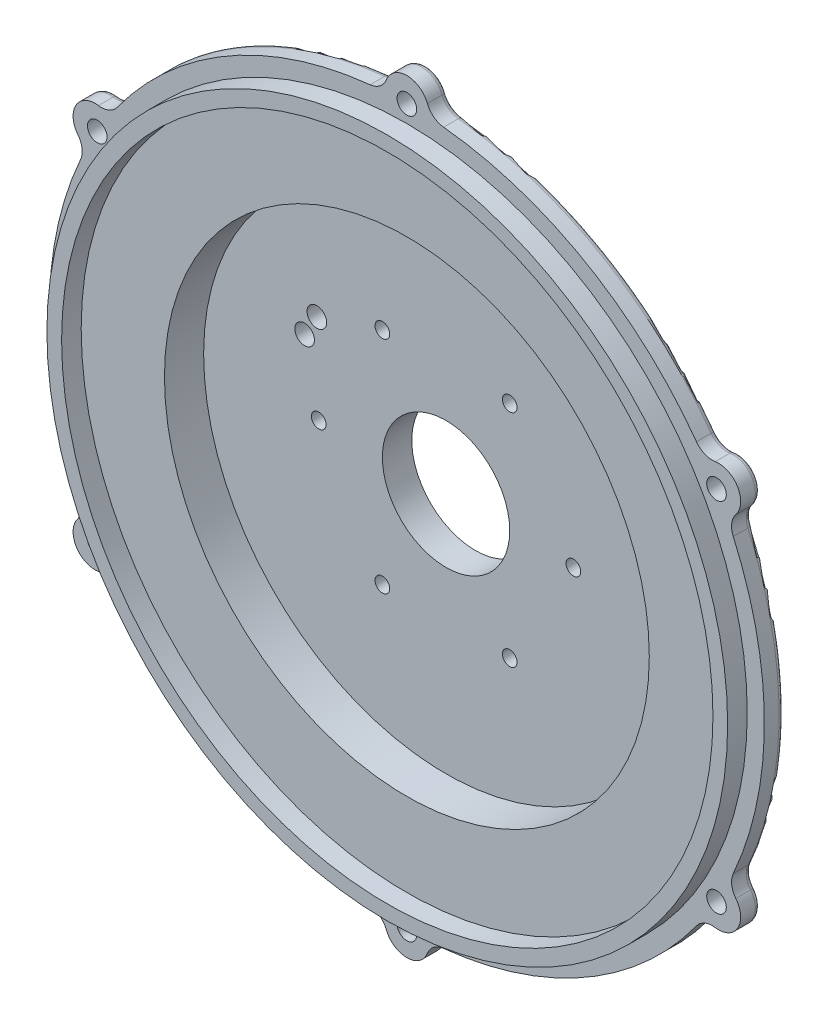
ISO-10303-21;
HEADER;
FILE_DESCRIPTION(('STEP AP214'),'2;1');
FILE_NAME('part.step','',(''),(''),'','','');
FILE_SCHEMA(('AUTOMOTIVE_DESIGN { 1 0 10303 214 1 1 1 1 }'));
ENDSEC;
DATA;
#1=APPLICATION_CONTEXT('core data for automotive mechanical design processes');
#2=APPLICATION_PROTOCOL_DEFINITION('international standard','automotive_design',2000,#1);
#3=PRODUCT_CONTEXT('',#1,'mechanical');
#4=PRODUCT('Part','Part','',(#3));
#5=PRODUCT_RELATED_PRODUCT_CATEGORY('part','',(#4));
#6=PRODUCT_DEFINITION_FORMATION('','',#4);
#7=PRODUCT_DEFINITION_CONTEXT('part definition',#1,'design');
#8=PRODUCT_DEFINITION('design','',#6,#7);
#9=PRODUCT_DEFINITION_SHAPE('','',#8);
#10=(LENGTH_UNIT() NAMED_UNIT(*) SI_UNIT(.MILLI.,.METRE.));
#11=(NAMED_UNIT(*) PLANE_ANGLE_UNIT() SI_UNIT($,.RADIAN.));
#12=(NAMED_UNIT(*) SI_UNIT($,.STERADIAN.) SOLID_ANGLE_UNIT());
#13=UNCERTAINTY_MEASURE_WITH_UNIT(LENGTH_MEASURE(1.E-05),#10,'distance_accuracy_value','');
#14=(GEOMETRIC_REPRESENTATION_CONTEXT(3) GLOBAL_UNCERTAINTY_ASSIGNED_CONTEXT((#13)) GLOBAL_UNIT_ASSIGNED_CONTEXT((#10,
#11,#12)) REPRESENTATION_CONTEXT('',''));
#15=CARTESIAN_POINT('',(0.,0.,0.));
#16=DIRECTION('',(0.,0.,1.));
#17=DIRECTION('',(1.,0.,0.));
#18=AXIS2_PLACEMENT_3D('',#15,#16,#17);
#19=CARTESIAN_POINT('',(0.,51.8720636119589,-3.));
#20=DIRECTION('',(0.,0.,1.));
#21=DIRECTION('',(1.,0.,0.));
#22=AXIS2_PLACEMENT_3D('',#19,#20,#21);
#23=PLANE('',#22);
#24=CARTESIAN_POINT('',(-28.8781106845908,13.7860336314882,-3.));
#25=DIRECTION('',(0.,0.,1.));
#26=DIRECTION('',(1.,0.,0.));
#27=AXIS2_PLACEMENT_3D('',#24,#25,#26);
#28=CIRCLE('',#27,2.);
#29=CARTESIAN_POINT('',(-26.8781106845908,13.7860336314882,-3.));
#30=VERTEX_POINT('',#29);
#31=EDGE_CURVE('E1292',#30,#30,#28,.T.);
#32=ORIENTED_EDGE('',*,*,#31,.T.);
#33=EDGE_LOOP('',(#32));
#34=FACE_BOUND('',#33,.T.);
#35=CARTESIAN_POINT('',(-26.3781106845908,18.1161606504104,-3.));
#36=DIRECTION('',(0.,0.,1.));
#37=DIRECTION('',(1.,0.,0.));
#38=AXIS2_PLACEMENT_3D('',#35,#36,#37);
#39=CIRCLE('',#38,2.);
#40=CARTESIAN_POINT('',(-24.3781106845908,18.1161606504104,-3.));
#41=VERTEX_POINT('',#40);
#42=EDGE_CURVE('E1286',#41,#41,#39,.T.);
#43=ORIENTED_EDGE('',*,*,#42,.T.);
#44=EDGE_LOOP('',(#43));
#45=FACE_BOUND('',#44,.T.);
#46=CARTESIAN_POINT('',(26.,0.,-3.));
#47=DIRECTION('',(0.,0.,1.));
#48=DIRECTION('',(1.,0.,0.));
#49=AXIS2_PLACEMENT_3D('',#46,#47,#48);
#50=CIRCLE('',#49,5.5);
#51=CARTESIAN_POINT('',(21.7259615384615,-3.4615885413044,-3.));
#52=VERTEX_POINT('',#51);
#53=CARTESIAN_POINT('',(21.7259615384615,3.4615885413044,-3.));
#54=VERTEX_POINT('',#53);
#55=EDGE_CURVE('E1048',#52,#54,#50,.T.);
#56=ORIENTED_EDGE('',*,*,#55,.T.);
#57=CARTESIAN_POINT('',(0.,0.,-3.));
#58=DIRECTION('',(0.,0.,1.));
#59=DIRECTION('',(1.,0.,0.));
#60=AXIS2_PLACEMENT_3D('',#57,#58,#59);
#61=CIRCLE('',#60,22.);
#62=CARTESIAN_POINT('',(13.8608043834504,17.0844403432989,-2.99999999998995));
#63=VERTEX_POINT('',#62);
#64=EDGE_CURVE('E1224',#54,#63,#61,.T.);
#65=ORIENTED_EDGE('',*,*,#64,.T.);
#66=CARTESIAN_POINT('',(12.9999999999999,22.5166604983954,-3.));
#67=DIRECTION('',(0.,0.,1.));
#68=DIRECTION('',(1.,0.,0.));
#69=AXIS2_PLACEMENT_3D('',#66,#67,#68);
#70=CIRCLE('',#69,5.5);
#71=CARTESIAN_POINT('',(7.86515715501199,20.5460288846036,-3.));
#72=VERTEX_POINT('',#71);
#73=EDGE_CURVE('E1054',#63,#72,#70,.T.);
#74=ORIENTED_EDGE('',*,*,#73,.T.);
#75=CARTESIAN_POINT('',(-7.86515715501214,20.5460288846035,-3.));
#76=VERTEX_POINT('',#75);
#77=EDGE_CURVE('E1901',#72,#76,#61,.T.);
#78=ORIENTED_EDGE('',*,*,#77,.T.);
#79=CARTESIAN_POINT('',(-13.0000000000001,22.5166604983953,-3.));
#80=DIRECTION('',(0.,0.,1.));
#81=DIRECTION('',(1.,0.,0.));
#82=AXIS2_PLACEMENT_3D('',#79,#80,#81);
#83=CIRCLE('',#82,5.5);
#84=CARTESIAN_POINT('',(-13.8608043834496,17.0844403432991,-3.));
#85=VERTEX_POINT('',#84);
#86=EDGE_CURVE('E1060',#76,#85,#83,.T.);
#87=ORIENTED_EDGE('',*,*,#86,.T.);
#88=CARTESIAN_POINT('',(-21.7259615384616,3.46158854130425,-3.));
#89=VERTEX_POINT('',#88);
#90=EDGE_CURVE('E719',#85,#89,#61,.T.);
#91=ORIENTED_EDGE('',*,*,#90,.T.);
#92=CARTESIAN_POINT('',(-26.,-1.81557134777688E-13,-3.));
#93=DIRECTION('',(0.,0.,1.));
#94=DIRECTION('',(1.,0.,0.));
#95=AXIS2_PLACEMENT_3D('',#92,#93,#94);
#96=CIRCLE('',#95,5.5);
#97=CARTESIAN_POINT('',(-21.7259615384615,-3.46158854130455,-3.));
#98=VERTEX_POINT('',#97);
#99=EDGE_CURVE('E1064',#89,#98,#96,.T.);
#100=ORIENTED_EDGE('',*,*,#99,.T.);
#101=CARTESIAN_POINT('',(-13.8608043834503,-17.084440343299,-2.99999999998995));
#102=VERTEX_POINT('',#101);
#103=EDGE_CURVE('E1888',#98,#102,#61,.T.);
#104=ORIENTED_EDGE('',*,*,#103,.T.);
#105=CARTESIAN_POINT('',(-12.9999999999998,-22.5166604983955,-3.));
#106=DIRECTION('',(0.,0.,1.));
#107=DIRECTION('',(1.,0.,0.));
#108=AXIS2_PLACEMENT_3D('',#105,#106,#107);
#109=CIRCLE('',#108,5.5);
#110=CARTESIAN_POINT('',(-7.86515715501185,-20.5460288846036,-3.));
#111=VERTEX_POINT('',#110);
#112=EDGE_CURVE('E1070',#102,#111,#109,.T.);
#113=ORIENTED_EDGE('',*,*,#112,.T.);
#114=CARTESIAN_POINT('',(7.86515715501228,-20.5460288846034,-3.));
#115=VERTEX_POINT('',#114);
#116=EDGE_CURVE('E1240',#111,#115,#61,.T.);
#117=ORIENTED_EDGE('',*,*,#116,.T.);
#118=CARTESIAN_POINT('',(13.0000000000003,-22.5166604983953,-3.));
#119=DIRECTION('',(0.,0.,1.));
#120=DIRECTION('',(1.,0.,0.));
#121=AXIS2_PLACEMENT_3D('',#118,#119,#120);
#122=CIRCLE('',#121,5.5);
#123=CARTESIAN_POINT('',(13.8608043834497,-17.084440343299,-2.99999999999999));
#124=VERTEX_POINT('',#123);
#125=EDGE_CURVE('E1076',#115,#124,#122,.T.);
#126=ORIENTED_EDGE('',*,*,#125,.T.);
#127=EDGE_CURVE('E1244',#124,#52,#61,.T.);
#128=ORIENTED_EDGE('',*,*,#127,.T.);
#129=EDGE_LOOP('',(#56,#65,#74,#78,#87,#91,#100,#104,#113,#117,#126,#128));
#130=FACE_BOUND('',#129,.T.);
#131=CARTESIAN_POINT('',(0.,0.,-3.));
#132=DIRECTION('',(0.,0.,1.));
#133=DIRECTION('',(1.,0.,0.));
#134=AXIS2_PLACEMENT_3D('',#131,#132,#133);
#135=CIRCLE('',#134,50.3720636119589);
#136=CARTESIAN_POINT('',(50.3720636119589,0.,-3.));
#137=VERTEX_POINT('',#136);
#138=EDGE_CURVE('E859',#137,#137,#135,.F.);
#139=ORIENTED_EDGE('',*,*,#138,.T.);
#140=EDGE_LOOP('',(#139));
#141=FACE_BOUND('',#140,.T.);
#142=ADVANCED_FACE('F353',(#34,#45,#130,#141),#23,.F.);
#143=CARTESIAN_POINT('',(0.,0.,5.8790762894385));
#144=DIRECTION('',(0.,0.,1.));
#145=DIRECTION('',(1.,0.,0.));
#146=AXIS2_PLACEMENT_3D('',#143,#144,#145);
#147=CYLINDRICAL_SURFACE('',#146,73.);
#148=DIRECTION('',(0.,0.,1.));
#149=VECTOR('',#148,1.);
#150=CARTESIAN_POINT('',(-66.6379498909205,29.8057651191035,5.8790762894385));
#151=LINE('',#150,#149);
#152=CARTESIAN_POINT('',(-66.6379498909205,29.8057651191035,8.00000000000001));
#153=VERTEX_POINT('',#152);
#154=CARTESIAN_POINT('',(-66.6379498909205,29.8057651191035,5.00000000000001));
#155=VERTEX_POINT('',#154);
#156=EDGE_CURVE('E941',#153,#155,#151,.F.);
#157=ORIENTED_EDGE('',*,*,#156,.T.);
#158=CARTESIAN_POINT('',(0.,0.,5.00000000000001));
#159=DIRECTION('',(0.,0.,1.));
#160=DIRECTION('',(1.,0.,0.));
#161=AXIS2_PLACEMENT_3D('',#158,#159,#160);
#162=CIRCLE('',#161,73.);
#163=CARTESIAN_POINT('',(-66.6379498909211,-29.8057651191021,5.00000000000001));
#164=VERTEX_POINT('',#163);
#165=EDGE_CURVE('E1038',#155,#164,#162,.T.);
#166=ORIENTED_EDGE('',*,*,#165,.T.);
#167=DIRECTION('',(0.,0.,1.));
#168=VECTOR('',#167,1.);
#169=CARTESIAN_POINT('',(-66.6379498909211,-29.8057651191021,5.8790762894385));
#170=LINE('',#169,#168);
#171=CARTESIAN_POINT('',(-66.6379498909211,-29.8057651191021,8.00000000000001));
#172=VERTEX_POINT('',#171);
#173=EDGE_CURVE('E921',#164,#172,#170,.T.);
#174=ORIENTED_EDGE('',*,*,#173,.T.);
#175=CARTESIAN_POINT('',(0.,0.,8.00000000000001));
#176=DIRECTION('',(0.,0.,1.));
#177=DIRECTION('',(1.,0.,0.));
#178=AXIS2_PLACEMENT_3D('',#175,#176,#177);
#179=CIRCLE('',#178,73.);
#180=EDGE_CURVE('E853',#153,#172,#179,.T.);
#181=ORIENTED_EDGE('',*,*,#180,.F.);
#182=EDGE_LOOP('',(#157,#166,#174,#181));
#183=FACE_BOUND('',#182,.T.);
#184=ADVANCED_FACE('F1370',(#183),#147,.T.);
#185=DIRECTION('',(0.,0.,1.));
#186=VECTOR('',#185,1.);
#187=CARTESIAN_POINT('',(-59.1315247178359,-42.8072749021,5.8790762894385));
#188=LINE('',#187,#186);
#189=CARTESIAN_POINT('',(-59.1315247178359,-42.8072749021,8.00000000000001));
#190=VERTEX_POINT('',#189);
#191=CARTESIAN_POINT('',(-59.1315247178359,-42.8072749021,5.00000000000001));
#192=VERTEX_POINT('',#191);
#193=EDGE_CURVE('E928',#190,#192,#188,.F.);
#194=ORIENTED_EDGE('',*,*,#193,.T.);
#195=CARTESIAN_POINT('',(0.,0.,5.00000000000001));
#196=DIRECTION('',(0.,0.,1.));
#197=DIRECTION('',(1.,0.,0.));
#198=AXIS2_PLACEMENT_3D('',#195,#196,#197);
#199=CIRCLE('',#198,73.);
#200=CARTESIAN_POINT('',(-7.50642517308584,-72.6130400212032,5.00000000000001));
#201=VERTEX_POINT('',#200);
#202=EDGE_CURVE('E1030',#192,#201,#199,.T.);
#203=ORIENTED_EDGE('',*,*,#202,.T.);
#204=DIRECTION('',(0.,0.,1.));
#205=VECTOR('',#204,1.);
#206=CARTESIAN_POINT('',(-7.50642517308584,-72.6130400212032,5.8790762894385));
#207=LINE('',#206,#205);
#208=CARTESIAN_POINT('',(-7.50642517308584,-72.6130400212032,8.00000000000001));
#209=VERTEX_POINT('',#208);
#210=EDGE_CURVE('E907',#201,#209,#207,.T.);
#211=ORIENTED_EDGE('',*,*,#210,.T.);
#212=EDGE_CURVE('E2320',#190,#209,#179,.T.);
#213=ORIENTED_EDGE('',*,*,#212,.F.);
#214=EDGE_LOOP('',(#194,#203,#211,#213));
#215=FACE_BOUND('',#214,.T.);
#216=ADVANCED_FACE('F1377',(#215),#147,.T.);
#217=DIRECTION('',(0.,0.,1.));
#218=VECTOR('',#217,1.);
#219=CARTESIAN_POINT('',(7.50642517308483,-72.6130400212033,5.8790762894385));
#220=LINE('',#219,#218);
#221=CARTESIAN_POINT('',(7.50642517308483,-72.6130400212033,8.00000000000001));
#222=VERTEX_POINT('',#221);
#223=CARTESIAN_POINT('',(7.50642517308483,-72.6130400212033,5.00000000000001));
#224=VERTEX_POINT('',#223);
#225=EDGE_CURVE('E914',#222,#224,#220,.F.);
#226=ORIENTED_EDGE('',*,*,#225,.T.);
#227=CARTESIAN_POINT('',(0.,0.,5.00000000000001));
#228=DIRECTION('',(0.,0.,1.));
#229=DIRECTION('',(1.,0.,0.));
#230=AXIS2_PLACEMENT_3D('',#227,#228,#229);
#231=CIRCLE('',#230,73.);
#232=CARTESIAN_POINT('',(59.1315247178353,-42.8072749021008,5.00000000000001));
#233=VERTEX_POINT('',#232);
#234=EDGE_CURVE('E1022',#224,#233,#231,.T.);
#235=ORIENTED_EDGE('',*,*,#234,.T.);
#236=DIRECTION('',(0.,0.,1.));
#237=VECTOR('',#236,1.);
#238=CARTESIAN_POINT('',(59.1315247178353,-42.8072749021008,5.8790762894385));
#239=LINE('',#238,#237);
#240=CARTESIAN_POINT('',(59.1315247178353,-42.8072749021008,8.00000000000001));
#241=VERTEX_POINT('',#240);
#242=EDGE_CURVE('E893',#233,#241,#239,.T.);
#243=ORIENTED_EDGE('',*,*,#242,.T.);
#244=EDGE_CURVE('E1558',#222,#241,#179,.T.);
#245=ORIENTED_EDGE('',*,*,#244,.F.);
#246=EDGE_LOOP('',(#226,#235,#243,#245));
#247=FACE_BOUND('',#246,.T.);
#248=ADVANCED_FACE('F1402',(#247),#147,.T.);
#249=DIRECTION('',(0.,0.,1.));
#250=VECTOR('',#249,1.);
#251=CARTESIAN_POINT('',(66.6379498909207,-29.8057651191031,5.8790762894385));
#252=LINE('',#251,#250);
#253=CARTESIAN_POINT('',(66.6379498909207,-29.8057651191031,8.00000000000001));
#254=VERTEX_POINT('',#253);
#255=CARTESIAN_POINT('',(66.6379498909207,-29.8057651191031,5.00000000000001));
#256=VERTEX_POINT('',#255);
#257=EDGE_CURVE('E900',#254,#256,#252,.F.);
#258=ORIENTED_EDGE('',*,*,#257,.T.);
#259=CARTESIAN_POINT('',(0.,0.,5.00000000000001));
#260=DIRECTION('',(0.,0.,1.));
#261=DIRECTION('',(1.,0.,0.));
#262=AXIS2_PLACEMENT_3D('',#259,#260,#261);
#263=CIRCLE('',#262,73.);
#264=CARTESIAN_POINT('',(66.6379498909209,29.8057651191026,5.00000000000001));
#265=VERTEX_POINT('',#264);
#266=EDGE_CURVE('E1014',#256,#265,#263,.T.);
#267=ORIENTED_EDGE('',*,*,#266,.T.);
#268=DIRECTION('',(0.,0.,1.));
#269=VECTOR('',#268,1.);
#270=CARTESIAN_POINT('',(66.6379498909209,29.8057651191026,5.8790762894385));
#271=LINE('',#270,#269);
#272=CARTESIAN_POINT('',(66.6379498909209,29.8057651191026,8.00000000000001));
#273=VERTEX_POINT('',#272);
#274=EDGE_CURVE('E879',#265,#273,#271,.T.);
#275=ORIENTED_EDGE('',*,*,#274,.T.);
#276=EDGE_CURVE('E1590',#254,#273,#179,.T.);
#277=ORIENTED_EDGE('',*,*,#276,.F.);
#278=EDGE_LOOP('',(#258,#267,#275,#277));
#279=FACE_BOUND('',#278,.T.);
#280=ADVANCED_FACE('F1396',(#279),#147,.T.);
#281=DIRECTION('',(0.,0.,1.));
#282=VECTOR('',#281,1.);
#283=CARTESIAN_POINT('',(59.1315247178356,42.8072749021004,5.8790762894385));
#284=LINE('',#283,#282);
#285=CARTESIAN_POINT('',(59.1315247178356,42.8072749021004,8.00000000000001));
#286=VERTEX_POINT('',#285);
#287=CARTESIAN_POINT('',(59.1315247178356,42.8072749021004,5.00000000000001));
#288=VERTEX_POINT('',#287);
#289=EDGE_CURVE('E886',#286,#288,#284,.F.);
#290=ORIENTED_EDGE('',*,*,#289,.T.);
#291=CARTESIAN_POINT('',(0.,0.,5.00000000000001));
#292=DIRECTION('',(0.,0.,1.));
#293=DIRECTION('',(1.,0.,0.));
#294=AXIS2_PLACEMENT_3D('',#291,#292,#293);
#295=CIRCLE('',#294,73.);
#296=CARTESIAN_POINT('',(7.50642517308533,72.6130400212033,5.00000000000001));
#297=VERTEX_POINT('',#296);
#298=EDGE_CURVE('E1006',#288,#297,#295,.T.);
#299=ORIENTED_EDGE('',*,*,#298,.T.);
#300=DIRECTION('',(0.,0.,1.));
#301=VECTOR('',#300,1.);
#302=CARTESIAN_POINT('',(7.50642517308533,72.6130400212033,5.8790762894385));
#303=LINE('',#302,#301);
#304=CARTESIAN_POINT('',(7.50642517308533,72.6130400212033,8.00000000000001));
#305=VERTEX_POINT('',#304);
#306=EDGE_CURVE('E868',#297,#305,#303,.T.);
#307=ORIENTED_EDGE('',*,*,#306,.T.);
#308=EDGE_CURVE('E848',#286,#305,#179,.T.);
#309=ORIENTED_EDGE('',*,*,#308,.F.);
#310=EDGE_LOOP('',(#290,#299,#307,#309));
#311=FACE_BOUND('',#310,.T.);
#312=ADVANCED_FACE('F1391',(#311),#147,.T.);
#313=CARTESIAN_POINT('',(0.,49.5,0.));
#314=DIRECTION('',(0.,0.,-1.));
#315=DIRECTION('',(-1.,0.,0.));
#316=AXIS2_PLACEMENT_3D('',#313,#314,#315);
#317=PLANE('',#316);
#318=CARTESIAN_POINT('',(-28.8781106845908,13.7860336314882,0.));
#319=DIRECTION('',(0.,0.,1.));
#320=DIRECTION('',(1.,0.,0.));
#321=AXIS2_PLACEMENT_3D('',#318,#319,#320);
#322=CIRCLE('',#321,2.);
#323=CARTESIAN_POINT('',(-26.8781106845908,13.7860336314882,0.));
#324=VERTEX_POINT('',#323);
#325=EDGE_CURVE('E1295',#324,#324,#322,.T.);
#326=ORIENTED_EDGE('',*,*,#325,.F.);
#327=EDGE_LOOP('',(#326));
#328=FACE_BOUND('',#327,.T.);
#329=CARTESIAN_POINT('',(-26.3781106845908,18.1161606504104,0.));
#330=DIRECTION('',(0.,0.,1.));
#331=DIRECTION('',(1.,0.,0.));
#332=AXIS2_PLACEMENT_3D('',#329,#330,#331);
#333=CIRCLE('',#332,2.);
#334=CARTESIAN_POINT('',(-24.3781106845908,18.1161606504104,0.));
#335=VERTEX_POINT('',#334);
#336=EDGE_CURVE('E1289',#335,#335,#333,.T.);
#337=ORIENTED_EDGE('',*,*,#336,.F.);
#338=EDGE_LOOP('',(#337));
#339=FACE_BOUND('',#338,.T.);
#340=CARTESIAN_POINT('',(0.,0.,0.));
#341=DIRECTION('',(0.,0.,1.));
#342=DIRECTION('',(1.,0.,0.));
#343=AXIS2_PLACEMENT_3D('',#340,#341,#342);
#344=CIRCLE('',#343,13.);
#345=CARTESIAN_POINT('',(13.,0.,0.));
#346=VERTEX_POINT('',#345);
#347=EDGE_CURVE('E1283',#346,#346,#344,.T.);
#348=ORIENTED_EDGE('',*,*,#347,.F.);
#349=EDGE_LOOP('',(#348));
#350=FACE_BOUND('',#349,.T.);
#351=CARTESIAN_POINT('',(-12.9999999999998,22.5166604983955,0.));
#352=DIRECTION('',(0.,0.,-1.));
#353=DIRECTION('',(-1.,0.,0.));
#354=AXIS2_PLACEMENT_3D('',#351,#352,#353);
#355=CIRCLE('',#354,1.5);
#356=CARTESIAN_POINT('',(-14.4999999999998,22.5166604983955,0.));
#357=VERTEX_POINT('',#356);
#358=EDGE_CURVE('E1274',#357,#357,#355,.T.);
#359=ORIENTED_EDGE('',*,*,#358,.T.);
#360=EDGE_LOOP('',(#359));
#361=FACE_BOUND('',#360,.T.);
#362=CARTESIAN_POINT('',(-26.,1.80411241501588E-13,0.));
#363=DIRECTION('',(0.,0.,-1.));
#364=DIRECTION('',(-1.,0.,0.));
#365=AXIS2_PLACEMENT_3D('',#362,#363,#364);
#366=CIRCLE('',#365,1.5);
#367=CARTESIAN_POINT('',(-27.5,1.80411241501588E-13,0.));
#368=VERTEX_POINT('',#367);
#369=EDGE_CURVE('E1268',#368,#368,#366,.T.);
#370=ORIENTED_EDGE('',*,*,#369,.T.);
#371=EDGE_LOOP('',(#370));
#372=FACE_BOUND('',#371,.T.);
#373=CARTESIAN_POINT('',(-13.0000000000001,-22.5166604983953,0.));
#374=DIRECTION('',(0.,0.,-1.));
#375=DIRECTION('',(-1.,0.,0.));
#376=AXIS2_PLACEMENT_3D('',#373,#374,#375);
#377=CIRCLE('',#376,1.5);
#378=CARTESIAN_POINT('',(-14.5000000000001,-22.5166604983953,0.));
#379=VERTEX_POINT('',#378);
#380=EDGE_CURVE('E1262',#379,#379,#377,.T.);
#381=ORIENTED_EDGE('',*,*,#380,.T.);
#382=EDGE_LOOP('',(#381));
#383=FACE_BOUND('',#382,.T.);
#384=CARTESIAN_POINT('',(12.9999999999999,-22.5166604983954,0.));
#385=DIRECTION('',(0.,0.,-1.));
#386=DIRECTION('',(-1.,0.,0.));
#387=AXIS2_PLACEMENT_3D('',#384,#385,#386);
#388=CIRCLE('',#387,1.5);
#389=CARTESIAN_POINT('',(11.5,-22.5166604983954,0.));
#390=VERTEX_POINT('',#389);
#391=EDGE_CURVE('E1256',#390,#390,#388,.T.);
#392=ORIENTED_EDGE('',*,*,#391,.T.);
#393=EDGE_LOOP('',(#392));
#394=FACE_BOUND('',#393,.T.);
#395=CARTESIAN_POINT('',(26.,0.,0.));
#396=DIRECTION('',(0.,0.,-1.));
#397=DIRECTION('',(-1.,0.,0.));
#398=AXIS2_PLACEMENT_3D('',#395,#396,#397);
#399=CIRCLE('',#398,1.5);
#400=CARTESIAN_POINT('',(24.5,0.,0.));
#401=VERTEX_POINT('',#400);
#402=EDGE_CURVE('E1250',#401,#401,#399,.T.);
#403=ORIENTED_EDGE('',*,*,#402,.T.);
#404=EDGE_LOOP('',(#403));
#405=FACE_BOUND('',#404,.T.);
#406=CARTESIAN_POINT('',(12.9999999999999,22.5166604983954,0.));
#407=DIRECTION('',(0.,0.,-1.));
#408=DIRECTION('',(-1.,0.,0.));
#409=AXIS2_PLACEMENT_3D('',#406,#407,#408);
#410=CIRCLE('',#409,1.5);
#411=CARTESIAN_POINT('',(11.4999999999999,22.5166604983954,0.));
#412=VERTEX_POINT('',#411);
#413=EDGE_CURVE('E1230',#412,#412,#410,.T.);
#414=ORIENTED_EDGE('',*,*,#413,.T.);
#415=EDGE_LOOP('',(#414));
#416=FACE_BOUND('',#415,.T.);
#417=CARTESIAN_POINT('',(0.,0.,0.));
#418=DIRECTION('',(0.,0.,1.));
#419=DIRECTION('',(1.,0.,0.));
#420=AXIS2_PLACEMENT_3D('',#417,#418,#419);
#421=CIRCLE('',#420,49.5);
#422=CARTESIAN_POINT('',(49.5,0.,0.));
#423=VERTEX_POINT('',#422);
#424=EDGE_CURVE('E830',#423,#423,#421,.T.);
#425=ORIENTED_EDGE('',*,*,#424,.T.);
#426=EDGE_LOOP('',(#425));
#427=FACE_BOUND('',#426,.T.);
#428=ADVANCED_FACE('F355',(#328,#339,#350,#361,#372,#383,#394,#405,#416,#427),#317,.F.);
#429=CARTESIAN_POINT('',(0.,0.,5.8790762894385));
#430=DIRECTION('',(0.,0.,1.));
#431=DIRECTION('',(1.,0.,0.));
#432=AXIS2_PLACEMENT_3D('',#429,#430,#431);
#433=CYLINDRICAL_SURFACE('',#432,51.8720636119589);
#434=CARTESIAN_POINT('',(0.,0.,-1.5));
#435=DIRECTION('',(0.,0.,1.));
#436=DIRECTION('',(1.,0.,0.));
#437=AXIS2_PLACEMENT_3D('',#434,#435,#436);
#438=CIRCLE('',#437,51.8720636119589);
#439=CARTESIAN_POINT('',(51.8720636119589,0.,-1.5));
#440=VERTEX_POINT('',#439);
#441=EDGE_CURVE('E856',#440,#440,#438,.T.);
#442=ORIENTED_EDGE('',*,*,#441,.T.);
#443=EDGE_LOOP('',(#442));
#444=FACE_BOUND('',#443,.T.);
#445=CARTESIAN_POINT('',(0.,0.,2.50000000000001));
#446=DIRECTION('',(0.,0.,1.));
#447=DIRECTION('',(1.,0.,0.));
#448=AXIS2_PLACEMENT_3D('',#445,#446,#447);
#449=CIRCLE('',#448,51.8720636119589);
#450=CARTESIAN_POINT('',(51.8720636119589,0.,2.50000000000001));
#451=VERTEX_POINT('',#450);
#452=EDGE_CURVE('E852',#451,#451,#449,.F.);
#453=ORIENTED_EDGE('',*,*,#452,.T.);
#454=EDGE_LOOP('',(#453));
#455=FACE_BOUND('',#454,.T.);
#456=ADVANCED_FACE('F1382',(#444,#455),#433,.T.);
#457=CARTESIAN_POINT('',(0.,73.,4.00000000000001));
#458=DIRECTION('',(0.,0.,1.));
#459=DIRECTION('',(1.,0.,0.));
#460=AXIS2_PLACEMENT_3D('',#457,#458,#459);
#461=PLANE('',#460);
#462=CARTESIAN_POINT('',(-63.2198544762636,36.5000000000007,4.00000000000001));
#463=DIRECTION('',(0.,0.,1.));
#464=DIRECTION('',(1.,0.,0.));
#465=AXIS2_PLACEMENT_3D('',#462,#463,#464);
#466=CIRCLE('',#465,2.);
#467=CARTESIAN_POINT('',(-61.2198544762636,36.5000000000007,4.00000000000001));
#468=VERTEX_POINT('',#467);
#469=EDGE_CURVE('E1328',#468,#468,#466,.T.);
#470=ORIENTED_EDGE('',*,*,#469,.T.);
#471=EDGE_LOOP('',(#470));
#472=FACE_BOUND('',#471,.T.);
#473=CARTESIAN_POINT('',(-63.2198544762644,-36.4999999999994,4.00000000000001));
#474=DIRECTION('',(0.,0.,1.));
#475=DIRECTION('',(1.,0.,0.));
#476=AXIS2_PLACEMENT_3D('',#473,#474,#475);
#477=CIRCLE('',#476,2.);
#478=CARTESIAN_POINT('',(-61.2198544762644,-36.4999999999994,4.00000000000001));
#479=VERTEX_POINT('',#478);
#480=EDGE_CURVE('E1322',#479,#479,#477,.T.);
#481=ORIENTED_EDGE('',*,*,#480,.T.);
#482=EDGE_LOOP('',(#481));
#483=FACE_BOUND('',#482,.T.);
#484=CARTESIAN_POINT('',(-5.0975657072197E-13,-73.,4.00000000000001));
#485=DIRECTION('',(0.,0.,1.));
#486=DIRECTION('',(1.,0.,0.));
#487=AXIS2_PLACEMENT_3D('',#484,#485,#486);
#488=CIRCLE('',#487,2.);
#489=CARTESIAN_POINT('',(1.99999999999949,-73.,4.00000000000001));
#490=VERTEX_POINT('',#489);
#491=EDGE_CURVE('E1316',#490,#490,#488,.T.);
#492=ORIENTED_EDGE('',*,*,#491,.T.);
#493=EDGE_LOOP('',(#492));
#494=FACE_BOUND('',#493,.T.);
#495=CARTESIAN_POINT('',(63.2198544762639,-36.5000000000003,4.00000000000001));
#496=DIRECTION('',(0.,0.,1.));
#497=DIRECTION('',(1.,0.,0.));
#498=AXIS2_PLACEMENT_3D('',#495,#496,#497);
#499=CIRCLE('',#498,2.);
#500=CARTESIAN_POINT('',(65.2198544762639,-36.5000000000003,4.00000000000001));
#501=VERTEX_POINT('',#500);
#502=EDGE_CURVE('E1310',#501,#501,#499,.T.);
#503=ORIENTED_EDGE('',*,*,#502,.T.);
#504=EDGE_LOOP('',(#503));
#505=FACE_BOUND('',#504,.T.);
#506=CARTESIAN_POINT('',(63.2198544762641,36.4999999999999,4.00000000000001));
#507=DIRECTION('',(0.,0.,1.));
#508=DIRECTION('',(1.,0.,0.));
#509=AXIS2_PLACEMENT_3D('',#506,#507,#508);
#510=CIRCLE('',#509,2.);
#511=CARTESIAN_POINT('',(65.2198544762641,36.4999999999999,4.00000000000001));
#512=VERTEX_POINT('',#511);
#513=EDGE_CURVE('E1304',#512,#512,#510,.T.);
#514=ORIENTED_EDGE('',*,*,#513,.T.);
#515=EDGE_LOOP('',(#514));
#516=FACE_BOUND('',#515,.T.);
#517=CARTESIAN_POINT('',(0.,73.,4.00000000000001));
#518=DIRECTION('',(0.,0.,1.));
#519=DIRECTION('',(1.,0.,0.));
#520=AXIS2_PLACEMENT_3D('',#517,#518,#519);
#521=CIRCLE('',#520,2.);
#522=CARTESIAN_POINT('',(2.,73.,4.00000000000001));
#523=VERTEX_POINT('',#522);
#524=EDGE_CURVE('E1298',#523,#523,#521,.T.);
#525=ORIENTED_EDGE('',*,*,#524,.T.);
#526=EDGE_LOOP('',(#525));
#527=FACE_BOUND('',#526,.T.);
#528=CARTESIAN_POINT('',(-62.3716082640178,45.152879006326,4.00000000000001));
#529=DIRECTION('',(0.,0.,1.));
#530=DIRECTION('',(1.,0.,0.));
#531=AXIS2_PLACEMENT_3D('',#528,#529,#530);
#532=CIRCLE('',#531,5.);
#533=CARTESIAN_POINT('',(-63.1252899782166,40.2100090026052,4.00000000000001));
#534=VERTEX_POINT('',#533);
#535=CARTESIAN_POINT('',(-58.3215038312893,42.2208738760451,4.00000000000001));
#536=VERTEX_POINT('',#535);
#537=EDGE_CURVE('E951',#534,#536,#532,.T.);
#538=ORIENTED_EDGE('',*,*,#537,.T.);
#539=CARTESIAN_POINT('',(0.,0.,4.00000000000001));
#540=DIRECTION('',(0.,0.,1.));
#541=DIRECTION('',(1.,0.,0.));
#542=AXIS2_PLACEMENT_3D('',#539,#540,#541);
#543=CIRCLE('',#542,72.);
#544=CARTESIAN_POINT('',(-7.40359743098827,71.6183408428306,4.00000000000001));
#545=VERTEX_POINT('',#544);
#546=EDGE_CURVE('E997',#536,#545,#543,.F.);
#547=ORIENTED_EDGE('',*,*,#546,.T.);
#548=CARTESIAN_POINT('',(-7.91773614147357,76.5918367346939,4.00000000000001));
#549=DIRECTION('',(0.,0.,1.));
#550=DIRECTION('',(1.,0.,0.));
#551=AXIS2_PLACEMENT_3D('',#548,#549,#550);
#552=CIRCLE('',#551,5.);
#553=CARTESIAN_POINT('',(-3.26024429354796,74.7731092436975,4.00000000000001));
#554=VERTEX_POINT('',#553);
#555=EDGE_CURVE('E995',#545,#554,#552,.T.);
#556=ORIENTED_EDGE('',*,*,#555,.T.);
#557=CARTESIAN_POINT('',(0.,73.5,4.00000000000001));
#558=DIRECTION('',(0.,0.,1.));
#559=DIRECTION('',(1.,0.,0.));
#560=AXIS2_PLACEMENT_3D('',#557,#558,#559);
#561=CIRCLE('',#560,3.5);
#562=CARTESIAN_POINT('',(3.26024429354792,74.7731092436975,4.00000000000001));
#563=VERTEX_POINT('',#562);
#564=EDGE_CURVE('E993',#554,#563,#561,.F.);
#565=ORIENTED_EDGE('',*,*,#564,.T.);
#566=CARTESIAN_POINT('',(7.91773614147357,76.5918367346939,4.00000000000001));
#567=DIRECTION('',(0.,0.,1.));
#568=DIRECTION('',(1.,0.,0.));
#569=AXIS2_PLACEMENT_3D('',#566,#567,#568);
#570=CIRCLE('',#569,5.);
#571=CARTESIAN_POINT('',(7.40359743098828,71.6183408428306,4.00000000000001));
#572=VERTEX_POINT('',#571);
#573=EDGE_CURVE('E991',#563,#572,#570,.T.);
#574=ORIENTED_EDGE('',*,*,#573,.T.);
#575=CARTESIAN_POINT('',(0.,0.,4.00000000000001));
#576=DIRECTION('',(0.,0.,1.));
#577=DIRECTION('',(1.,0.,0.));
#578=AXIS2_PLACEMENT_3D('',#575,#576,#577);
#579=CIRCLE('',#578,72.);
#580=CARTESIAN_POINT('',(58.3215038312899,42.2208738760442,4.00000000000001));
#581=VERTEX_POINT('',#580);
#582=EDGE_CURVE('E989',#572,#581,#579,.F.);
#583=ORIENTED_EDGE('',*,*,#582,.T.);
#584=CARTESIAN_POINT('',(62.3716082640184,45.1528790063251,4.00000000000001));
#585=DIRECTION('',(0.,0.,1.));
#586=DIRECTION('',(1.,0.,0.));
#587=AXIS2_PLACEMENT_3D('',#584,#585,#586);
#588=CIRCLE('',#587,5.);
#589=CARTESIAN_POINT('',(63.1252899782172,40.2100090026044,4.00000000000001));
#590=VERTEX_POINT('',#589);
#591=EDGE_CURVE('E987',#581,#590,#588,.T.);
#592=ORIENTED_EDGE('',*,*,#591,.T.);
#593=CARTESIAN_POINT('',(63.6528671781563,36.7499999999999,4.00000000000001));
#594=DIRECTION('',(0.,0.,1.));
#595=DIRECTION('',(1.,0.,0.));
#596=AXIS2_PLACEMENT_3D('',#593,#594,#595);
#597=CIRCLE('',#596,3.5);
#598=CARTESIAN_POINT('',(66.3855342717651,34.5631002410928,4.00000000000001));
#599=VERTEX_POINT('',#598);
#600=EDGE_CURVE('E985',#590,#599,#597,.F.);
#601=ORIENTED_EDGE('',*,*,#600,.T.);
#602=CARTESIAN_POINT('',(70.2893444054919,31.4389577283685,4.00000000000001));
#603=DIRECTION('',(0.,0.,1.));
#604=DIRECTION('',(1.,0.,0.));
#605=AXIS2_PLACEMENT_3D('',#602,#603,#604);
#606=CIRCLE('',#605,5.);
#607=CARTESIAN_POINT('',(65.7251012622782,29.3974669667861,4.00000000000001));
#608=VERTEX_POINT('',#607);
#609=EDGE_CURVE('E983',#599,#608,#606,.T.);
#610=ORIENTED_EDGE('',*,*,#609,.T.);
#611=CARTESIAN_POINT('',(0.,0.,4.00000000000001));
#612=DIRECTION('',(0.,0.,1.));
#613=DIRECTION('',(1.,0.,0.));
#614=AXIS2_PLACEMENT_3D('',#611,#612,#613);
#615=CIRCLE('',#614,72.);
#616=CARTESIAN_POINT('',(65.725101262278,-29.3974669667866,4.00000000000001));
#617=VERTEX_POINT('',#616);
#618=EDGE_CURVE('E981',#608,#617,#615,.F.);
#619=ORIENTED_EDGE('',*,*,#618,.T.);
#620=CARTESIAN_POINT('',(70.2893444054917,-31.438957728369,4.00000000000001));
#621=DIRECTION('',(0.,0.,1.));
#622=DIRECTION('',(1.,0.,0.));
#623=AXIS2_PLACEMENT_3D('',#620,#621,#622);
#624=CIRCLE('',#623,5.);
#625=CARTESIAN_POINT('',(66.3855342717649,-34.5631002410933,4.00000000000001));
#626=VERTEX_POINT('',#625);
#627=EDGE_CURVE('E979',#617,#626,#624,.T.);
#628=ORIENTED_EDGE('',*,*,#627,.T.);
#629=CARTESIAN_POINT('',(63.6528671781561,-36.7500000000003,4.00000000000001));
#630=DIRECTION('',(0.,0.,1.));
#631=DIRECTION('',(1.,0.,0.));
#632=AXIS2_PLACEMENT_3D('',#629,#630,#631);
#633=CIRCLE('',#632,3.5);
#634=CARTESIAN_POINT('',(63.1252899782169,-40.2100090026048,4.00000000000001));
#635=VERTEX_POINT('',#634);
#636=EDGE_CURVE('E977',#626,#635,#633,.F.);
#637=ORIENTED_EDGE('',*,*,#636,.T.);
#638=CARTESIAN_POINT('',(62.3716082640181,-45.1528790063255,4.00000000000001));
#639=DIRECTION('',(0.,0.,1.));
#640=DIRECTION('',(1.,0.,0.));
#641=AXIS2_PLACEMENT_3D('',#638,#639,#640);
#642=CIRCLE('',#641,5.);
#643=CARTESIAN_POINT('',(58.3215038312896,-42.2208738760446,4.00000000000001));
#644=VERTEX_POINT('',#643);
#645=EDGE_CURVE('E975',#635,#644,#642,.T.);
#646=ORIENTED_EDGE('',*,*,#645,.T.);
#647=CARTESIAN_POINT('',(0.,0.,4.00000000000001));
#648=DIRECTION('',(0.,0.,1.));
#649=DIRECTION('',(1.,0.,0.));
#650=AXIS2_PLACEMENT_3D('',#647,#648,#649);
#651=CIRCLE('',#650,72.);
#652=CARTESIAN_POINT('',(7.40359743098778,-71.6183408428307,4.00000000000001));
#653=VERTEX_POINT('',#652);
#654=EDGE_CURVE('E973',#644,#653,#651,.F.);
#655=ORIENTED_EDGE('',*,*,#654,.T.);
#656=CARTESIAN_POINT('',(7.91773614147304,-76.5918367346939,4.00000000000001));
#657=DIRECTION('',(0.,0.,1.));
#658=DIRECTION('',(1.,0.,0.));
#659=AXIS2_PLACEMENT_3D('',#656,#657,#658);
#660=CIRCLE('',#659,5.);
#661=CARTESIAN_POINT('',(3.26024429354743,-74.7731092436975,4.00000000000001));
#662=VERTEX_POINT('',#661);
#663=EDGE_CURVE('E971',#653,#662,#660,.T.);
#664=ORIENTED_EDGE('',*,*,#663,.T.);
#665=CARTESIAN_POINT('',(-5.13248054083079E-13,-73.5,4.00000000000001));
#666=DIRECTION('',(0.,0.,1.));
#667=DIRECTION('',(1.,0.,0.));
#668=AXIS2_PLACEMENT_3D('',#665,#666,#667);
#669=CIRCLE('',#668,3.5);
#670=CARTESIAN_POINT('',(-3.26024429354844,-74.7731092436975,4.00000000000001));
#671=VERTEX_POINT('',#670);
#672=EDGE_CURVE('E969',#662,#671,#669,.F.);
#673=ORIENTED_EDGE('',*,*,#672,.T.);
#674=CARTESIAN_POINT('',(-7.91773614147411,-76.5918367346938,4.00000000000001));
#675=DIRECTION('',(0.,0.,1.));
#676=DIRECTION('',(1.,0.,0.));
#677=AXIS2_PLACEMENT_3D('',#674,#675,#676);
#678=CIRCLE('',#677,5.);
#679=CARTESIAN_POINT('',(-7.40359743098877,-71.6183408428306,4.00000000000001));
#680=VERTEX_POINT('',#679);
#681=EDGE_CURVE('E967',#671,#680,#678,.T.);
#682=ORIENTED_EDGE('',*,*,#681,.T.);
#683=CARTESIAN_POINT('',(0.,0.,4.00000000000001));
#684=DIRECTION('',(0.,0.,1.));
#685=DIRECTION('',(1.,0.,0.));
#686=AXIS2_PLACEMENT_3D('',#683,#684,#685);
#687=CIRCLE('',#686,72.);
#688=CARTESIAN_POINT('',(-58.3215038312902,-42.2208738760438,4.00000000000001));
#689=VERTEX_POINT('',#688);
#690=EDGE_CURVE('E965',#680,#689,#687,.F.);
#691=ORIENTED_EDGE('',*,*,#690,.T.);
#692=CARTESIAN_POINT('',(-62.3716082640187,-45.1528790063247,4.00000000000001));
#693=DIRECTION('',(0.,0.,1.));
#694=DIRECTION('',(1.,0.,0.));
#695=AXIS2_PLACEMENT_3D('',#692,#693,#694);
#696=CIRCLE('',#695,5.);
#697=CARTESIAN_POINT('',(-63.1252899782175,-40.2100090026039,4.00000000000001));
#698=VERTEX_POINT('',#697);
#699=EDGE_CURVE('E963',#689,#698,#696,.T.);
#700=ORIENTED_EDGE('',*,*,#699,.T.);
#701=CARTESIAN_POINT('',(-63.6528671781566,-36.7499999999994,4.00000000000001));
#702=DIRECTION('',(0.,0.,1.));
#703=DIRECTION('',(1.,0.,0.));
#704=AXIS2_PLACEMENT_3D('',#701,#702,#703);
#705=CIRCLE('',#704,3.5);
#706=CARTESIAN_POINT('',(-66.3855342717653,-34.5631002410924,4.00000000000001));
#707=VERTEX_POINT('',#706);
#708=EDGE_CURVE('E961',#698,#707,#705,.F.);
#709=ORIENTED_EDGE('',*,*,#708,.T.);
#710=CARTESIAN_POINT('',(-70.2893444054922,-31.438957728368,4.00000000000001));
#711=DIRECTION('',(0.,0.,1.));
#712=DIRECTION('',(1.,0.,0.));
#713=AXIS2_PLACEMENT_3D('',#710,#711,#712);
#714=CIRCLE('',#713,5.);
#715=CARTESIAN_POINT('',(-65.7251012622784,-29.3974669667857,4.00000000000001));
#716=VERTEX_POINT('',#715);
#717=EDGE_CURVE('E959',#707,#716,#714,.T.);
#718=ORIENTED_EDGE('',*,*,#717,.T.);
#719=CARTESIAN_POINT('',(0.,0.,4.00000000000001));
#720=DIRECTION('',(0.,0.,1.));
#721=DIRECTION('',(1.,0.,0.));
#722=AXIS2_PLACEMENT_3D('',#719,#720,#721);
#723=CIRCLE('',#722,72.);
#724=CARTESIAN_POINT('',(-65.7251012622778,29.397466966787,4.00000000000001));
#725=VERTEX_POINT('',#724);
#726=EDGE_CURVE('E957',#716,#725,#723,.F.);
#727=ORIENTED_EDGE('',*,*,#726,.T.);
#728=CARTESIAN_POINT('',(-70.2893444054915,31.4389577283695,4.00000000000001));
#729=DIRECTION('',(0.,0.,1.));
#730=DIRECTION('',(1.,0.,0.));
#731=AXIS2_PLACEMENT_3D('',#728,#729,#730);
#732=CIRCLE('',#731,5.);
#733=CARTESIAN_POINT('',(-66.3855342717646,34.5631002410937,4.00000000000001));
#734=VERTEX_POINT('',#733);
#735=EDGE_CURVE('E955',#725,#734,#732,.T.);
#736=ORIENTED_EDGE('',*,*,#735,.T.);
#737=CARTESIAN_POINT('',(-63.6528671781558,36.7500000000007,4.00000000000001));
#738=DIRECTION('',(0.,0.,1.));
#739=DIRECTION('',(1.,0.,0.));
#740=AXIS2_PLACEMENT_3D('',#737,#738,#739);
#741=CIRCLE('',#740,3.5);
#742=EDGE_CURVE('E953',#734,#534,#741,.F.);
#743=ORIENTED_EDGE('',*,*,#742,.T.);
#744=EDGE_LOOP('',(#538,#547,#556,#565,#574,#583,#592,#601,#610,#619,#628,#637,#646,#655,#664,
#673,#682,#691,#700,#709,#718,#727,#736,#743));
#745=FACE_BOUND('',#744,.T.);
#746=CARTESIAN_POINT('',(0.,0.,4.00000000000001));
#747=DIRECTION('',(0.,0.,1.));
#748=DIRECTION('',(1.,0.,0.));
#749=AXIS2_PLACEMENT_3D('',#746,#747,#748);
#750=CIRCLE('',#749,53.3720636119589);
#751=CARTESIAN_POINT('',(53.3720636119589,0.,4.00000000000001));
#752=VERTEX_POINT('',#751);
#753=EDGE_CURVE('E862',#752,#752,#750,.T.);
#754=ORIENTED_EDGE('',*,*,#753,.T.);
#755=EDGE_LOOP('',(#754));
#756=FACE_BOUND('',#755,.T.);
#757=ADVANCED_FACE('F1385',(#472,#483,#494,#505,#516,#527,#745,#756),#461,.F.);
#758=DIRECTION('',(0.,0.,1.));
#759=VECTOR('',#758,1.);
#760=CARTESIAN_POINT('',(-7.50642517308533,72.6130400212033,5.8790762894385));
#761=LINE('',#760,#759);
#762=CARTESIAN_POINT('',(-7.50642517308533,72.6130400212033,8.00000000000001));
#763=VERTEX_POINT('',#762);
#764=CARTESIAN_POINT('',(-7.50642517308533,72.6130400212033,5.00000000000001));
#765=VERTEX_POINT('',#764);
#766=EDGE_CURVE('E865',#763,#765,#761,.F.);
#767=ORIENTED_EDGE('',*,*,#766,.T.);
#768=CARTESIAN_POINT('',(0.,0.,5.00000000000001));
#769=DIRECTION('',(0.,0.,1.));
#770=DIRECTION('',(1.,0.,0.));
#771=AXIS2_PLACEMENT_3D('',#768,#769,#770);
#772=CIRCLE('',#771,73.);
#773=CARTESIAN_POINT('',(-59.131524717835,42.8072749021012,5.00000000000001));
#774=VERTEX_POINT('',#773);
#775=EDGE_CURVE('E948',#765,#774,#772,.T.);
#776=ORIENTED_EDGE('',*,*,#775,.T.);
#777=DIRECTION('',(0.,0.,1.));
#778=VECTOR('',#777,1.);
#779=CARTESIAN_POINT('',(-59.131524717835,42.8072749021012,5.8790762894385));
#780=LINE('',#779,#778);
#781=CARTESIAN_POINT('',(-59.131524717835,42.8072749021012,8.00000000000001));
#782=VERTEX_POINT('',#781);
#783=EDGE_CURVE('E935',#774,#782,#780,.T.);
#784=ORIENTED_EDGE('',*,*,#783,.T.);
#785=EDGE_CURVE('E849',#763,#782,#179,.T.);
#786=ORIENTED_EDGE('',*,*,#785,.F.);
#787=EDGE_LOOP('',(#767,#776,#784,#786));
#788=FACE_BOUND('',#787,.T.);
#789=ADVANCED_FACE('F1342',(#788),#147,.T.);
#790=CARTESIAN_POINT('',(0.,69.5,8.00000000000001));
#791=DIRECTION('',(0.,0.,-1.));
#792=DIRECTION('',(-1.,0.,0.));
#793=AXIS2_PLACEMENT_3D('',#790,#791,#792);
#794=PLANE('',#793);
#795=CARTESIAN_POINT('',(-63.2198544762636,36.5000000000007,8.00000000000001));
#796=DIRECTION('',(0.,0.,1.));
#797=DIRECTION('',(0.50000000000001,0.866025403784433,0.));
#798=AXIS2_PLACEMENT_3D('',#795,#796,#797);
#799=CIRCLE('',#798,2.);
#800=CARTESIAN_POINT('',(-62.2198544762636,38.2320508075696,8.00000000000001));
#801=VERTEX_POINT('',#800);
#802=EDGE_CURVE('E1331',#801,#801,#799,.T.);
#803=ORIENTED_EDGE('',*,*,#802,.F.);
#804=EDGE_LOOP('',(#803));
#805=FACE_BOUND('',#804,.T.);
#806=CARTESIAN_POINT('',(-63.2198544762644,-36.4999999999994,8.00000000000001));
#807=DIRECTION('',(0.,0.,1.));
#808=DIRECTION('',(-0.499999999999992,0.866025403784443,0.));
#809=AXIS2_PLACEMENT_3D('',#806,#807,#808);
#810=CIRCLE('',#809,2.);
#811=CARTESIAN_POINT('',(-64.2198544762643,-34.7679491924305,8.00000000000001));
#812=VERTEX_POINT('',#811);
#813=EDGE_CURVE('E1325',#812,#812,#810,.T.);
#814=ORIENTED_EDGE('',*,*,#813,.F.);
#815=EDGE_LOOP('',(#814));
#816=FACE_BOUND('',#815,.T.);
#817=CARTESIAN_POINT('',(-5.0975657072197E-13,-73.,8.00000000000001));
#818=DIRECTION('',(0.,0.,1.));
#819=DIRECTION('',(-1.,0.,0.));
#820=AXIS2_PLACEMENT_3D('',#817,#818,#819);
#821=CIRCLE('',#820,2.);
#822=CARTESIAN_POINT('',(-2.00000000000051,-73.,8.00000000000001));
#823=VERTEX_POINT('',#822);
#824=EDGE_CURVE('E1319',#823,#823,#821,.T.);
#825=ORIENTED_EDGE('',*,*,#824,.F.);
#826=EDGE_LOOP('',(#825));
#827=FACE_BOUND('',#826,.T.);
#828=CARTESIAN_POINT('',(63.2198544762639,-36.5000000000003,8.00000000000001));
#829=DIRECTION('',(0.,0.,1.));
#830=DIRECTION('',(-0.500000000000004,-0.866025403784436,0.));
#831=AXIS2_PLACEMENT_3D('',#828,#829,#830);
#832=CIRCLE('',#831,2.);
#833=CARTESIAN_POINT('',(62.2198544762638,-38.2320508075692,8.00000000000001));
#834=VERTEX_POINT('',#833);
#835=EDGE_CURVE('E1313',#834,#834,#832,.T.);
#836=ORIENTED_EDGE('',*,*,#835,.F.);
#837=EDGE_LOOP('',(#836));
#838=FACE_BOUND('',#837,.T.);
#839=CARTESIAN_POINT('',(63.2198544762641,36.4999999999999,8.00000000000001));
#840=DIRECTION('',(0.,0.,1.));
#841=DIRECTION('',(0.499999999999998,-0.86602540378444,0.));
#842=AXIS2_PLACEMENT_3D('',#839,#840,#841);
#843=CIRCLE('',#842,2.);
#844=CARTESIAN_POINT('',(64.2198544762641,34.767949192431,8.00000000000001));
#845=VERTEX_POINT('',#844);
#846=EDGE_CURVE('E1307',#845,#845,#843,.T.);
#847=ORIENTED_EDGE('',*,*,#846,.F.);
#848=EDGE_LOOP('',(#847));
#849=FACE_BOUND('',#848,.T.);
#850=CARTESIAN_POINT('',(0.,73.,8.00000000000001));
#851=DIRECTION('',(0.,0.,1.));
#852=DIRECTION('',(1.,0.,0.));
#853=AXIS2_PLACEMENT_3D('',#850,#851,#852);
#854=CIRCLE('',#853,2.);
#855=CARTESIAN_POINT('',(2.,73.,8.00000000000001));
#856=VERTEX_POINT('',#855);
#857=EDGE_CURVE('E1301',#856,#856,#854,.T.);
#858=ORIENTED_EDGE('',*,*,#857,.F.);
#859=EDGE_LOOP('',(#858));
#860=FACE_BOUND('',#859,.T.);
#861=ORIENTED_EDGE('',*,*,#785,.T.);
#862=CARTESIAN_POINT('',(-62.3716082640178,45.152879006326,8.00000000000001));
#863=DIRECTION('',(0.,0.,-1.));
#864=DIRECTION('',(-1.,0.,0.));
#865=AXIS2_PLACEMENT_3D('',#862,#863,#864);
#866=CIRCLE('',#865,4.);
#867=CARTESIAN_POINT('',(-62.9745536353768,41.1985830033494,8.00000000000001));
#868=VERTEX_POINT('',#867);
#869=EDGE_CURVE('E944',#782,#868,#866,.T.);
#870=ORIENTED_EDGE('',*,*,#869,.T.);
#871=CARTESIAN_POINT('',(-63.6528671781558,36.7500000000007,8.00000000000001));
#872=DIRECTION('',(0.,0.,1.));
#873=DIRECTION('',(0.50000000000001,0.866025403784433,0.));
#874=AXIS2_PLACEMENT_3D('',#871,#872,#873);
#875=CIRCLE('',#874,4.5);
#876=CARTESIAN_POINT('',(-67.16629629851,33.9382717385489,8.00000000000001));
#877=VERTEX_POINT('',#876);
#878=EDGE_CURVE('E812',#868,#877,#875,.T.);
#879=ORIENTED_EDGE('',*,*,#878,.T.);
#880=CARTESIAN_POINT('',(-70.2893444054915,31.4389577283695,8.00000000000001));
#881=DIRECTION('',(0.,0.,-1.));
#882=DIRECTION('',(-1.,0.,0.));
#883=AXIS2_PLACEMENT_3D('',#880,#881,#882);
#884=CIRCLE('',#883,4.);
#885=EDGE_CURVE('E946',#877,#153,#884,.T.);
#886=ORIENTED_EDGE('',*,*,#885,.T.);
#887=ORIENTED_EDGE('',*,*,#180,.T.);
#888=CARTESIAN_POINT('',(-70.2893444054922,-31.438957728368,8.00000000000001));
#889=DIRECTION('',(0.,0.,-1.));
#890=DIRECTION('',(-1.,0.,0.));
#891=AXIS2_PLACEMENT_3D('',#888,#889,#890);
#892=CIRCLE('',#891,4.);
#893=CARTESIAN_POINT('',(-67.1662962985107,-33.9382717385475,8.00000000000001));
#894=VERTEX_POINT('',#893);
#895=EDGE_CURVE('E931',#172,#894,#892,.T.);
#896=ORIENTED_EDGE('',*,*,#895,.T.);
#897=CARTESIAN_POINT('',(-63.6528671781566,-36.7499999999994,8.00000000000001));
#898=DIRECTION('',(0.,0.,1.));
#899=DIRECTION('',(-0.499999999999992,0.866025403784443,0.));
#900=AXIS2_PLACEMENT_3D('',#897,#898,#899);
#901=CIRCLE('',#900,4.5);
#902=CARTESIAN_POINT('',(-62.9745536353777,-41.1985830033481,8.00000000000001));
#903=VERTEX_POINT('',#902);
#904=EDGE_CURVE('E815',#894,#903,#901,.T.);
#905=ORIENTED_EDGE('',*,*,#904,.T.);
#906=CARTESIAN_POINT('',(-62.3716082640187,-45.1528790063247,8.00000000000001));
#907=DIRECTION('',(0.,0.,-1.));
#908=DIRECTION('',(-1.,0.,0.));
#909=AXIS2_PLACEMENT_3D('',#906,#907,#908);
#910=CIRCLE('',#909,4.);
#911=EDGE_CURVE('E933',#903,#190,#910,.T.);
#912=ORIENTED_EDGE('',*,*,#911,.T.);
#913=ORIENTED_EDGE('',*,*,#212,.T.);
#914=CARTESIAN_POINT('',(-7.91773614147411,-76.5918367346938,8.00000000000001));
#915=DIRECTION('',(0.,0.,-1.));
#916=DIRECTION('',(-1.,0.,0.));
#917=AXIS2_PLACEMENT_3D('',#914,#915,#916);
#918=CIRCLE('',#917,4.);
#919=CARTESIAN_POINT('',(-4.19174266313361,-75.1368547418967,8.00000000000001));
#920=VERTEX_POINT('',#919);
#921=EDGE_CURVE('E917',#209,#920,#918,.T.);
#922=ORIENTED_EDGE('',*,*,#921,.T.);
#923=CARTESIAN_POINT('',(-5.13248054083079E-13,-73.5,8.00000000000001));
#924=DIRECTION('',(0.,0.,1.));
#925=DIRECTION('',(-1.,0.,0.));
#926=AXIS2_PLACEMENT_3D('',#923,#924,#925);
#927=CIRCLE('',#926,4.5);
#928=CARTESIAN_POINT('',(4.19174266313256,-75.1368547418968,8.00000000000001));
#929=VERTEX_POINT('',#928);
#930=EDGE_CURVE('E818',#920,#929,#927,.T.);
#931=ORIENTED_EDGE('',*,*,#930,.T.);
#932=CARTESIAN_POINT('',(7.91773614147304,-76.5918367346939,8.00000000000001));
#933=DIRECTION('',(0.,0.,-1.));
#934=DIRECTION('',(-1.,0.,0.));
#935=AXIS2_PLACEMENT_3D('',#932,#933,#934);
#936=CIRCLE('',#935,4.);
#937=EDGE_CURVE('E919',#929,#222,#936,.T.);
#938=ORIENTED_EDGE('',*,*,#937,.T.);
#939=ORIENTED_EDGE('',*,*,#244,.T.);
#940=CARTESIAN_POINT('',(62.3716082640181,-45.1528790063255,8.00000000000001));
#941=DIRECTION('',(0.,0.,-1.));
#942=DIRECTION('',(-1.,0.,0.));
#943=AXIS2_PLACEMENT_3D('',#940,#941,#942);
#944=CIRCLE('',#943,4.);
#945=CARTESIAN_POINT('',(62.9745536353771,-41.198583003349,8.00000000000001));
#946=VERTEX_POINT('',#945);
#947=EDGE_CURVE('E903',#241,#946,#944,.T.);
#948=ORIENTED_EDGE('',*,*,#947,.T.);
#949=CARTESIAN_POINT('',(63.6528671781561,-36.7500000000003,8.00000000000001));
#950=DIRECTION('',(0.,0.,1.));
#951=DIRECTION('',(-0.500000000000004,-0.866025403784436,0.));
#952=AXIS2_PLACEMENT_3D('',#949,#950,#951);
#953=CIRCLE('',#952,4.5);
#954=CARTESIAN_POINT('',(67.1662962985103,-33.9382717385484,8.00000000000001));
#955=VERTEX_POINT('',#954);
#956=EDGE_CURVE('E821',#946,#955,#953,.T.);
#957=ORIENTED_EDGE('',*,*,#956,.T.);
#958=CARTESIAN_POINT('',(70.2893444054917,-31.438957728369,8.00000000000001));
#959=DIRECTION('',(0.,0.,-1.));
#960=DIRECTION('',(-1.,0.,0.));
#961=AXIS2_PLACEMENT_3D('',#958,#959,#960);
#962=CIRCLE('',#961,4.);
#963=EDGE_CURVE('E905',#955,#254,#962,.T.);
#964=ORIENTED_EDGE('',*,*,#963,.T.);
#965=ORIENTED_EDGE('',*,*,#276,.T.);
#966=CARTESIAN_POINT('',(70.2893444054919,31.4389577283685,8.00000000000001));
#967=DIRECTION('',(0.,0.,-1.));
#968=DIRECTION('',(-1.,0.,0.));
#969=AXIS2_PLACEMENT_3D('',#966,#967,#968);
#970=CIRCLE('',#969,4.);
#971=CARTESIAN_POINT('',(67.1662962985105,33.9382717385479,8.00000000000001));
#972=VERTEX_POINT('',#971);
#973=EDGE_CURVE('E889',#273,#972,#970,.T.);
#974=ORIENTED_EDGE('',*,*,#973,.T.);
#975=CARTESIAN_POINT('',(63.6528671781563,36.7499999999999,8.00000000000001));
#976=DIRECTION('',(0.,0.,1.));
#977=DIRECTION('',(0.499999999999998,-0.86602540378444,0.));
#978=AXIS2_PLACEMENT_3D('',#975,#976,#977);
#979=CIRCLE('',#978,4.5);
#980=CARTESIAN_POINT('',(62.9745536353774,41.1985830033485,8.00000000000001));
#981=VERTEX_POINT('',#980);
#982=EDGE_CURVE('E824',#972,#981,#979,.T.);
#983=ORIENTED_EDGE('',*,*,#982,.T.);
#984=CARTESIAN_POINT('',(62.3716082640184,45.1528790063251,8.00000000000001));
#985=DIRECTION('',(0.,0.,-1.));
#986=DIRECTION('',(-1.,0.,0.));
#987=AXIS2_PLACEMENT_3D('',#984,#985,#986);
#988=CIRCLE('',#987,4.);
#989=EDGE_CURVE('E891',#981,#286,#988,.T.);
#990=ORIENTED_EDGE('',*,*,#989,.T.);
#991=ORIENTED_EDGE('',*,*,#308,.T.);
#992=CARTESIAN_POINT('',(7.91773614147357,76.5918367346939,8.00000000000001));
#993=DIRECTION('',(0.,0.,-1.));
#994=DIRECTION('',(-1.,0.,0.));
#995=AXIS2_PLACEMENT_3D('',#992,#993,#994);
#996=CIRCLE('',#995,4.);
#997=CARTESIAN_POINT('',(4.19174266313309,75.1368547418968,8.00000000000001));
#998=VERTEX_POINT('',#997);
#999=EDGE_CURVE('E875',#305,#998,#996,.T.);
#1000=ORIENTED_EDGE('',*,*,#999,.T.);
#1001=CARTESIAN_POINT('',(0.,73.5,8.00000000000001));
#1002=DIRECTION('',(0.,0.,1.));
#1003=DIRECTION('',(1.,0.,0.));
#1004=AXIS2_PLACEMENT_3D('',#1001,#1002,#1003);
#1005=CIRCLE('',#1004,4.5);
#1006=CARTESIAN_POINT('',(-4.19174266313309,75.1368547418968,8.00000000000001));
#1007=VERTEX_POINT('',#1006);
#1008=EDGE_CURVE('E827',#998,#1007,#1005,.T.);
#1009=ORIENTED_EDGE('',*,*,#1008,.T.);
#1010=CARTESIAN_POINT('',(-7.91773614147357,76.5918367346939,8.00000000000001));
#1011=DIRECTION('',(0.,0.,-1.));
#1012=DIRECTION('',(-1.,0.,0.));
#1013=AXIS2_PLACEMENT_3D('',#1010,#1011,#1012);
#1014=CIRCLE('',#1013,4.);
#1015=EDGE_CURVE('E877',#1007,#763,#1014,.T.);
#1016=ORIENTED_EDGE('',*,*,#1015,.T.);
#1017=EDGE_LOOP('',(#861,#870,#879,#886,#887,#896,#905,#912,#913,#922,#931,#938,#939,#948,#957,
#964,#965,#974,#983,#990,#991,#1000,#1009,#1016));
#1018=FACE_BOUND('',#1017,.T.);
#1019=CARTESIAN_POINT('',(0.,0.,8.00000000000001));
#1020=DIRECTION('',(0.,0.,1.));
#1021=DIRECTION('',(1.,0.,0.));
#1022=AXIS2_PLACEMENT_3D('',#1019,#1020,#1021);
#1023=CIRCLE('',#1022,69.5);
#1024=CARTESIAN_POINT('',(69.5,0.,8.00000000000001));
#1025=VERTEX_POINT('',#1024);
#1026=EDGE_CURVE('E845',#1025,#1025,#1023,.T.);
#1027=ORIENTED_EDGE('',*,*,#1026,.F.);
#1028=EDGE_LOOP('',(#1027));
#1029=FACE_BOUND('',#1028,.T.);
#1030=ADVANCED_FACE('F1338',(#805,#816,#827,#838,#849,#860,#1018,#1029),#794,.F.);
#1031=CARTESIAN_POINT('',(0.,0.,5.8790762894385));
#1032=DIRECTION('',(0.,0.,1.));
#1033=DIRECTION('',(1.,0.,0.));
#1034=AXIS2_PLACEMENT_3D('',#1031,#1032,#1033);
#1035=CYLINDRICAL_SURFACE('',#1034,69.5);
#1036=CARTESIAN_POINT('',(0.,0.,12.));
#1037=DIRECTION('',(0.,0.,1.));
#1038=DIRECTION('',(1.,0.,0.));
#1039=AXIS2_PLACEMENT_3D('',#1036,#1037,#1038);
#1040=CIRCLE('',#1039,69.5);
#1041=CARTESIAN_POINT('',(69.5,0.,12.));
#1042=VERTEX_POINT('',#1041);
#1043=EDGE_CURVE('E842',#1042,#1042,#1040,.T.);
#1044=ORIENTED_EDGE('',*,*,#1043,.F.);
#1045=EDGE_LOOP('',(#1044));
#1046=FACE_BOUND('',#1045,.T.);
#1047=ORIENTED_EDGE('',*,*,#1026,.T.);
#1048=EDGE_LOOP('',(#1047));
#1049=FACE_BOUND('',#1048,.T.);
#1050=ADVANCED_FACE('F1341',(#1046,#1049),#1035,.T.);
#1051=CARTESIAN_POINT('',(0.,66.5,12.));
#1052=DIRECTION('',(0.,0.,-1.));
#1053=DIRECTION('',(-1.,0.,0.));
#1054=AXIS2_PLACEMENT_3D('',#1051,#1052,#1053);
#1055=PLANE('',#1054);
#1056=CARTESIAN_POINT('',(0.,0.,12.));
#1057=DIRECTION('',(0.,0.,1.));
#1058=DIRECTION('',(1.,0.,0.));
#1059=AXIS2_PLACEMENT_3D('',#1056,#1057,#1058);
#1060=CIRCLE('',#1059,66.5);
#1061=CARTESIAN_POINT('',(66.5,0.,12.));
#1062=VERTEX_POINT('',#1061);
#1063=EDGE_CURVE('E839',#1062,#1062,#1060,.T.);
#1064=ORIENTED_EDGE('',*,*,#1063,.F.);
#1065=EDGE_LOOP('',(#1064));
#1066=FACE_BOUND('',#1065,.T.);
#1067=ORIENTED_EDGE('',*,*,#1043,.T.);
#1068=EDGE_LOOP('',(#1067));
#1069=FACE_BOUND('',#1068,.T.);
#1070=ADVANCED_FACE('F1359',(#1066,#1069),#1055,.F.);
#1071=CARTESIAN_POINT('',(0.,0.,5.8790762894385));
#1072=DIRECTION('',(0.,0.,1.));
#1073=DIRECTION('',(1.,0.,0.));
#1074=AXIS2_PLACEMENT_3D('',#1071,#1072,#1073);
#1075=CYLINDRICAL_SURFACE('',#1074,66.5);
#1076=CARTESIAN_POINT('',(0.,0.,8.00000000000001));
#1077=DIRECTION('',(0.,0.,1.));
#1078=DIRECTION('',(1.,0.,0.));
#1079=AXIS2_PLACEMENT_3D('',#1076,#1077,#1078);
#1080=CIRCLE('',#1079,66.5);
#1081=CARTESIAN_POINT('',(66.5,0.,8.00000000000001));
#1082=VERTEX_POINT('',#1081);
#1083=EDGE_CURVE('E836',#1082,#1082,#1080,.T.);
#1084=ORIENTED_EDGE('',*,*,#1083,.F.);
#1085=EDGE_LOOP('',(#1084));
#1086=FACE_BOUND('',#1085,.T.);
#1087=ORIENTED_EDGE('',*,*,#1063,.T.);
#1088=EDGE_LOOP('',(#1087));
#1089=FACE_BOUND('',#1088,.T.);
#1090=ADVANCED_FACE('F1365',(#1086,#1089),#1075,.F.);
#1091=CARTESIAN_POINT('',(0.,49.5,8.00000000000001));
#1092=DIRECTION('',(0.,0.,-1.));
#1093=DIRECTION('',(-1.,0.,0.));
#1094=AXIS2_PLACEMENT_3D('',#1091,#1092,#1093);
#1095=PLANE('',#1094);
#1096=CARTESIAN_POINT('',(0.,0.,8.00000000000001));
#1097=DIRECTION('',(0.,0.,1.));
#1098=DIRECTION('',(1.,0.,0.));
#1099=AXIS2_PLACEMENT_3D('',#1096,#1097,#1098);
#1100=CIRCLE('',#1099,49.5);
#1101=CARTESIAN_POINT('',(49.5,0.,8.00000000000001));
#1102=VERTEX_POINT('',#1101);
#1103=EDGE_CURVE('E833',#1102,#1102,#1100,.T.);
#1104=ORIENTED_EDGE('',*,*,#1103,.F.);
#1105=EDGE_LOOP('',(#1104));
#1106=FACE_BOUND('',#1105,.T.);
#1107=ORIENTED_EDGE('',*,*,#1083,.T.);
#1108=EDGE_LOOP('',(#1107));
#1109=FACE_BOUND('',#1108,.T.);
#1110=ADVANCED_FACE('F1681',(#1106,#1109),#1095,.F.);
#1111=CARTESIAN_POINT('',(0.,0.,5.8790762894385));
#1112=DIRECTION('',(0.,0.,1.));
#1113=DIRECTION('',(1.,0.,0.));
#1114=AXIS2_PLACEMENT_3D('',#1111,#1112,#1113);
#1115=CYLINDRICAL_SURFACE('',#1114,49.5);
#1116=ORIENTED_EDGE('',*,*,#424,.F.);
#1117=EDGE_LOOP('',(#1116));
#1118=FACE_BOUND('',#1117,.T.);
#1119=ORIENTED_EDGE('',*,*,#1103,.T.);
#1120=EDGE_LOOP('',(#1119));
#1121=FACE_BOUND('',#1120,.T.);
#1122=ADVANCED_FACE('F1678',(#1118,#1121),#1115,.F.);
#1123=CARTESIAN_POINT('',(0.,73.5,4.00000000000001));
#1124=DIRECTION('',(0.,0.,1.));
#1125=DIRECTION('',(1.,0.,0.));
#1126=AXIS2_PLACEMENT_3D('',#1123,#1124,#1125);
#1127=CYLINDRICAL_SURFACE('',#1126,4.5);
#1128=DIRECTION('',(0.,0.,1.));
#1129=VECTOR('',#1128,1.);
#1130=CARTESIAN_POINT('',(4.19174266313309,75.1368547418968,4.00000000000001));
#1131=LINE('',#1130,#1129);
#1132=CARTESIAN_POINT('',(4.19174266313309,75.1368547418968,5.00000000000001));
#1133=VERTEX_POINT('',#1132);
#1134=EDGE_CURVE('E872',#998,#1133,#1131,.F.);
#1135=ORIENTED_EDGE('',*,*,#1134,.T.);
#1136=CARTESIAN_POINT('',(0.,73.5,5.00000000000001));
#1137=DIRECTION('',(0.,0.,1.));
#1138=DIRECTION('',(1.,0.,0.));
#1139=AXIS2_PLACEMENT_3D('',#1136,#1137,#1138);
#1140=CIRCLE('',#1139,4.5);
#1141=CARTESIAN_POINT('',(-4.19174266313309,75.1368547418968,5.00000000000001));
#1142=VERTEX_POINT('',#1141);
#1143=EDGE_CURVE('E1002',#1133,#1142,#1140,.T.);
#1144=ORIENTED_EDGE('',*,*,#1143,.T.);
#1145=DIRECTION('',(0.,0.,1.));
#1146=VECTOR('',#1145,1.);
#1147=CARTESIAN_POINT('',(-4.19174266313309,75.1368547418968,4.00000000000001));
#1148=LINE('',#1147,#1146);
#1149=EDGE_CURVE('E870',#1142,#1007,#1148,.T.);
#1150=ORIENTED_EDGE('',*,*,#1149,.T.);
#1151=ORIENTED_EDGE('',*,*,#1008,.F.);
#1152=EDGE_LOOP('',(#1135,#1144,#1150,#1151));
#1153=FACE_BOUND('',#1152,.T.);
#1154=ADVANCED_FACE('F1432',(#1153),#1127,.T.);
#1155=CARTESIAN_POINT('',(0.,0.,-1.5));
#1156=DIRECTION('',(0.,0.,1.));
#1157=DIRECTION('',(1.,0.,0.));
#1158=AXIS2_PLACEMENT_3D('',#1155,#1156,#1157);
#1159=TOROIDAL_SURFACE('',#1158,50.3720636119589,1.5);
#1160=ORIENTED_EDGE('',*,*,#138,.F.);
#1161=EDGE_LOOP('',(#1160));
#1162=FACE_BOUND('',#1161,.T.);
#1163=ORIENTED_EDGE('',*,*,#441,.F.);
#1164=EDGE_LOOP('',(#1163));
#1165=FACE_BOUND('',#1164,.T.);
#1166=ADVANCED_FACE('F1672',(#1162,#1165),#1159,.T.);
#1167=CARTESIAN_POINT('',(0.,0.,2.50000000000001));
#1168=DIRECTION('',(0.,0.,1.));
#1169=DIRECTION('',(1.,0.,0.));
#1170=AXIS2_PLACEMENT_3D('',#1167,#1168,#1169);
#1171=TOROIDAL_SURFACE('',#1170,53.3720636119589,1.5);
#1172=ORIENTED_EDGE('',*,*,#452,.F.);
#1173=EDGE_LOOP('',(#1172));
#1174=FACE_BOUND('',#1173,.T.);
#1175=ORIENTED_EDGE('',*,*,#753,.F.);
#1176=EDGE_LOOP('',(#1175));
#1177=FACE_BOUND('',#1176,.T.);
#1178=ADVANCED_FACE('F1669',(#1174,#1177),#1171,.F.);
#1179=CARTESIAN_POINT('',(7.91773614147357,76.5918367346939,4.00000000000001));
#1180=DIRECTION('',(0.,0.,-1.));
#1181=DIRECTION('',(-1.,0.,0.));
#1182=AXIS2_PLACEMENT_3D('',#1179,#1180,#1181);
#1183=CYLINDRICAL_SURFACE('',#1182,4.);
#1184=ORIENTED_EDGE('',*,*,#306,.F.);
#1185=CARTESIAN_POINT('',(7.91773614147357,76.5918367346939,5.00000000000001));
#1186=DIRECTION('',(0.,0.,1.));
#1187=DIRECTION('',(1.,0.,0.));
#1188=AXIS2_PLACEMENT_3D('',#1185,#1186,#1187);
#1189=CIRCLE('',#1188,4.);
#1190=EDGE_CURVE('E1004',#297,#1133,#1189,.F.);
#1191=ORIENTED_EDGE('',*,*,#1190,.T.);
#1192=ORIENTED_EDGE('',*,*,#1134,.F.);
#1193=ORIENTED_EDGE('',*,*,#999,.F.);
#1194=EDGE_LOOP('',(#1184,#1191,#1192,#1193));
#1195=FACE_BOUND('',#1194,.T.);
#1196=ADVANCED_FACE('F1428',(#1195),#1183,.F.);
#1197=CARTESIAN_POINT('',(-7.91773614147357,76.5918367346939,4.00000000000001));
#1198=DIRECTION('',(0.,0.,1.));
#1199=DIRECTION('',(1.,0.,0.));
#1200=AXIS2_PLACEMENT_3D('',#1197,#1198,#1199);
#1201=CYLINDRICAL_SURFACE('',#1200,4.);
#1202=ORIENTED_EDGE('',*,*,#1149,.F.);
#1203=CARTESIAN_POINT('',(-7.91773614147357,76.5918367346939,5.00000000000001));
#1204=DIRECTION('',(0.,0.,1.));
#1205=DIRECTION('',(1.,0.,0.));
#1206=AXIS2_PLACEMENT_3D('',#1203,#1204,#1205);
#1207=CIRCLE('',#1206,4.);
#1208=EDGE_CURVE('E1000',#1142,#765,#1207,.F.);
#1209=ORIENTED_EDGE('',*,*,#1208,.T.);
#1210=ORIENTED_EDGE('',*,*,#766,.F.);
#1211=ORIENTED_EDGE('',*,*,#1015,.F.);
#1212=EDGE_LOOP('',(#1202,#1209,#1210,#1211));
#1213=FACE_BOUND('',#1212,.T.);
#1214=ADVANCED_FACE('F1437',(#1213),#1201,.F.);
#1215=CARTESIAN_POINT('',(63.6528671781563,36.7499999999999,4.00000000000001));
#1216=DIRECTION('',(0.,0.,1.));
#1217=DIRECTION('',(1.,0.,0.));
#1218=AXIS2_PLACEMENT_3D('',#1215,#1216,#1217);
#1219=CYLINDRICAL_SURFACE('',#1218,4.5);
#1220=DIRECTION('',(0.,0.,1.));
#1221=VECTOR('',#1220,1.);
#1222=CARTESIAN_POINT('',(67.1662962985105,33.9382717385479,4.00000000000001));
#1223=LINE('',#1222,#1221);
#1224=CARTESIAN_POINT('',(67.1662962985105,33.9382717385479,5.00000000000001));
#1225=VERTEX_POINT('',#1224);
#1226=EDGE_CURVE('E883',#972,#1225,#1223,.F.);
#1227=ORIENTED_EDGE('',*,*,#1226,.T.);
#1228=CARTESIAN_POINT('',(63.6528671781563,36.7499999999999,5.00000000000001));
#1229=DIRECTION('',(0.,0.,1.));
#1230=DIRECTION('',(1.,0.,0.));
#1231=AXIS2_PLACEMENT_3D('',#1228,#1229,#1230);
#1232=CIRCLE('',#1231,4.5);
#1233=CARTESIAN_POINT('',(62.9745536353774,41.1985830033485,5.00000000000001));
#1234=VERTEX_POINT('',#1233);
#1235=EDGE_CURVE('E1010',#1225,#1234,#1232,.T.);
#1236=ORIENTED_EDGE('',*,*,#1235,.T.);
#1237=DIRECTION('',(0.,0.,1.));
#1238=VECTOR('',#1237,1.);
#1239=CARTESIAN_POINT('',(62.9745536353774,41.1985830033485,4.00000000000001));
#1240=LINE('',#1239,#1238);
#1241=EDGE_CURVE('E881',#1234,#981,#1240,.T.);
#1242=ORIENTED_EDGE('',*,*,#1241,.T.);
#1243=ORIENTED_EDGE('',*,*,#982,.F.);
#1244=EDGE_LOOP('',(#1227,#1236,#1242,#1243));
#1245=FACE_BOUND('',#1244,.T.);
#1246=ADVANCED_FACE('F1592',(#1245),#1219,.T.);
#1247=CARTESIAN_POINT('',(63.6528671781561,-36.7500000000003,4.00000000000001));
#1248=DIRECTION('',(0.,0.,1.));
#1249=DIRECTION('',(1.,0.,0.));
#1250=AXIS2_PLACEMENT_3D('',#1247,#1248,#1249);
#1251=CYLINDRICAL_SURFACE('',#1250,4.5);
#1252=DIRECTION('',(0.,0.,1.));
#1253=VECTOR('',#1252,1.);
#1254=CARTESIAN_POINT('',(62.9745536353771,-41.198583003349,4.00000000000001));
#1255=LINE('',#1254,#1253);
#1256=CARTESIAN_POINT('',(62.9745536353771,-41.198583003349,5.00000000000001));
#1257=VERTEX_POINT('',#1256);
#1258=EDGE_CURVE('E897',#946,#1257,#1255,.F.);
#1259=ORIENTED_EDGE('',*,*,#1258,.T.);
#1260=CARTESIAN_POINT('',(63.6528671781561,-36.7500000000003,5.00000000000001));
#1261=DIRECTION('',(0.,0.,1.));
#1262=DIRECTION('',(1.,0.,0.));
#1263=AXIS2_PLACEMENT_3D('',#1260,#1261,#1262);
#1264=CIRCLE('',#1263,4.5);
#1265=CARTESIAN_POINT('',(67.1662962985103,-33.9382717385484,5.00000000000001));
#1266=VERTEX_POINT('',#1265);
#1267=EDGE_CURVE('E1018',#1257,#1266,#1264,.T.);
#1268=ORIENTED_EDGE('',*,*,#1267,.T.);
#1269=DIRECTION('',(0.,0.,1.));
#1270=VECTOR('',#1269,1.);
#1271=CARTESIAN_POINT('',(67.1662962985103,-33.9382717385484,4.00000000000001));
#1272=LINE('',#1271,#1270);
#1273=EDGE_CURVE('E895',#1266,#955,#1272,.T.);
#1274=ORIENTED_EDGE('',*,*,#1273,.T.);
#1275=ORIENTED_EDGE('',*,*,#956,.F.);
#1276=EDGE_LOOP('',(#1259,#1268,#1274,#1275));
#1277=FACE_BOUND('',#1276,.T.);
#1278=ADVANCED_FACE('F1560',(#1277),#1251,.T.);
#1279=CARTESIAN_POINT('',(-5.13248054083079E-13,-73.5,4.00000000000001));
#1280=DIRECTION('',(0.,0.,1.));
#1281=DIRECTION('',(1.,0.,0.));
#1282=AXIS2_PLACEMENT_3D('',#1279,#1280,#1281);
#1283=CYLINDRICAL_SURFACE('',#1282,4.5);
#1284=DIRECTION('',(0.,0.,1.));
#1285=VECTOR('',#1284,1.);
#1286=CARTESIAN_POINT('',(-4.19174266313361,-75.1368547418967,4.00000000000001));
#1287=LINE('',#1286,#1285);
#1288=CARTESIAN_POINT('',(-4.19174266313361,-75.1368547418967,5.00000000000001));
#1289=VERTEX_POINT('',#1288);
#1290=EDGE_CURVE('E911',#920,#1289,#1287,.F.);
#1291=ORIENTED_EDGE('',*,*,#1290,.T.);
#1292=CARTESIAN_POINT('',(-5.13248054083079E-13,-73.5,5.00000000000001));
#1293=DIRECTION('',(0.,0.,1.));
#1294=DIRECTION('',(1.,0.,0.));
#1295=AXIS2_PLACEMENT_3D('',#1292,#1293,#1294);
#1296=CIRCLE('',#1295,4.5);
#1297=CARTESIAN_POINT('',(4.19174266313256,-75.1368547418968,5.00000000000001));
#1298=VERTEX_POINT('',#1297);
#1299=EDGE_CURVE('E1026',#1289,#1298,#1296,.T.);
#1300=ORIENTED_EDGE('',*,*,#1299,.T.);
#1301=DIRECTION('',(0.,0.,1.));
#1302=VECTOR('',#1301,1.);
#1303=CARTESIAN_POINT('',(4.19174266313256,-75.1368547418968,4.00000000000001));
#1304=LINE('',#1303,#1302);
#1305=EDGE_CURVE('E909',#1298,#929,#1304,.T.);
#1306=ORIENTED_EDGE('',*,*,#1305,.T.);
#1307=ORIENTED_EDGE('',*,*,#930,.F.);
#1308=EDGE_LOOP('',(#1291,#1300,#1306,#1307));
#1309=FACE_BOUND('',#1308,.T.);
#1310=ADVANCED_FACE('F1531',(#1309),#1283,.T.);
#1311=CARTESIAN_POINT('',(-63.6528671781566,-36.7499999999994,4.00000000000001));
#1312=DIRECTION('',(0.,0.,1.));
#1313=DIRECTION('',(1.,0.,0.));
#1314=AXIS2_PLACEMENT_3D('',#1311,#1312,#1313);
#1315=CYLINDRICAL_SURFACE('',#1314,4.5);
#1316=DIRECTION('',(0.,0.,1.));
#1317=VECTOR('',#1316,1.);
#1318=CARTESIAN_POINT('',(-67.1662962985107,-33.9382717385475,4.00000000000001));
#1319=LINE('',#1318,#1317);
#1320=CARTESIAN_POINT('',(-67.1662962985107,-33.9382717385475,5.00000000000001));
#1321=VERTEX_POINT('',#1320);
#1322=EDGE_CURVE('E925',#894,#1321,#1319,.F.);
#1323=ORIENTED_EDGE('',*,*,#1322,.T.);
#1324=CARTESIAN_POINT('',(-63.6528671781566,-36.7499999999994,5.00000000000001));
#1325=DIRECTION('',(0.,0.,1.));
#1326=DIRECTION('',(1.,0.,0.));
#1327=AXIS2_PLACEMENT_3D('',#1324,#1325,#1326);
#1328=CIRCLE('',#1327,4.5);
#1329=CARTESIAN_POINT('',(-62.9745536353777,-41.1985830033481,5.00000000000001));
#1330=VERTEX_POINT('',#1329);
#1331=EDGE_CURVE('E1034',#1321,#1330,#1328,.T.);
#1332=ORIENTED_EDGE('',*,*,#1331,.T.);
#1333=DIRECTION('',(0.,0.,1.));
#1334=VECTOR('',#1333,1.);
#1335=CARTESIAN_POINT('',(-62.9745536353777,-41.1985830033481,4.00000000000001));
#1336=LINE('',#1335,#1334);
#1337=EDGE_CURVE('E923',#1330,#903,#1336,.T.);
#1338=ORIENTED_EDGE('',*,*,#1337,.T.);
#1339=ORIENTED_EDGE('',*,*,#904,.F.);
#1340=EDGE_LOOP('',(#1323,#1332,#1338,#1339));
#1341=FACE_BOUND('',#1340,.T.);
#1342=ADVANCED_FACE('F1495',(#1341),#1315,.T.);
#1343=CARTESIAN_POINT('',(-63.6528671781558,36.7500000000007,4.00000000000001));
#1344=DIRECTION('',(0.,0.,1.));
#1345=DIRECTION('',(1.,0.,0.));
#1346=AXIS2_PLACEMENT_3D('',#1343,#1344,#1345);
#1347=CYLINDRICAL_SURFACE('',#1346,4.5);
#1348=DIRECTION('',(0.,0.,1.));
#1349=VECTOR('',#1348,1.);
#1350=CARTESIAN_POINT('',(-62.9745536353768,41.1985830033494,4.00000000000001));
#1351=LINE('',#1350,#1349);
#1352=CARTESIAN_POINT('',(-62.9745536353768,41.1985830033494,5.00000000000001));
#1353=VERTEX_POINT('',#1352);
#1354=EDGE_CURVE('E939',#868,#1353,#1351,.F.);
#1355=ORIENTED_EDGE('',*,*,#1354,.T.);
#1356=CARTESIAN_POINT('',(-63.6528671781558,36.7500000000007,5.00000000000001));
#1357=DIRECTION('',(0.,0.,1.));
#1358=DIRECTION('',(1.,0.,0.));
#1359=AXIS2_PLACEMENT_3D('',#1356,#1357,#1358);
#1360=CIRCLE('',#1359,4.5);
#1361=CARTESIAN_POINT('',(-67.16629629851,33.9382717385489,5.00000000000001));
#1362=VERTEX_POINT('',#1361);
#1363=EDGE_CURVE('E1042',#1353,#1362,#1360,.T.);
#1364=ORIENTED_EDGE('',*,*,#1363,.T.);
#1365=DIRECTION('',(0.,0.,1.));
#1366=VECTOR('',#1365,1.);
#1367=CARTESIAN_POINT('',(-67.16629629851,33.9382717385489,4.00000000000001));
#1368=LINE('',#1367,#1366);
#1369=EDGE_CURVE('E937',#1362,#877,#1368,.T.);
#1370=ORIENTED_EDGE('',*,*,#1369,.T.);
#1371=ORIENTED_EDGE('',*,*,#878,.F.);
#1372=EDGE_LOOP('',(#1355,#1364,#1370,#1371));
#1373=FACE_BOUND('',#1372,.T.);
#1374=ADVANCED_FACE('F1460',(#1373),#1347,.T.);
#1375=CARTESIAN_POINT('',(70.2893444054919,31.4389577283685,4.00000000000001));
#1376=DIRECTION('',(0.,0.,-1.));
#1377=DIRECTION('',(-1.,0.,0.));
#1378=AXIS2_PLACEMENT_3D('',#1375,#1376,#1377);
#1379=CYLINDRICAL_SURFACE('',#1378,4.);
#1380=ORIENTED_EDGE('',*,*,#274,.F.);
#1381=CARTESIAN_POINT('',(70.2893444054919,31.4389577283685,5.00000000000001));
#1382=DIRECTION('',(0.,0.,1.));
#1383=DIRECTION('',(1.,0.,0.));
#1384=AXIS2_PLACEMENT_3D('',#1381,#1382,#1383);
#1385=CIRCLE('',#1384,4.);
#1386=EDGE_CURVE('E1012',#265,#1225,#1385,.F.);
#1387=ORIENTED_EDGE('',*,*,#1386,.T.);
#1388=ORIENTED_EDGE('',*,*,#1226,.F.);
#1389=ORIENTED_EDGE('',*,*,#973,.F.);
#1390=EDGE_LOOP('',(#1380,#1387,#1388,#1389));
#1391=FACE_BOUND('',#1390,.T.);
#1392=ADVANCED_FACE('F1587',(#1391),#1379,.F.);
#1393=CARTESIAN_POINT('',(62.3716082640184,45.1528790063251,4.00000000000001));
#1394=DIRECTION('',(0.,0.,1.));
#1395=DIRECTION('',(1.,0.,0.));
#1396=AXIS2_PLACEMENT_3D('',#1393,#1394,#1395);
#1397=CYLINDRICAL_SURFACE('',#1396,4.);
#1398=ORIENTED_EDGE('',*,*,#1241,.F.);
#1399=CARTESIAN_POINT('',(62.3716082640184,45.1528790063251,5.00000000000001));
#1400=DIRECTION('',(0.,0.,1.));
#1401=DIRECTION('',(1.,0.,0.));
#1402=AXIS2_PLACEMENT_3D('',#1399,#1400,#1401);
#1403=CIRCLE('',#1402,4.);
#1404=EDGE_CURVE('E1008',#1234,#288,#1403,.F.);
#1405=ORIENTED_EDGE('',*,*,#1404,.T.);
#1406=ORIENTED_EDGE('',*,*,#289,.F.);
#1407=ORIENTED_EDGE('',*,*,#989,.F.);
#1408=EDGE_LOOP('',(#1398,#1405,#1406,#1407));
#1409=FACE_BOUND('',#1408,.T.);
#1410=ADVANCED_FACE('F1597',(#1409),#1397,.F.);
#1411=CARTESIAN_POINT('',(62.3716082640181,-45.1528790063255,4.00000000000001));
#1412=DIRECTION('',(0.,0.,-1.));
#1413=DIRECTION('',(-1.,0.,0.));
#1414=AXIS2_PLACEMENT_3D('',#1411,#1412,#1413);
#1415=CYLINDRICAL_SURFACE('',#1414,4.);
#1416=ORIENTED_EDGE('',*,*,#242,.F.);
#1417=CARTESIAN_POINT('',(62.3716082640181,-45.1528790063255,5.00000000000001));
#1418=DIRECTION('',(0.,0.,1.));
#1419=DIRECTION('',(1.,0.,0.));
#1420=AXIS2_PLACEMENT_3D('',#1417,#1418,#1419);
#1421=CIRCLE('',#1420,4.);
#1422=EDGE_CURVE('E1020',#233,#1257,#1421,.F.);
#1423=ORIENTED_EDGE('',*,*,#1422,.T.);
#1424=ORIENTED_EDGE('',*,*,#1258,.F.);
#1425=ORIENTED_EDGE('',*,*,#947,.F.);
#1426=EDGE_LOOP('',(#1416,#1423,#1424,#1425));
#1427=FACE_BOUND('',#1426,.T.);
#1428=ADVANCED_FACE('F1554',(#1427),#1415,.F.);
#1429=CARTESIAN_POINT('',(70.2893444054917,-31.438957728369,4.00000000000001));
#1430=DIRECTION('',(0.,0.,1.));
#1431=DIRECTION('',(1.,0.,0.));
#1432=AXIS2_PLACEMENT_3D('',#1429,#1430,#1431);
#1433=CYLINDRICAL_SURFACE('',#1432,4.);
#1434=ORIENTED_EDGE('',*,*,#1273,.F.);
#1435=CARTESIAN_POINT('',(70.2893444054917,-31.438957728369,5.00000000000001));
#1436=DIRECTION('',(0.,0.,1.));
#1437=DIRECTION('',(1.,0.,0.));
#1438=AXIS2_PLACEMENT_3D('',#1435,#1436,#1437);
#1439=CIRCLE('',#1438,4.);
#1440=EDGE_CURVE('E1016',#1266,#256,#1439,.F.);
#1441=ORIENTED_EDGE('',*,*,#1440,.T.);
#1442=ORIENTED_EDGE('',*,*,#257,.F.);
#1443=ORIENTED_EDGE('',*,*,#963,.F.);
#1444=EDGE_LOOP('',(#1434,#1441,#1442,#1443));
#1445=FACE_BOUND('',#1444,.T.);
#1446=ADVANCED_FACE('F1566',(#1445),#1433,.F.);
#1447=CARTESIAN_POINT('',(-7.91773614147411,-76.5918367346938,4.00000000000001));
#1448=DIRECTION('',(0.,0.,-1.));
#1449=DIRECTION('',(-1.,0.,0.));
#1450=AXIS2_PLACEMENT_3D('',#1447,#1448,#1449);
#1451=CYLINDRICAL_SURFACE('',#1450,4.);
#1452=ORIENTED_EDGE('',*,*,#210,.F.);
#1453=CARTESIAN_POINT('',(-7.91773614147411,-76.5918367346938,5.00000000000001));
#1454=DIRECTION('',(0.,0.,1.));
#1455=DIRECTION('',(1.,0.,0.));
#1456=AXIS2_PLACEMENT_3D('',#1453,#1454,#1455);
#1457=CIRCLE('',#1456,4.);
#1458=EDGE_CURVE('E1028',#201,#1289,#1457,.F.);
#1459=ORIENTED_EDGE('',*,*,#1458,.T.);
#1460=ORIENTED_EDGE('',*,*,#1290,.F.);
#1461=ORIENTED_EDGE('',*,*,#921,.F.);
#1462=EDGE_LOOP('',(#1452,#1459,#1460,#1461));
#1463=FACE_BOUND('',#1462,.T.);
#1464=ADVANCED_FACE('F1518',(#1463),#1451,.F.);
#1465=CARTESIAN_POINT('',(7.91773614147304,-76.5918367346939,4.00000000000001));
#1466=DIRECTION('',(0.,0.,1.));
#1467=DIRECTION('',(1.,0.,0.));
#1468=AXIS2_PLACEMENT_3D('',#1465,#1466,#1467);
#1469=CYLINDRICAL_SURFACE('',#1468,4.);
#1470=ORIENTED_EDGE('',*,*,#1305,.F.);
#1471=CARTESIAN_POINT('',(7.91773614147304,-76.5918367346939,5.00000000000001));
#1472=DIRECTION('',(0.,0.,1.));
#1473=DIRECTION('',(1.,0.,0.));
#1474=AXIS2_PLACEMENT_3D('',#1471,#1472,#1473);
#1475=CIRCLE('',#1474,4.);
#1476=EDGE_CURVE('E1024',#1298,#224,#1475,.F.);
#1477=ORIENTED_EDGE('',*,*,#1476,.T.);
#1478=ORIENTED_EDGE('',*,*,#225,.F.);
#1479=ORIENTED_EDGE('',*,*,#937,.F.);
#1480=EDGE_LOOP('',(#1470,#1477,#1478,#1479));
#1481=FACE_BOUND('',#1480,.T.);
#1482=ADVANCED_FACE('F1536',(#1481),#1469,.F.);
#1483=CARTESIAN_POINT('',(-70.2893444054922,-31.438957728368,4.00000000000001));
#1484=DIRECTION('',(0.,0.,-1.));
#1485=DIRECTION('',(-1.,0.,0.));
#1486=AXIS2_PLACEMENT_3D('',#1483,#1484,#1485);
#1487=CYLINDRICAL_SURFACE('',#1486,4.);
#1488=ORIENTED_EDGE('',*,*,#173,.F.);
#1489=CARTESIAN_POINT('',(-70.2893444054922,-31.438957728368,5.00000000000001));
#1490=DIRECTION('',(0.,0.,1.));
#1491=DIRECTION('',(1.,0.,0.));
#1492=AXIS2_PLACEMENT_3D('',#1489,#1490,#1491);
#1493=CIRCLE('',#1492,4.);
#1494=EDGE_CURVE('E1036',#164,#1321,#1493,.F.);
#1495=ORIENTED_EDGE('',*,*,#1494,.T.);
#1496=ORIENTED_EDGE('',*,*,#1322,.F.);
#1497=ORIENTED_EDGE('',*,*,#895,.F.);
#1498=EDGE_LOOP('',(#1488,#1495,#1496,#1497));
#1499=FACE_BOUND('',#1498,.T.);
#1500=ADVANCED_FACE('F1482',(#1499),#1487,.F.);
#1501=CARTESIAN_POINT('',(-62.3716082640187,-45.1528790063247,4.00000000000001));
#1502=DIRECTION('',(0.,0.,1.));
#1503=DIRECTION('',(1.,0.,0.));
#1504=AXIS2_PLACEMENT_3D('',#1501,#1502,#1503);
#1505=CYLINDRICAL_SURFACE('',#1504,4.);
#1506=ORIENTED_EDGE('',*,*,#1337,.F.);
#1507=CARTESIAN_POINT('',(-62.3716082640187,-45.1528790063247,5.00000000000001));
#1508=DIRECTION('',(0.,0.,1.));
#1509=DIRECTION('',(1.,0.,0.));
#1510=AXIS2_PLACEMENT_3D('',#1507,#1508,#1509);
#1511=CIRCLE('',#1510,4.);
#1512=EDGE_CURVE('E1032',#1330,#192,#1511,.F.);
#1513=ORIENTED_EDGE('',*,*,#1512,.T.);
#1514=ORIENTED_EDGE('',*,*,#193,.F.);
#1515=ORIENTED_EDGE('',*,*,#911,.F.);
#1516=EDGE_LOOP('',(#1506,#1513,#1514,#1515));
#1517=FACE_BOUND('',#1516,.T.);
#1518=ADVANCED_FACE('F1500',(#1517),#1505,.F.);
#1519=CARTESIAN_POINT('',(-62.3716082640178,45.152879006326,4.00000000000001));
#1520=DIRECTION('',(0.,0.,-1.));
#1521=DIRECTION('',(-1.,0.,0.));
#1522=AXIS2_PLACEMENT_3D('',#1519,#1520,#1521);
#1523=CYLINDRICAL_SURFACE('',#1522,4.);
#1524=ORIENTED_EDGE('',*,*,#783,.F.);
#1525=CARTESIAN_POINT('',(-62.3716082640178,45.152879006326,5.00000000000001));
#1526=DIRECTION('',(0.,0.,1.));
#1527=DIRECTION('',(1.,0.,0.));
#1528=AXIS2_PLACEMENT_3D('',#1525,#1526,#1527);
#1529=CIRCLE('',#1528,4.);
#1530=EDGE_CURVE('E381',#774,#1353,#1529,.F.);
#1531=ORIENTED_EDGE('',*,*,#1530,.T.);
#1532=ORIENTED_EDGE('',*,*,#1354,.F.);
#1533=ORIENTED_EDGE('',*,*,#869,.F.);
#1534=EDGE_LOOP('',(#1524,#1531,#1532,#1533));
#1535=FACE_BOUND('',#1534,.T.);
#1536=ADVANCED_FACE('F1636',(#1535),#1523,.F.);
#1537=CARTESIAN_POINT('',(-70.2893444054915,31.4389577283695,4.00000000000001));
#1538=DIRECTION('',(0.,0.,1.));
#1539=DIRECTION('',(1.,0.,0.));
#1540=AXIS2_PLACEMENT_3D('',#1537,#1538,#1539);
#1541=CYLINDRICAL_SURFACE('',#1540,4.);
#1542=ORIENTED_EDGE('',*,*,#1369,.F.);
#1543=CARTESIAN_POINT('',(-70.2893444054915,31.4389577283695,5.00000000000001));
#1544=DIRECTION('',(0.,0.,1.));
#1545=DIRECTION('',(1.,0.,0.));
#1546=AXIS2_PLACEMENT_3D('',#1543,#1544,#1545);
#1547=CIRCLE('',#1546,4.);
#1548=EDGE_CURVE('E1040',#1362,#155,#1547,.F.);
#1549=ORIENTED_EDGE('',*,*,#1548,.T.);
#1550=ORIENTED_EDGE('',*,*,#156,.F.);
#1551=ORIENTED_EDGE('',*,*,#885,.F.);
#1552=EDGE_LOOP('',(#1542,#1549,#1550,#1551));
#1553=FACE_BOUND('',#1552,.T.);
#1554=ADVANCED_FACE('F1465',(#1553),#1541,.F.);
#1555=CARTESIAN_POINT('',(0.,0.,5.00000000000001));
#1556=DIRECTION('',(0.,0.,1.));
#1557=DIRECTION('',(1.,0.,0.));
#1558=AXIS2_PLACEMENT_3D('',#1555,#1556,#1557);
#1559=TOROIDAL_SURFACE('',#1558,72.,1.);
#1560=CARTESIAN_POINT('',(7.40359743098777,-71.6183408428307,5.00000000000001));
#1561=DIRECTION('',(-0.994699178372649,-0.102827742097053,0.));
#1562=DIRECTION('',(0.102827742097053,-0.994699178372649,0.));
#1563=AXIS2_PLACEMENT_3D('',#1560,#1561,#1562);
#1564=CIRCLE('',#1563,1.);
#1565=EDGE_CURVE('E806',#653,#224,#1564,.T.);
#1566=ORIENTED_EDGE('',*,*,#1565,.F.);
#1567=ORIENTED_EDGE('',*,*,#654,.F.);
#1568=CARTESIAN_POINT('',(58.3215038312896,-42.2208738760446,5.00000000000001));
#1569=DIRECTION('',(0.586401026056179,0.810020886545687,0.));
#1570=DIRECTION('',(-0.810020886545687,0.586401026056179,0.));
#1571=AXIS2_PLACEMENT_3D('',#1568,#1569,#1570);
#1572=CIRCLE('',#1571,1.);
#1573=EDGE_CURVE('E809',#233,#644,#1572,.T.);
#1574=ORIENTED_EDGE('',*,*,#1573,.F.);
#1575=ORIENTED_EDGE('',*,*,#234,.F.);
#1576=EDGE_LOOP('',(#1566,#1567,#1574,#1575));
#1577=FACE_BOUND('',#1576,.T.);
#1578=ADVANCED_FACE('F1545',(#1577),#1559,.T.);
#1579=CARTESIAN_POINT('',(62.3716082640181,-45.1528790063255,5.00000000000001));
#1580=DIRECTION('',(0.,0.,1.));
#1581=DIRECTION('',(1.,0.,0.));
#1582=AXIS2_PLACEMENT_3D('',#1579,#1580,#1581);
#1583=TOROIDAL_SURFACE('',#1582,5.,1.);
#1584=ORIENTED_EDGE('',*,*,#1573,.T.);
#1585=ORIENTED_EDGE('',*,*,#645,.F.);
#1586=CARTESIAN_POINT('',(63.1252899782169,-40.2100090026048,5.00000000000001));
#1587=DIRECTION('',(0.988574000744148,-0.150736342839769,0.));
#1588=DIRECTION('',(0.150736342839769,0.988574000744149,0.));
#1589=AXIS2_PLACEMENT_3D('',#1586,#1587,#1588);
#1590=CIRCLE('',#1589,1.);
#1591=EDGE_CURVE('E803',#1257,#635,#1590,.T.);
#1592=ORIENTED_EDGE('',*,*,#1591,.F.);
#1593=ORIENTED_EDGE('',*,*,#1422,.F.);
#1594=EDGE_LOOP('',(#1584,#1585,#1592,#1593));
#1595=FACE_BOUND('',#1594,.T.);
#1596=ADVANCED_FACE('F1628',(#1595),#1583,.T.);
#1597=CARTESIAN_POINT('',(7.91773614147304,-76.5918367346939,5.00000000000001));
#1598=DIRECTION('',(0.,0.,1.));
#1599=DIRECTION('',(1.,0.,0.));
#1600=AXIS2_PLACEMENT_3D('',#1597,#1598,#1599);
#1601=TOROIDAL_SURFACE('',#1600,5.,1.);
#1602=ORIENTED_EDGE('',*,*,#1565,.T.);
#1603=ORIENTED_EDGE('',*,*,#1476,.F.);
#1604=CARTESIAN_POINT('',(3.2602442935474,-74.7731092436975,5.00000000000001));
#1605=DIRECTION('',(-0.363745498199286,-0.931498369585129,0.));
#1606=DIRECTION('',(0.931498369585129,-0.363745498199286,0.));
#1607=AXIS2_PLACEMENT_3D('',#1604,#1605,#1606);
#1608=CIRCLE('',#1607,1.);
#1609=EDGE_CURVE('E800',#662,#1298,#1608,.T.);
#1610=ORIENTED_EDGE('',*,*,#1609,.F.);
#1611=ORIENTED_EDGE('',*,*,#663,.F.);
#1612=EDGE_LOOP('',(#1602,#1603,#1610,#1611));
#1613=FACE_BOUND('',#1612,.T.);
#1614=ADVANCED_FACE('F1539',(#1613),#1601,.T.);
#1615=CARTESIAN_POINT('',(63.6528671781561,-36.7500000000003,5.00000000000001));
#1616=DIRECTION('',(0.,0.,1.));
#1617=DIRECTION('',(1.,0.,0.));
#1618=AXIS2_PLACEMENT_3D('',#1615,#1616,#1617);
#1619=TOROIDAL_SURFACE('',#1618,3.5,1.);
#1620=ORIENTED_EDGE('',*,*,#1591,.T.);
#1621=ORIENTED_EDGE('',*,*,#636,.F.);
#1622=CARTESIAN_POINT('',(66.3855342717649,-34.5631002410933,5.00000000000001));
#1623=DIRECTION('',(-0.624828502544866,0.780762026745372,0.));
#1624=DIRECTION('',(-0.780762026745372,-0.624828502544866,0.));
#1625=AXIS2_PLACEMENT_3D('',#1622,#1623,#1624);
#1626=CIRCLE('',#1625,1.);
#1627=EDGE_CURVE('E797',#1266,#626,#1626,.T.);
#1628=ORIENTED_EDGE('',*,*,#1627,.F.);
#1629=ORIENTED_EDGE('',*,*,#1267,.F.);
#1630=EDGE_LOOP('',(#1620,#1621,#1628,#1629));
#1631=FACE_BOUND('',#1630,.T.);
#1632=ADVANCED_FACE('F1571',(#1631),#1619,.T.);
#1633=CARTESIAN_POINT('',(-5.13248054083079E-13,-73.5,5.00000000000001));
#1634=DIRECTION('',(0.,0.,1.));
#1635=DIRECTION('',(1.,0.,0.));
#1636=AXIS2_PLACEMENT_3D('',#1633,#1634,#1635);
#1637=TOROIDAL_SURFACE('',#1636,3.5,1.);
#1638=ORIENTED_EDGE('',*,*,#1609,.T.);
#1639=ORIENTED_EDGE('',*,*,#1299,.F.);
#1640=CARTESIAN_POINT('',(-3.26024429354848,-74.7731092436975,5.00000000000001));
#1641=DIRECTION('',(-0.363745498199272,0.931498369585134,0.));
#1642=DIRECTION('',(-0.931498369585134,-0.363745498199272,0.));
#1643=AXIS2_PLACEMENT_3D('',#1640,#1641,#1642);
#1644=CIRCLE('',#1643,1.);
#1645=EDGE_CURVE('E794',#671,#1289,#1644,.T.);
#1646=ORIENTED_EDGE('',*,*,#1645,.F.);
#1647=ORIENTED_EDGE('',*,*,#672,.F.);
#1648=EDGE_LOOP('',(#1638,#1639,#1646,#1647));
#1649=FACE_BOUND('',#1648,.T.);
#1650=ADVANCED_FACE('F1527',(#1649),#1637,.T.);
#1651=CARTESIAN_POINT('',(70.2893444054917,-31.438957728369,5.00000000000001));
#1652=DIRECTION('',(0.,0.,1.));
#1653=DIRECTION('',(1.,0.,0.));
#1654=AXIS2_PLACEMENT_3D('',#1651,#1652,#1653);
#1655=TOROIDAL_SURFACE('',#1654,5.,1.);
#1656=ORIENTED_EDGE('',*,*,#1627,.T.);
#1657=ORIENTED_EDGE('',*,*,#627,.F.);
#1658=CARTESIAN_POINT('',(65.725101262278,-29.3974669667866,5.00000000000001));
#1659=DIRECTION('',(0.408298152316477,0.912848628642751,0.));
#1660=DIRECTION('',(-0.912848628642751,0.408298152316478,0.));
#1661=AXIS2_PLACEMENT_3D('',#1658,#1659,#1660);
#1662=CIRCLE('',#1661,1.);
#1663=EDGE_CURVE('E791',#256,#617,#1662,.T.);
#1664=ORIENTED_EDGE('',*,*,#1663,.F.);
#1665=ORIENTED_EDGE('',*,*,#1440,.F.);
#1666=EDGE_LOOP('',(#1656,#1657,#1664,#1665));
#1667=FACE_BOUND('',#1666,.T.);
#1668=ADVANCED_FACE('F1575',(#1667),#1655,.T.);
#1669=CARTESIAN_POINT('',(-7.91773614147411,-76.5918367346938,5.00000000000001));
#1670=DIRECTION('',(0.,0.,1.));
#1671=DIRECTION('',(1.,0.,0.));
#1672=AXIS2_PLACEMENT_3D('',#1669,#1670,#1671);
#1673=TOROIDAL_SURFACE('',#1672,5.,1.);
#1674=ORIENTED_EDGE('',*,*,#1645,.T.);
#1675=ORIENTED_EDGE('',*,*,#1458,.F.);
#1676=CARTESIAN_POINT('',(-7.40359743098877,-71.6183408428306,5.00000000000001));
#1677=DIRECTION('',(-0.994699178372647,0.102827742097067,0.));
#1678=DIRECTION('',(-0.102827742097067,-0.994699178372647,0.));
#1679=AXIS2_PLACEMENT_3D('',#1676,#1677,#1678);
#1680=CIRCLE('',#1679,1.);
#1681=EDGE_CURVE('E788',#680,#201,#1680,.T.);
#1682=ORIENTED_EDGE('',*,*,#1681,.F.);
#1683=ORIENTED_EDGE('',*,*,#681,.F.);
#1684=EDGE_LOOP('',(#1674,#1675,#1682,#1683));
#1685=FACE_BOUND('',#1684,.T.);
#1686=ADVANCED_FACE('F1521',(#1685),#1673,.T.);
#1687=CARTESIAN_POINT('',(0.,0.,5.00000000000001));
#1688=DIRECTION('',(0.,0.,1.));
#1689=DIRECTION('',(1.,0.,0.));
#1690=AXIS2_PLACEMENT_3D('',#1687,#1688,#1689);
#1691=TOROIDAL_SURFACE('',#1690,72.,1.);
#1692=ORIENTED_EDGE('',*,*,#1663,.T.);
#1693=ORIENTED_EDGE('',*,*,#618,.F.);
#1694=CARTESIAN_POINT('',(65.7251012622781,29.3974669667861,5.00000000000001));
#1695=DIRECTION('',(-0.408298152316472,0.912848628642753,0.));
#1696=DIRECTION('',(-0.912848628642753,-0.408298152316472,0.));
#1697=AXIS2_PLACEMENT_3D('',#1694,#1695,#1696);
#1698=CIRCLE('',#1697,1.);
#1699=EDGE_CURVE('E785',#265,#608,#1698,.T.);
#1700=ORIENTED_EDGE('',*,*,#1699,.F.);
#1701=ORIENTED_EDGE('',*,*,#266,.F.);
#1702=EDGE_LOOP('',(#1692,#1693,#1700,#1701));
#1703=FACE_BOUND('',#1702,.T.);
#1704=ADVANCED_FACE('F1580',(#1703),#1691,.T.);
#1705=CARTESIAN_POINT('',(0.,0.,5.00000000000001));
#1706=DIRECTION('',(0.,0.,1.));
#1707=DIRECTION('',(1.,0.,0.));
#1708=AXIS2_PLACEMENT_3D('',#1705,#1706,#1707);
#1709=TOROIDAL_SURFACE('',#1708,72.,1.);
#1710=ORIENTED_EDGE('',*,*,#1681,.T.);
#1711=ORIENTED_EDGE('',*,*,#202,.F.);
#1712=CARTESIAN_POINT('',(-58.3215038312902,-42.2208738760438,5.00000000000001));
#1713=DIRECTION('',(-0.586401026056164,0.810020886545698,0.));
#1714=DIRECTION('',(-0.810020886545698,-0.586401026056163,0.));
#1715=AXIS2_PLACEMENT_3D('',#1712,#1713,#1714);
#1716=CIRCLE('',#1715,1.);
#1717=EDGE_CURVE('E782',#689,#192,#1716,.T.);
#1718=ORIENTED_EDGE('',*,*,#1717,.F.);
#1719=ORIENTED_EDGE('',*,*,#690,.F.);
#1720=EDGE_LOOP('',(#1710,#1711,#1718,#1719));
#1721=FACE_BOUND('',#1720,.T.);
#1722=ADVANCED_FACE('F1509',(#1721),#1709,.T.);
#1723=CARTESIAN_POINT('',(70.2893444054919,31.4389577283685,5.00000000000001));
#1724=DIRECTION('',(0.,0.,1.));
#1725=DIRECTION('',(1.,0.,0.));
#1726=AXIS2_PLACEMENT_3D('',#1723,#1724,#1725);
#1727=TOROIDAL_SURFACE('',#1726,5.,1.);
#1728=ORIENTED_EDGE('',*,*,#1699,.T.);
#1729=ORIENTED_EDGE('',*,*,#609,.F.);
#1730=CARTESIAN_POINT('',(66.3855342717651,34.5631002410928,5.00000000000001));
#1731=DIRECTION('',(0.62482850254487,0.780762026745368,0.));
#1732=DIRECTION('',(-0.780762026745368,0.62482850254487,0.));
#1733=AXIS2_PLACEMENT_3D('',#1730,#1731,#1732);
#1734=CIRCLE('',#1733,1.);
#1735=EDGE_CURVE('E779',#1225,#599,#1734,.T.);
#1736=ORIENTED_EDGE('',*,*,#1735,.F.);
#1737=ORIENTED_EDGE('',*,*,#1386,.F.);
#1738=EDGE_LOOP('',(#1728,#1729,#1736,#1737));
#1739=FACE_BOUND('',#1738,.T.);
#1740=ADVANCED_FACE('F1605',(#1739),#1727,.T.);
#1741=CARTESIAN_POINT('',(-62.3716082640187,-45.1528790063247,5.00000000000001));
#1742=DIRECTION('',(0.,0.,1.));
#1743=DIRECTION('',(1.,0.,0.));
#1744=AXIS2_PLACEMENT_3D('',#1741,#1742,#1743);
#1745=TOROIDAL_SURFACE('',#1744,5.,1.);
#1746=ORIENTED_EDGE('',*,*,#1717,.T.);
#1747=ORIENTED_EDGE('',*,*,#1512,.F.);
#1748=CARTESIAN_POINT('',(-63.1252899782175,-40.2100090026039,5.00000000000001));
#1749=DIRECTION('',(-0.98857400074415,-0.150736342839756,0.));
#1750=DIRECTION('',(0.150736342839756,-0.98857400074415,0.));
#1751=AXIS2_PLACEMENT_3D('',#1748,#1749,#1750);
#1752=CIRCLE('',#1751,1.);
#1753=EDGE_CURVE('E776',#698,#1330,#1752,.T.);
#1754=ORIENTED_EDGE('',*,*,#1753,.F.);
#1755=ORIENTED_EDGE('',*,*,#699,.F.);
#1756=EDGE_LOOP('',(#1746,#1747,#1754,#1755));
#1757=FACE_BOUND('',#1756,.T.);
#1758=ADVANCED_FACE('F1503',(#1757),#1745,.T.);
#1759=CARTESIAN_POINT('',(63.6528671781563,36.7499999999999,5.00000000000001));
#1760=DIRECTION('',(0.,0.,1.));
#1761=DIRECTION('',(1.,0.,0.));
#1762=AXIS2_PLACEMENT_3D('',#1759,#1760,#1761);
#1763=TOROIDAL_SURFACE('',#1762,3.5,1.);
#1764=ORIENTED_EDGE('',*,*,#1735,.T.);
#1765=ORIENTED_EDGE('',*,*,#600,.F.);
#1766=CARTESIAN_POINT('',(63.1252899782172,40.2100090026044,5.00000000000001));
#1767=DIRECTION('',(-0.98857400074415,-0.150736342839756,0.));
#1768=DIRECTION('',(0.150736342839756,-0.98857400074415,0.));
#1769=AXIS2_PLACEMENT_3D('',#1766,#1767,#1768);
#1770=CIRCLE('',#1769,1.);
#1771=EDGE_CURVE('E773',#1234,#590,#1770,.T.);
#1772=ORIENTED_EDGE('',*,*,#1771,.F.);
#1773=ORIENTED_EDGE('',*,*,#1235,.F.);
#1774=EDGE_LOOP('',(#1764,#1765,#1772,#1773));
#1775=FACE_BOUND('',#1774,.T.);
#1776=ADVANCED_FACE('F1600',(#1775),#1763,.T.);
#1777=CARTESIAN_POINT('',(-63.6528671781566,-36.7499999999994,5.00000000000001));
#1778=DIRECTION('',(0.,0.,1.));
#1779=DIRECTION('',(1.,0.,0.));
#1780=AXIS2_PLACEMENT_3D('',#1777,#1778,#1779);
#1781=TOROIDAL_SURFACE('',#1780,3.5,1.);
#1782=ORIENTED_EDGE('',*,*,#1753,.T.);
#1783=ORIENTED_EDGE('',*,*,#1331,.F.);
#1784=CARTESIAN_POINT('',(-66.3855342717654,-34.5631002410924,5.00000000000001));
#1785=DIRECTION('',(0.624828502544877,0.780762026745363,0.));
#1786=DIRECTION('',(-0.780762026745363,0.624828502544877,0.));
#1787=AXIS2_PLACEMENT_3D('',#1784,#1785,#1786);
#1788=CIRCLE('',#1787,1.);
#1789=EDGE_CURVE('E770',#707,#1321,#1788,.T.);
#1790=ORIENTED_EDGE('',*,*,#1789,.F.);
#1791=ORIENTED_EDGE('',*,*,#708,.F.);
#1792=EDGE_LOOP('',(#1782,#1783,#1790,#1791));
#1793=FACE_BOUND('',#1792,.T.);
#1794=ADVANCED_FACE('F1491',(#1793),#1781,.T.);
#1795=CARTESIAN_POINT('',(62.3716082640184,45.1528790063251,5.00000000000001));
#1796=DIRECTION('',(0.,0.,1.));
#1797=DIRECTION('',(1.,0.,0.));
#1798=AXIS2_PLACEMENT_3D('',#1795,#1796,#1797);
#1799=TOROIDAL_SURFACE('',#1798,5.,1.);
#1800=ORIENTED_EDGE('',*,*,#1771,.T.);
#1801=ORIENTED_EDGE('',*,*,#591,.F.);
#1802=CARTESIAN_POINT('',(58.3215038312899,42.2208738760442,5.00000000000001));
#1803=DIRECTION('',(-0.586401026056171,0.810020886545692,0.));
#1804=DIRECTION('',(-0.810020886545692,-0.586401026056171,0.));
#1805=AXIS2_PLACEMENT_3D('',#1802,#1803,#1804);
#1806=CIRCLE('',#1805,1.);
#1807=EDGE_CURVE('E767',#288,#581,#1806,.T.);
#1808=ORIENTED_EDGE('',*,*,#1807,.F.);
#1809=ORIENTED_EDGE('',*,*,#1404,.F.);
#1810=EDGE_LOOP('',(#1800,#1801,#1808,#1809));
#1811=FACE_BOUND('',#1810,.T.);
#1812=ADVANCED_FACE('F1415',(#1811),#1799,.T.);
#1813=CARTESIAN_POINT('',(-70.2893444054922,-31.438957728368,5.00000000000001));
#1814=DIRECTION('',(0.,0.,1.));
#1815=DIRECTION('',(1.,0.,0.));
#1816=AXIS2_PLACEMENT_3D('',#1813,#1814,#1815);
#1817=TOROIDAL_SURFACE('',#1816,5.,1.);
#1818=ORIENTED_EDGE('',*,*,#1789,.T.);
#1819=ORIENTED_EDGE('',*,*,#1494,.F.);
#1820=CARTESIAN_POINT('',(-65.7251012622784,-29.3974669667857,5.00000000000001));
#1821=DIRECTION('',(-0.408298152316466,0.912848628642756,0.));
#1822=DIRECTION('',(-0.912848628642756,-0.408298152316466,0.));
#1823=AXIS2_PLACEMENT_3D('',#1820,#1821,#1822);
#1824=CIRCLE('',#1823,1.);
#1825=EDGE_CURVE('E764',#716,#164,#1824,.T.);
#1826=ORIENTED_EDGE('',*,*,#1825,.F.);
#1827=ORIENTED_EDGE('',*,*,#717,.F.);
#1828=EDGE_LOOP('',(#1818,#1819,#1826,#1827));
#1829=FACE_BOUND('',#1828,.T.);
#1830=ADVANCED_FACE('F1485',(#1829),#1817,.T.);
#1831=CARTESIAN_POINT('',(0.,0.,5.00000000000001));
#1832=DIRECTION('',(0.,0.,1.));
#1833=DIRECTION('',(1.,0.,0.));
#1834=AXIS2_PLACEMENT_3D('',#1831,#1832,#1833);
#1835=TOROIDAL_SURFACE('',#1834,72.,1.);
#1836=ORIENTED_EDGE('',*,*,#1807,.T.);
#1837=ORIENTED_EDGE('',*,*,#582,.F.);
#1838=CARTESIAN_POINT('',(7.40359743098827,71.6183408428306,5.00000000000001));
#1839=DIRECTION('',(-0.994699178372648,0.102827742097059,0.));
#1840=DIRECTION('',(-0.102827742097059,-0.994699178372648,0.));
#1841=AXIS2_PLACEMENT_3D('',#1838,#1839,#1840);
#1842=CIRCLE('',#1841,1.);
#1843=EDGE_CURVE('E761',#297,#572,#1842,.T.);
#1844=ORIENTED_EDGE('',*,*,#1843,.F.);
#1845=ORIENTED_EDGE('',*,*,#298,.F.);
#1846=EDGE_LOOP('',(#1836,#1837,#1844,#1845));
#1847=FACE_BOUND('',#1846,.T.);
#1848=ADVANCED_FACE('F1419',(#1847),#1835,.T.);
#1849=CARTESIAN_POINT('',(0.,0.,5.00000000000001));
#1850=DIRECTION('',(0.,0.,1.));
#1851=DIRECTION('',(1.,0.,0.));
#1852=AXIS2_PLACEMENT_3D('',#1849,#1850,#1851);
#1853=TOROIDAL_SURFACE('',#1852,72.,1.);
#1854=ORIENTED_EDGE('',*,*,#1825,.T.);
#1855=ORIENTED_EDGE('',*,*,#165,.F.);
#1856=CARTESIAN_POINT('',(-65.7251012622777,29.397466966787,5.00000000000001));
#1857=DIRECTION('',(0.408298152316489,0.912848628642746,0.));
#1858=DIRECTION('',(-0.912848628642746,0.408298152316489,0.));
#1859=AXIS2_PLACEMENT_3D('',#1856,#1857,#1858);
#1860=CIRCLE('',#1859,1.);
#1861=EDGE_CURVE('E758',#725,#155,#1860,.T.);
#1862=ORIENTED_EDGE('',*,*,#1861,.F.);
#1863=ORIENTED_EDGE('',*,*,#726,.F.);
#1864=EDGE_LOOP('',(#1854,#1855,#1862,#1863));
#1865=FACE_BOUND('',#1864,.T.);
#1866=ADVANCED_FACE('F1474',(#1865),#1853,.T.);
#1867=CARTESIAN_POINT('',(7.91773614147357,76.5918367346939,5.00000000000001));
#1868=DIRECTION('',(0.,0.,1.));
#1869=DIRECTION('',(1.,0.,0.));
#1870=AXIS2_PLACEMENT_3D('',#1867,#1868,#1869);
#1871=TOROIDAL_SURFACE('',#1870,5.,1.);
#1872=ORIENTED_EDGE('',*,*,#1843,.T.);
#1873=ORIENTED_EDGE('',*,*,#573,.F.);
#1874=CARTESIAN_POINT('',(3.26024429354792,74.7731092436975,5.00000000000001));
#1875=DIRECTION('',(-0.363745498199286,0.931498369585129,0.));
#1876=DIRECTION('',(-0.931498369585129,-0.363745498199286,0.));
#1877=AXIS2_PLACEMENT_3D('',#1874,#1875,#1876);
#1878=CIRCLE('',#1877,1.);
#1879=EDGE_CURVE('E755',#1133,#563,#1878,.T.);
#1880=ORIENTED_EDGE('',*,*,#1879,.F.);
#1881=ORIENTED_EDGE('',*,*,#1190,.F.);
#1882=EDGE_LOOP('',(#1872,#1873,#1880,#1881));
#1883=FACE_BOUND('',#1882,.T.);
#1884=ADVANCED_FACE('F1424',(#1883),#1871,.T.);
#1885=CARTESIAN_POINT('',(-70.2893444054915,31.4389577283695,5.00000000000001));
#1886=DIRECTION('',(0.,0.,1.));
#1887=DIRECTION('',(1.,0.,0.));
#1888=AXIS2_PLACEMENT_3D('',#1885,#1886,#1887);
#1889=TOROIDAL_SURFACE('',#1888,5.,1.);
#1890=ORIENTED_EDGE('',*,*,#1861,.T.);
#1891=ORIENTED_EDGE('',*,*,#1548,.F.);
#1892=CARTESIAN_POINT('',(-66.3855342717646,34.5631002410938,5.00000000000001));
#1893=DIRECTION('',(-0.624828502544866,0.780762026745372,0.));
#1894=DIRECTION('',(-0.780762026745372,-0.624828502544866,0.));
#1895=AXIS2_PLACEMENT_3D('',#1892,#1893,#1894);
#1896=CIRCLE('',#1895,1.);
#1897=EDGE_CURVE('E752',#734,#1362,#1896,.T.);
#1898=ORIENTED_EDGE('',*,*,#1897,.F.);
#1899=ORIENTED_EDGE('',*,*,#735,.F.);
#1900=EDGE_LOOP('',(#1890,#1891,#1898,#1899));
#1901=FACE_BOUND('',#1900,.T.);
#1902=ADVANCED_FACE('F1468',(#1901),#1889,.T.);
#1903=CARTESIAN_POINT('',(0.,73.5,5.00000000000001));
#1904=DIRECTION('',(0.,0.,1.));
#1905=DIRECTION('',(1.,0.,0.));
#1906=AXIS2_PLACEMENT_3D('',#1903,#1904,#1905);
#1907=TOROIDAL_SURFACE('',#1906,3.5,1.);
#1908=ORIENTED_EDGE('',*,*,#1879,.T.);
#1909=ORIENTED_EDGE('',*,*,#564,.F.);
#1910=CARTESIAN_POINT('',(-3.26024429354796,74.7731092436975,5.00000000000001));
#1911=DIRECTION('',(-0.363745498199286,-0.931498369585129,0.));
#1912=DIRECTION('',(0.931498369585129,-0.363745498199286,0.));
#1913=AXIS2_PLACEMENT_3D('',#1910,#1911,#1912);
#1914=CIRCLE('',#1913,1.);
#1915=EDGE_CURVE('E749',#1142,#554,#1914,.T.);
#1916=ORIENTED_EDGE('',*,*,#1915,.F.);
#1917=ORIENTED_EDGE('',*,*,#1143,.F.);
#1918=EDGE_LOOP('',(#1908,#1909,#1916,#1917));
#1919=FACE_BOUND('',#1918,.T.);
#1920=ADVANCED_FACE('F1945',(#1919),#1907,.T.);
#1921=CARTESIAN_POINT('',(-63.6528671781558,36.7500000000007,5.00000000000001));
#1922=DIRECTION('',(0.,0.,1.));
#1923=DIRECTION('',(1.,0.,0.));
#1924=AXIS2_PLACEMENT_3D('',#1921,#1922,#1923);
#1925=TOROIDAL_SURFACE('',#1924,3.5,1.);
#1926=ORIENTED_EDGE('',*,*,#1897,.T.);
#1927=ORIENTED_EDGE('',*,*,#1363,.F.);
#1928=CARTESIAN_POINT('',(-63.1252899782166,40.2100090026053,5.00000000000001));
#1929=DIRECTION('',(0.988574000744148,-0.150736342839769,0.));
#1930=DIRECTION('',(0.150736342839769,0.988574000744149,0.));
#1931=AXIS2_PLACEMENT_3D('',#1928,#1929,#1930);
#1932=CIRCLE('',#1931,1.);
#1933=EDGE_CURVE('E746',#534,#1353,#1932,.T.);
#1934=ORIENTED_EDGE('',*,*,#1933,.F.);
#1935=ORIENTED_EDGE('',*,*,#742,.F.);
#1936=EDGE_LOOP('',(#1926,#1927,#1934,#1935));
#1937=FACE_BOUND('',#1936,.T.);
#1938=ADVANCED_FACE('F1456',(#1937),#1925,.T.);
#1939=CARTESIAN_POINT('',(-7.91773614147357,76.5918367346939,5.00000000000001));
#1940=DIRECTION('',(0.,0.,1.));
#1941=DIRECTION('',(1.,0.,0.));
#1942=AXIS2_PLACEMENT_3D('',#1939,#1940,#1941);
#1943=TOROIDAL_SURFACE('',#1942,5.,1.);
#1944=ORIENTED_EDGE('',*,*,#1915,.T.);
#1945=ORIENTED_EDGE('',*,*,#555,.F.);
#1946=CARTESIAN_POINT('',(-7.40359743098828,71.6183408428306,5.00000000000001));
#1947=DIRECTION('',(-0.994699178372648,-0.102827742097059,0.));
#1948=DIRECTION('',(0.102827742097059,-0.994699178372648,0.));
#1949=AXIS2_PLACEMENT_3D('',#1946,#1947,#1948);
#1950=CIRCLE('',#1949,1.);
#1951=EDGE_CURVE('E744',#765,#545,#1950,.T.);
#1952=ORIENTED_EDGE('',*,*,#1951,.F.);
#1953=ORIENTED_EDGE('',*,*,#1208,.F.);
#1954=EDGE_LOOP('',(#1944,#1945,#1952,#1953));
#1955=FACE_BOUND('',#1954,.T.);
#1956=ADVANCED_FACE('F1444',(#1955),#1943,.T.);
#1957=CARTESIAN_POINT('',(-62.3716082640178,45.152879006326,5.00000000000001));
#1958=DIRECTION('',(0.,0.,1.));
#1959=DIRECTION('',(1.,0.,0.));
#1960=AXIS2_PLACEMENT_3D('',#1957,#1958,#1959);
#1961=TOROIDAL_SURFACE('',#1960,5.,1.);
#1962=ORIENTED_EDGE('',*,*,#1933,.T.);
#1963=ORIENTED_EDGE('',*,*,#1530,.F.);
#1964=CARTESIAN_POINT('',(-58.3215038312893,42.2208738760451,5.00000000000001));
#1965=DIRECTION('',(0.586401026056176,0.810020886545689,0.));
#1966=DIRECTION('',(-0.810020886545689,0.586401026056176,0.));
#1967=AXIS2_PLACEMENT_3D('',#1964,#1965,#1966);
#1968=CIRCLE('',#1967,1.);
#1969=EDGE_CURVE('E742',#536,#774,#1968,.T.);
#1970=ORIENTED_EDGE('',*,*,#1969,.F.);
#1971=ORIENTED_EDGE('',*,*,#537,.F.);
#1972=EDGE_LOOP('',(#1962,#1963,#1970,#1971));
#1973=FACE_BOUND('',#1972,.T.);
#1974=ADVANCED_FACE('F1451',(#1973),#1961,.T.);
#1975=CARTESIAN_POINT('',(0.,0.,5.00000000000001));
#1976=DIRECTION('',(0.,0.,1.));
#1977=DIRECTION('',(1.,0.,0.));
#1978=AXIS2_PLACEMENT_3D('',#1975,#1976,#1977);
#1979=TOROIDAL_SURFACE('',#1978,72.,1.);
#1980=ORIENTED_EDGE('',*,*,#1951,.T.);
#1981=ORIENTED_EDGE('',*,*,#546,.F.);
#1982=ORIENTED_EDGE('',*,*,#1969,.T.);
#1983=ORIENTED_EDGE('',*,*,#775,.F.);
#1984=EDGE_LOOP('',(#1980,#1981,#1982,#1983));
#1985=FACE_BOUND('',#1984,.T.);
#1986=ADVANCED_FACE('F1447',(#1985),#1979,.T.);
#1987=CARTESIAN_POINT('',(26.,0.,-6.));
#1988=DIRECTION('',(0.,0.,1.));
#1989=DIRECTION('',(1.,0.,0.));
#1990=AXIS2_PLACEMENT_3D('',#1987,#1988,#1989);
#1991=CYLINDRICAL_SURFACE('',#1990,5.);
#1992=CARTESIAN_POINT('',(26.,0.,-3.5));
#1993=DIRECTION('',(0.,0.,1.));
#1994=DIRECTION('',(1.,0.,0.));
#1995=AXIS2_PLACEMENT_3D('',#1992,#1993,#1994);
#1996=CIRCLE('',#1995,5.);
#1997=CARTESIAN_POINT('',(21.8269230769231,2.75416575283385,-3.5));
#1998=VERTEX_POINT('',#1997);
#1999=CARTESIAN_POINT('',(21.8269230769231,-2.75416575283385,-3.5));
#2000=VERTEX_POINT('',#1999);
#2001=EDGE_CURVE('E1045',#1998,#2000,#1996,.F.);
#2002=ORIENTED_EDGE('',*,*,#2001,.T.);
#2003=DIRECTION('',(0.,0.,-1.));
#2004=VECTOR('',#2003,1.);
#2005=CARTESIAN_POINT('',(21.8269230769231,-2.75416575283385,-4.3));
#2006=LINE('',#2005,#2004);
#2007=CARTESIAN_POINT('',(21.8269230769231,-2.75416575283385,-6.));
#2008=VERTEX_POINT('',#2007);
#2009=EDGE_CURVE('E1896',#2000,#2008,#2006,.T.);
#2010=ORIENTED_EDGE('',*,*,#2009,.T.);
#2011=CARTESIAN_POINT('',(26.,0.,-6.));
#2012=DIRECTION('',(0.,0.,-1.));
#2013=DIRECTION('',(-1.,0.,0.));
#2014=AXIS2_PLACEMENT_3D('',#2011,#2012,#2013);
#2015=CIRCLE('',#2014,5.);
#2016=CARTESIAN_POINT('',(21.8269230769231,2.75416575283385,-6.));
#2017=VERTEX_POINT('',#2016);
#2018=EDGE_CURVE('E736',#2017,#2008,#2015,.T.);
#2019=ORIENTED_EDGE('',*,*,#2018,.F.);
#2020=DIRECTION('',(0.,0.,-1.));
#2021=VECTOR('',#2020,1.);
#2022=CARTESIAN_POINT('',(21.8269230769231,2.75416575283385,-4.3));
#2023=LINE('',#2022,#2021);
#2024=EDGE_CURVE('E1223',#2017,#1998,#2023,.F.);
#2025=ORIENTED_EDGE('',*,*,#2024,.T.);
#2026=EDGE_LOOP('',(#2002,#2010,#2019,#2025));
#2027=FACE_BOUND('',#2026,.T.);
#2028=ADVANCED_FACE('F1925',(#2027),#1991,.T.);
#2029=CARTESIAN_POINT('',(26.,0.,-6.));
#2030=DIRECTION('',(0.,0.,-1.));
#2031=DIRECTION('',(-1.,0.,0.));
#2032=AXIS2_PLACEMENT_3D('',#2029,#2030,#2031);
#2033=PLANE('',#2032);
#2034=CARTESIAN_POINT('',(26.,0.,-6.));
#2035=DIRECTION('',(0.,0.,-1.));
#2036=DIRECTION('',(-0.499999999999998,0.86602540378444,0.));
#2037=AXIS2_PLACEMENT_3D('',#2034,#2035,#2036);
#2038=CIRCLE('',#2037,1.5);
#2039=CARTESIAN_POINT('',(25.25,1.29903810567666,-6.));
#2040=VERTEX_POINT('',#2039);
#2041=EDGE_CURVE('E1253',#2040,#2040,#2038,.T.);
#2042=ORIENTED_EDGE('',*,*,#2041,.F.);
#2043=EDGE_LOOP('',(#2042));
#2044=FACE_BOUND('',#2043,.T.);
#2045=CARTESIAN_POINT('',(0.,0.,-6.));
#2046=DIRECTION('',(0.,0.,-1.));
#2047=DIRECTION('',(-1.,0.,0.));
#2048=AXIS2_PLACEMENT_3D('',#2045,#2046,#2047);
#2049=CIRCLE('',#2048,22.);
#2050=EDGE_CURVE('E1918',#2017,#2008,#2049,.T.);
#2051=ORIENTED_EDGE('',*,*,#2050,.F.);
#2052=ORIENTED_EDGE('',*,*,#2018,.T.);
#2053=EDGE_LOOP('',(#2051,#2052));
#2054=FACE_BOUND('',#2053,.T.);
#2055=ADVANCED_FACE('F1213',(#2044,#2054),#2033,.T.);
#2056=CARTESIAN_POINT('',(26.,0.,-3.5));
#2057=DIRECTION('',(0.,0.,1.));
#2058=DIRECTION('',(1.,0.,0.));
#2059=AXIS2_PLACEMENT_3D('',#2056,#2057,#2058);
#2060=TOROIDAL_SURFACE('',#2059,5.5,0.5);
#2061=ORIENTED_EDGE('',*,*,#2001,.F.);
#2062=CARTESIAN_POINT('',(21.8269230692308,2.75416581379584,-3.5002));
#2063=CARTESIAN_POINT('',(21.8269318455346,2.75408812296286,-3.47844903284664));
#2064=CARTESIAN_POINT('',(21.8266540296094,2.75629840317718,-3.45677723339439));
#2065=CARTESIAN_POINT('',(21.8255909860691,2.76470737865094,-3.41447518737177));
#2066=CARTESIAN_POINT('',(21.8248114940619,2.77086098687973,-3.39383597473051));
#2067=CARTESIAN_POINT('',(21.8228125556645,2.78655881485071,-3.35404889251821));
#2068=CARTESIAN_POINT('',(21.8215949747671,2.79608865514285,-3.33489511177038));
#2069=CARTESIAN_POINT('',(21.8187919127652,2.81787895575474,-3.29819130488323));
#2070=CARTESIAN_POINT('',(21.8172053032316,2.83014778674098,-3.28064643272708));
#2071=CARTESIAN_POINT('',(21.8128258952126,2.8637457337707,-3.23861324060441));
#2072=CARTESIAN_POINT('',(21.809834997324,2.88646787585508,-3.21526099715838));
#2073=CARTESIAN_POINT('',(21.803325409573,2.93523628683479,-3.17243960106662));
#2074=CARTESIAN_POINT('',(21.799805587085,2.96128967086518,-3.15297899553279));
#2075=CARTESIAN_POINT('',(21.7907814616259,3.02710311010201,-3.11030510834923));
#2076=CARTESIAN_POINT('',(21.7850637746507,3.06803087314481,-3.08893818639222));
#2077=CARTESIAN_POINT('',(21.7729777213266,3.15266209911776,-3.05305777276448));
#2078=CARTESIAN_POINT('',(21.7666087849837,3.19636798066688,-3.03855034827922));
#2079=CARTESIAN_POINT('',(21.753195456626,3.28642769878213,-3.01598134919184));
#2080=CARTESIAN_POINT('',(21.7461387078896,3.33281962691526,-3.00807927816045));
#2081=CARTESIAN_POINT('',(21.731621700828,3.42620026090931,-2.99949248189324));
#2082=CARTESIAN_POINT('',(21.7241616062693,3.47318871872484,-2.99880484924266));
#2083=CARTESIAN_POINT('',(21.7096859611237,3.56249905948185,-3.0048193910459));
#2084=CARTESIAN_POINT('',(21.7026893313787,3.60486660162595,-3.01087433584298));
#2085=CARTESIAN_POINT('',(21.6887076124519,3.68805265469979,-3.029857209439));
#2086=CARTESIAN_POINT('',(21.6817225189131,3.72887276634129,-3.04277781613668));
#2087=CARTESIAN_POINT('',(21.6695714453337,3.79876871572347,-3.0723189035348));
#2088=CARTESIAN_POINT('',(21.6643447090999,3.82844580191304,-3.08748984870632));
#2089=CARTESIAN_POINT('',(21.6542750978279,3.88499558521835,-3.12248640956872));
#2090=CARTESIAN_POINT('',(21.6494317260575,3.91187192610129,-3.14230586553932));
#2091=CARTESIAN_POINT('',(21.6412108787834,3.95707228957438,-3.18252390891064));
#2092=CARTESIAN_POINT('',(21.6377273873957,3.97606114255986,-3.20215167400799));
#2093=CARTESIAN_POINT('',(21.6313485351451,4.01061957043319,-3.24433462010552));
#2094=CARTESIAN_POINT('',(21.6284531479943,4.02618929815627,-3.26688967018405));
#2095=CARTESIAN_POINT('',(21.6234072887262,4.05320231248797,-3.31469113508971));
#2096=CARTESIAN_POINT('',(21.6212631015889,4.06461081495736,-3.3399580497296));
#2097=CARTESIAN_POINT('',(21.6179213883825,4.0823471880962,-3.39225550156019));
#2098=CARTESIAN_POINT('',(21.6167215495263,4.08868747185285,-3.41928155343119));
#2099=CARTESIAN_POINT('',(21.6158233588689,4.09343145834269,-3.4555174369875));
#2100=CARTESIAN_POINT('',(21.6156581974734,4.09430346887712,-3.46443670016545));
#2101=CARTESIAN_POINT('',(21.6154385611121,4.09546289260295,-3.48230235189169));
#2102=CARTESIAN_POINT('',(21.615383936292,4.09575109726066,-3.49124868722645));
#2103=CARTESIAN_POINT('',(21.6153846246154,4.09574749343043,-3.50019999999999));
#2104=B_SPLINE_CURVE_WITH_KNOTS('',3,(#2062,#2063,#2064,#2065,#2066,#2067,#2068,#2069,#2070,
#2071,#2072,#2073,#2074,#2075,#2076,#2077,#2078,#2079,#2080,#2081,#2082,#2083,#2084,#2085,#2086,
#2087,#2088,#2089,#2090,#2091,#2092,#2093,#2094,#2095,#2096,#2097,#2098,#2099,#2100,#2101,#2102,
#2103),.UNSPECIFIED.,.F.,.F.,(4,2,2,2,2,2,2,2,2,2,2,2,2,2,2,2,2,2,2,2,4),(0.,0.0650101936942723,
0.129290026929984,0.193299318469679,0.257506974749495,0.355117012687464,0.452939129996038,
0.591765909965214,0.730715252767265,0.872930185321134,1.01508780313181,1.14469151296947,
1.27415727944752,1.37499999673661,1.47570983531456,1.55797553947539,1.6402375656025,
1.72317227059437,1.8059032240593,1.83277850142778,1.85961731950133),.UNSPECIFIED.);
#2105=EDGE_CURVE('E1217',#1998,#54,#2104,.T.);
#2106=ORIENTED_EDGE('',*,*,#2105,.T.);
#2107=ORIENTED_EDGE('',*,*,#55,.F.);
#2108=CARTESIAN_POINT('',(21.6153846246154,-4.09574749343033,-3.5002));
#2109=CARTESIAN_POINT('',(21.6153735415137,-4.09579970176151,-3.47606119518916));
#2110=CARTESIAN_POINT('',(21.6157829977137,-4.09364512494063,-3.45195540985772));
#2111=CARTESIAN_POINT('',(21.6173710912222,-4.08525378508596,-3.40461894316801));
#2112=CARTESIAN_POINT('',(21.618545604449,-4.07903890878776,-3.38138427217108));
#2113=CARTESIAN_POINT('',(21.6215913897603,-4.06286214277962,-3.33635411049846));
#2114=CARTESIAN_POINT('',(21.6234618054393,-4.05290485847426,-3.31455688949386));
#2115=CARTESIAN_POINT('',(21.6277920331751,-4.0297334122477,-3.27282167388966));
#2116=CARTESIAN_POINT('',(21.6302524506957,-4.01651590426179,-3.25288561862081));
#2117=CARTESIAN_POINT('',(21.6358108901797,-3.98646876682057,-3.21404338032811));
#2118=CARTESIAN_POINT('',(21.6389387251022,-3.969467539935,-3.19527496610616));
#2119=CARTESIAN_POINT('',(21.6455915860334,-3.93302799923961,-3.16037294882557));
#2120=CARTESIAN_POINT('',(21.6491168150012,-3.91358843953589,-3.14424070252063));
#2121=CARTESIAN_POINT('',(21.6580886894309,-3.86368830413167,-3.10802988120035));
#2122=CARTESIAN_POINT('',(21.6636893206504,-3.83218819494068,-3.08941504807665));
#2123=CARTESIAN_POINT('',(21.6751907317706,-3.76659301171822,-3.05763920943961));
#2124=CARTESIAN_POINT('',(21.6810920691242,-3.73249305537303,-3.04448877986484));
#2125=CARTESIAN_POINT('',(21.6945462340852,-3.65358066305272,-3.02057412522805));
#2126=CARTESIAN_POINT('',(21.7021255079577,-3.60830804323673,-3.01134519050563));
#2127=CARTESIAN_POINT('',(21.7171326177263,-3.51686029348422,-3.00048244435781));
#2128=CARTESIAN_POINT('',(21.7245603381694,-3.47068452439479,-2.99885422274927));
#2129=CARTESIAN_POINT('',(21.7391653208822,-3.37800529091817,-3.00271133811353));
#2130=CARTESIAN_POINT('',(21.7463382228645,-3.33150507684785,-3.00828697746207));
#2131=CARTESIAN_POINT('',(21.7601891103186,-3.23980220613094,-3.02643673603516));
#2132=CARTESIAN_POINT('',(21.7668670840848,-3.1945995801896,-3.03901102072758));
#2133=CARTESIAN_POINT('',(21.7788284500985,-3.11193891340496,-3.06926468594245));
#2134=CARTESIAN_POINT('',(21.7841830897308,-3.07420153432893,-3.0861527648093));
#2135=CARTESIAN_POINT('',(21.7942848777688,-3.00174527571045,-3.12565428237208));
#2136=CARTESIAN_POINT('',(21.7990329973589,-2.96702159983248,-3.14825839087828));
#2137=CARTESIAN_POINT('',(21.8062859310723,-2.91313779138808,-3.19107158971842));
#2138=CARTESIAN_POINT('',(21.809011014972,-2.89264742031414,-3.20956841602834));
#2139=CARTESIAN_POINT('',(21.8140220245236,-2.85461179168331,-3.24945132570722));
#2140=CARTESIAN_POINT('',(21.8163085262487,-2.83706267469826,-3.27083355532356));
#2141=CARTESIAN_POINT('',(21.8198691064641,-2.80953036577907,-3.31133446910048));
#2142=CARTESIAN_POINT('',(21.8212552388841,-2.79873298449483,-3.32988649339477));
#2143=CARTESIAN_POINT('',(21.823613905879,-2.78028102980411,-3.36849278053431));
#2144=CARTESIAN_POINT('',(21.8245875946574,-2.77261768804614,-3.38854266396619));
#2145=CARTESIAN_POINT('',(21.825845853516,-2.76269275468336,-3.42388927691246));
#2146=CARTESIAN_POINT('',(21.826247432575,-2.75951644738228,-3.43892679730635));
#2147=CARTESIAN_POINT('',(21.826788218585,-2.75523454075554,-3.46936862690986));
#2148=CARTESIAN_POINT('',(21.826926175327,-2.75413880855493,-3.48477433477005));
#2149=CARTESIAN_POINT('',(21.8269230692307,-2.75416581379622,-3.50020000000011));
#2150=B_SPLINE_CURVE_WITH_KNOTS('',3,(#2108,#2109,#2110,#2111,#2112,#2113,#2114,#2115,#2116,
#2117,#2118,#2119,#2120,#2121,#2122,#2123,#2124,#2125,#2126,#2127,#2128,#2129,#2130,#2131,#2132,
#2133,#2134,#2135,#2136,#2137,#2138,#2139,#2140,#2141,#2142,#2143,#2144,#2145,#2146,#2147,#2148,
#2149),.UNSPECIFIED.,.F.,.F.,(4,2,2,2,2,2,2,2,2,2,2,2,2,2,2,2,2,2,2,2,4),(0.,0.0722621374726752,
0.144137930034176,0.215925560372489,0.287787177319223,0.364048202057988,0.440348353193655,
0.550786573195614,0.661437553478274,0.801167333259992,0.940999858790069,1.08260234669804,
1.22420818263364,1.3488628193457,1.47331528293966,1.55629306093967,1.63916109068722,
1.70345740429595,1.76757257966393,1.81355700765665,1.85975897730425),.UNSPECIFIED.);
#2151=EDGE_CURVE('E1107',#52,#2000,#2150,.T.);
#2152=ORIENTED_EDGE('',*,*,#2151,.T.);
#2153=EDGE_LOOP('',(#2061,#2106,#2107,#2152));
#2154=FACE_BOUND('',#2153,.T.);
#2155=ADVANCED_FACE('F1208',(#2154),#2060,.F.);
#2156=CARTESIAN_POINT('',(12.9999999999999,22.5166604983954,-6.));
#2157=DIRECTION('',(0.,0.,1.));
#2158=DIRECTION('',(1.,0.,0.));
#2159=AXIS2_PLACEMENT_3D('',#2156,#2157,#2158);
#2160=CYLINDRICAL_SURFACE('',#2159,5.);
#2161=CARTESIAN_POINT('',(12.9999999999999,22.5166604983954,-3.5));
#2162=DIRECTION('',(0.,0.,1.));
#2163=DIRECTION('',(1.,0.,0.));
#2164=AXIS2_PLACEMENT_3D('',#2161,#2162,#2163);
#2165=CIRCLE('',#2164,5.);
#2166=CARTESIAN_POINT('',(8.52828403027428,20.2797527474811,-3.5));
#2167=VERTEX_POINT('',#2166);
#2168=CARTESIAN_POINT('',(13.2986390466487,17.5255869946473,-3.5));
#2169=VERTEX_POINT('',#2168);
#2170=EDGE_CURVE('E1051',#2167,#2169,#2165,.F.);
#2171=ORIENTED_EDGE('',*,*,#2170,.T.);
#2172=DIRECTION('',(0.,0.,-1.));
#2173=VECTOR('',#2172,1.);
#2174=CARTESIAN_POINT('',(13.2986390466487,17.5255869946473,-4.3));
#2175=LINE('',#2174,#2173);
#2176=CARTESIAN_POINT('',(13.2986390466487,17.5255869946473,-6.));
#2177=VERTEX_POINT('',#2176);
#2178=EDGE_CURVE('E1163',#2169,#2177,#2175,.T.);
#2179=ORIENTED_EDGE('',*,*,#2178,.T.);
#2180=CARTESIAN_POINT('',(12.9999999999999,22.5166604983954,-6.));
#2181=DIRECTION('',(0.,0.,-1.));
#2182=DIRECTION('',(-0.499999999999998,-0.86602540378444,0.));
#2183=AXIS2_PLACEMENT_3D('',#2180,#2181,#2182);
#2184=CIRCLE('',#2183,5.);
#2185=CARTESIAN_POINT('',(8.52828403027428,20.2797527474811,-6.));
#2186=VERTEX_POINT('',#2185);
#2187=EDGE_CURVE('E727',#2186,#2177,#2184,.T.);
#2188=ORIENTED_EDGE('',*,*,#2187,.F.);
#2189=DIRECTION('',(0.,0.,-1.));
#2190=VECTOR('',#2189,1.);
#2191=CARTESIAN_POINT('',(8.52828403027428,20.2797527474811,-4.3));
#2192=LINE('',#2191,#2190);
#2193=EDGE_CURVE('E1164',#2186,#2167,#2192,.F.);
#2194=ORIENTED_EDGE('',*,*,#2193,.T.);
#2195=EDGE_LOOP('',(#2171,#2179,#2188,#2194));
#2196=FACE_BOUND('',#2195,.T.);
#2197=ADVANCED_FACE('F1205',(#2196),#2160,.T.);
#2198=CARTESIAN_POINT('',(12.9999999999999,22.5166604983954,-6.));
#2199=DIRECTION('',(0.,0.,-1.));
#2200=DIRECTION('',(-0.499999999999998,-0.86602540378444,0.));
#2201=AXIS2_PLACEMENT_3D('',#2198,#2199,#2200);
#2202=PLANE('',#2201);
#2203=EDGE_CURVE('E1917',#2186,#2177,#2049,.T.);
#2204=ORIENTED_EDGE('',*,*,#2203,.F.);
#2205=ORIENTED_EDGE('',*,*,#2187,.T.);
#2206=EDGE_LOOP('',(#2204,#2205));
#2207=FACE_BOUND('',#2206,.T.);
#2208=CARTESIAN_POINT('',(12.9999999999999,22.5166604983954,-6.));
#2209=DIRECTION('',(0.,0.,-1.));
#2210=DIRECTION('',(-1.,0.,0.));
#2211=AXIS2_PLACEMENT_3D('',#2208,#2209,#2210);
#2212=CIRCLE('',#2211,1.5);
#2213=CARTESIAN_POINT('',(11.4999999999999,22.5166604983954,-6.));
#2214=VERTEX_POINT('',#2213);
#2215=EDGE_CURVE('E1227',#2214,#2214,#2212,.T.);
#2216=ORIENTED_EDGE('',*,*,#2215,.F.);
#2217=EDGE_LOOP('',(#2216));
#2218=FACE_BOUND('',#2217,.T.);
#2219=ADVANCED_FACE('F1201',(#2207,#2218),#2202,.T.);
#2220=CARTESIAN_POINT('',(-13.0000000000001,22.5166604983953,-6.));
#2221=DIRECTION('',(0.,0.,1.));
#2222=DIRECTION('',(1.,0.,0.));
#2223=AXIS2_PLACEMENT_3D('',#2220,#2221,#2222);
#2224=CYLINDRICAL_SURFACE('',#2223,5.);
#2225=CARTESIAN_POINT('',(-13.0000000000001,22.5166604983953,-3.5));
#2226=DIRECTION('',(0.,0.,1.));
#2227=DIRECTION('',(1.,0.,0.));
#2228=AXIS2_PLACEMENT_3D('',#2225,#2226,#2227);
#2229=CIRCLE('',#2228,5.);
#2230=CARTESIAN_POINT('',(-13.2986390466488,17.5255869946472,-3.5));
#2231=VERTEX_POINT('',#2230);
#2232=CARTESIAN_POINT('',(-8.52828403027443,20.2797527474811,-3.5));
#2233=VERTEX_POINT('',#2232);
#2234=EDGE_CURVE('E1057',#2231,#2233,#2229,.F.);
#2235=ORIENTED_EDGE('',*,*,#2234,.T.);
#2236=DIRECTION('',(0.,0.,-1.));
#2237=VECTOR('',#2236,1.);
#2238=CARTESIAN_POINT('',(-8.52828403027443,20.2797527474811,-4.3));
#2239=LINE('',#2238,#2237);
#2240=CARTESIAN_POINT('',(-8.52828403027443,20.2797527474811,-6.));
#2241=VERTEX_POINT('',#2240);
#2242=EDGE_CURVE('E1906',#2233,#2241,#2239,.T.);
#2243=ORIENTED_EDGE('',*,*,#2242,.T.);
#2244=CARTESIAN_POINT('',(-13.0000000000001,22.5166604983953,-6.));
#2245=DIRECTION('',(0.,0.,-1.));
#2246=DIRECTION('',(0.500000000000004,-0.866025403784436,0.));
#2247=AXIS2_PLACEMENT_3D('',#2244,#2245,#2246);
#2248=CIRCLE('',#2247,5.);
#2249=CARTESIAN_POINT('',(-13.2986390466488,17.5255869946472,-6.));
#2250=VERTEX_POINT('',#2249);
#2251=EDGE_CURVE('E723',#2250,#2241,#2248,.T.);
#2252=ORIENTED_EDGE('',*,*,#2251,.F.);
#2253=DIRECTION('',(0.,0.,-1.));
#2254=VECTOR('',#2253,1.);
#2255=CARTESIAN_POINT('',(-13.2986390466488,17.5255869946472,-4.3));
#2256=LINE('',#2255,#2254);
#2257=EDGE_CURVE('E1904',#2250,#2231,#2256,.F.);
#2258=ORIENTED_EDGE('',*,*,#2257,.T.);
#2259=EDGE_LOOP('',(#2235,#2243,#2252,#2258));
#2260=FACE_BOUND('',#2259,.T.);
#2261=ADVANCED_FACE('F1197',(#2260),#2224,.T.);
#2262=CARTESIAN_POINT('',(-13.0000000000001,22.5166604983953,-6.));
#2263=DIRECTION('',(0.,0.,-1.));
#2264=DIRECTION('',(0.500000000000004,-0.866025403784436,0.));
#2265=AXIS2_PLACEMENT_3D('',#2262,#2263,#2264);
#2266=PLANE('',#2265);
#2267=CARTESIAN_POINT('',(-12.9999999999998,22.5166604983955,-6.));
#2268=DIRECTION('',(0.,0.,-1.));
#2269=DIRECTION('',(-0.50000000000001,-0.866025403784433,0.));
#2270=AXIS2_PLACEMENT_3D('',#2267,#2268,#2269);
#2271=CIRCLE('',#2270,1.5);
#2272=CARTESIAN_POINT('',(-13.7499999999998,21.2176223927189,-6.));
#2273=VERTEX_POINT('',#2272);
#2274=EDGE_CURVE('E1277',#2273,#2273,#2271,.T.);
#2275=ORIENTED_EDGE('',*,*,#2274,.F.);
#2276=EDGE_LOOP('',(#2275));
#2277=FACE_BOUND('',#2276,.T.);
#2278=EDGE_CURVE('E712',#2250,#2241,#2049,.T.);
#2279=ORIENTED_EDGE('',*,*,#2278,.F.);
#2280=ORIENTED_EDGE('',*,*,#2251,.T.);
#2281=EDGE_LOOP('',(#2279,#2280));
#2282=FACE_BOUND('',#2281,.T.);
#2283=ADVANCED_FACE('F1194',(#2277,#2282),#2266,.T.);
#2284=CARTESIAN_POINT('',(-26.,-1.81557134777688E-13,-6.));
#2285=DIRECTION('',(0.,0.,1.));
#2286=DIRECTION('',(1.,0.,0.));
#2287=AXIS2_PLACEMENT_3D('',#2284,#2285,#2286);
#2288=CYLINDRICAL_SURFACE('',#2287,5.);
#2289=CARTESIAN_POINT('',(-26.,-1.81557134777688E-13,-3.5));
#2290=DIRECTION('',(0.,0.,1.));
#2291=DIRECTION('',(1.,0.,0.));
#2292=AXIS2_PLACEMENT_3D('',#2289,#2290,#2291);
#2293=CIRCLE('',#2292,5.);
#2294=CARTESIAN_POINT('',(-21.8269230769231,-2.754165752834,-3.5));
#2295=VERTEX_POINT('',#2294);
#2296=CARTESIAN_POINT('',(-21.8269230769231,2.7541657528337,-3.5));
#2297=VERTEX_POINT('',#2296);
#2298=EDGE_CURVE('E718',#2295,#2297,#2293,.F.);
#2299=ORIENTED_EDGE('',*,*,#2298,.T.);
#2300=DIRECTION('',(0.,0.,-1.));
#2301=VECTOR('',#2300,1.);
#2302=CARTESIAN_POINT('',(-21.8269230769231,2.7541657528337,-4.3));
#2303=LINE('',#2302,#2301);
#2304=CARTESIAN_POINT('',(-21.8269230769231,2.7541657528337,-6.));
#2305=VERTEX_POINT('',#2304);
#2306=EDGE_CURVE('E702',#2297,#2305,#2303,.T.);
#2307=ORIENTED_EDGE('',*,*,#2306,.T.);
#2308=CARTESIAN_POINT('',(-26.,-1.81557134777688E-13,-6.));
#2309=DIRECTION('',(0.,0.,-1.));
#2310=DIRECTION('',(1.,0.,0.));
#2311=AXIS2_PLACEMENT_3D('',#2308,#2309,#2310);
#2312=CIRCLE('',#2311,5.);
#2313=CARTESIAN_POINT('',(-21.8269230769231,-2.754165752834,-6.));
#2314=VERTEX_POINT('',#2313);
#2315=EDGE_CURVE('E716',#2314,#2305,#2312,.T.);
#2316=ORIENTED_EDGE('',*,*,#2315,.F.);
#2317=DIRECTION('',(0.,0.,-1.));
#2318=VECTOR('',#2317,1.);
#2319=CARTESIAN_POINT('',(-21.8269230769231,-2.754165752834,-4.3));
#2320=LINE('',#2319,#2318);
#2321=EDGE_CURVE('E705',#2314,#2295,#2320,.F.);
#2322=ORIENTED_EDGE('',*,*,#2321,.T.);
#2323=EDGE_LOOP('',(#2299,#2307,#2316,#2322));
#2324=FACE_BOUND('',#2323,.T.);
#2325=ADVANCED_FACE('F715',(#2324),#2288,.T.);
#2326=CARTESIAN_POINT('',(-26.,-1.81557134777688E-13,-6.));
#2327=DIRECTION('',(0.,0.,-1.));
#2328=DIRECTION('',(1.,0.,0.));
#2329=AXIS2_PLACEMENT_3D('',#2326,#2327,#2328);
#2330=PLANE('',#2329);
#2331=CARTESIAN_POINT('',(-26.,1.80411241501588E-13,-6.));
#2332=DIRECTION('',(0.,0.,-1.));
#2333=DIRECTION('',(0.499999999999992,-0.866025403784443,0.));
#2334=AXIS2_PLACEMENT_3D('',#2331,#2332,#2333);
#2335=CIRCLE('',#2334,1.5);
#2336=CARTESIAN_POINT('',(-25.25,-1.29903810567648,-6.));
#2337=VERTEX_POINT('',#2336);
#2338=EDGE_CURVE('E1271',#2337,#2337,#2335,.T.);
#2339=ORIENTED_EDGE('',*,*,#2338,.F.);
#2340=EDGE_LOOP('',(#2339));
#2341=FACE_BOUND('',#2340,.T.);
#2342=EDGE_CURVE('E699',#2314,#2305,#2049,.T.);
#2343=ORIENTED_EDGE('',*,*,#2342,.F.);
#2344=ORIENTED_EDGE('',*,*,#2315,.T.);
#2345=EDGE_LOOP('',(#2343,#2344));
#2346=FACE_BOUND('',#2345,.T.);
#2347=ADVANCED_FACE('F722',(#2341,#2346),#2330,.T.);
#2348=CARTESIAN_POINT('',(-12.9999999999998,-22.5166604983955,-6.));
#2349=DIRECTION('',(0.,0.,1.));
#2350=DIRECTION('',(1.,0.,0.));
#2351=AXIS2_PLACEMENT_3D('',#2348,#2349,#2350);
#2352=CYLINDRICAL_SURFACE('',#2351,5.);
#2353=CARTESIAN_POINT('',(-12.9999999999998,-22.5166604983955,-3.5));
#2354=DIRECTION('',(0.,0.,1.));
#2355=DIRECTION('',(1.,0.,0.));
#2356=AXIS2_PLACEMENT_3D('',#2353,#2354,#2355);
#2357=CIRCLE('',#2356,5.);
#2358=CARTESIAN_POINT('',(-8.52828403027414,-20.2797527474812,-3.5));
#2359=VERTEX_POINT('',#2358);
#2360=CARTESIAN_POINT('',(-13.2986390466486,-17.5255869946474,-3.5));
#2361=VERTEX_POINT('',#2360);
#2362=EDGE_CURVE('E1067',#2359,#2361,#2357,.F.);
#2363=ORIENTED_EDGE('',*,*,#2362,.T.);
#2364=DIRECTION('',(0.,0.,-1.));
#2365=VECTOR('',#2364,1.);
#2366=CARTESIAN_POINT('',(-13.2986390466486,-17.5255869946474,-4.3));
#2367=LINE('',#2366,#2365);
#2368=CARTESIAN_POINT('',(-13.2986390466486,-17.5255869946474,-6.));
#2369=VERTEX_POINT('',#2368);
#2370=EDGE_CURVE('E1897',#2361,#2369,#2367,.T.);
#2371=ORIENTED_EDGE('',*,*,#2370,.T.);
#2372=CARTESIAN_POINT('',(-12.9999999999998,-22.5166604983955,-6.));
#2373=DIRECTION('',(0.,0.,-1.));
#2374=DIRECTION('',(0.499999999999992,0.866025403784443,0.));
#2375=AXIS2_PLACEMENT_3D('',#2372,#2373,#2374);
#2376=CIRCLE('',#2375,5.);
#2377=CARTESIAN_POINT('',(-8.52828403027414,-20.2797527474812,-6.));
#2378=VERTEX_POINT('',#2377);
#2379=EDGE_CURVE('E724',#2378,#2369,#2376,.T.);
#2380=ORIENTED_EDGE('',*,*,#2379,.F.);
#2381=DIRECTION('',(0.,0.,-1.));
#2382=VECTOR('',#2381,1.);
#2383=CARTESIAN_POINT('',(-8.52828403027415,-20.2797527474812,-4.3));
#2384=LINE('',#2383,#2382);
#2385=EDGE_CURVE('E1892',#2378,#2359,#2384,.F.);
#2386=ORIENTED_EDGE('',*,*,#2385,.T.);
#2387=EDGE_LOOP('',(#2363,#2371,#2380,#2386));
#2388=FACE_BOUND('',#2387,.T.);
#2389=ADVANCED_FACE('F1184',(#2388),#2352,.T.);
#2390=CARTESIAN_POINT('',(-12.9999999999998,-22.5166604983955,-6.));
#2391=DIRECTION('',(0.,0.,-1.));
#2392=DIRECTION('',(0.499999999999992,0.866025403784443,0.));
#2393=AXIS2_PLACEMENT_3D('',#2390,#2391,#2392);
#2394=PLANE('',#2393);
#2395=CARTESIAN_POINT('',(-13.0000000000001,-22.5166604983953,-6.));
#2396=DIRECTION('',(0.,0.,-1.));
#2397=DIRECTION('',(1.,0.,0.));
#2398=AXIS2_PLACEMENT_3D('',#2395,#2396,#2397);
#2399=CIRCLE('',#2398,1.5);
#2400=CARTESIAN_POINT('',(-11.5000000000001,-22.5166604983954,-6.));
#2401=VERTEX_POINT('',#2400);
#2402=EDGE_CURVE('E1265',#2401,#2401,#2399,.T.);
#2403=ORIENTED_EDGE('',*,*,#2402,.F.);
#2404=EDGE_LOOP('',(#2403));
#2405=FACE_BOUND('',#2404,.T.);
#2406=EDGE_CURVE('E709',#2378,#2369,#2049,.T.);
#2407=ORIENTED_EDGE('',*,*,#2406,.F.);
#2408=ORIENTED_EDGE('',*,*,#2379,.T.);
#2409=EDGE_LOOP('',(#2407,#2408));
#2410=FACE_BOUND('',#2409,.T.);
#2411=ADVANCED_FACE('F1180',(#2405,#2410),#2394,.T.);
#2412=CARTESIAN_POINT('',(13.0000000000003,-22.5166604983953,-6.));
#2413=DIRECTION('',(0.,0.,1.));
#2414=DIRECTION('',(1.,0.,0.));
#2415=AXIS2_PLACEMENT_3D('',#2412,#2413,#2414);
#2416=CYLINDRICAL_SURFACE('',#2415,5.);
#2417=CARTESIAN_POINT('',(13.0000000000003,-22.5166604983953,-3.5));
#2418=DIRECTION('',(0.,0.,1.));
#2419=DIRECTION('',(1.,0.,0.));
#2420=AXIS2_PLACEMENT_3D('',#2417,#2418,#2419);
#2421=CIRCLE('',#2420,5.);
#2422=CARTESIAN_POINT('',(13.2986390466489,-17.5255869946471,-3.5));
#2423=VERTEX_POINT('',#2422);
#2424=CARTESIAN_POINT('',(8.52828403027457,-20.279752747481,-3.5));
#2425=VERTEX_POINT('',#2424);
#2426=EDGE_CURVE('E1073',#2423,#2425,#2421,.F.);
#2427=ORIENTED_EDGE('',*,*,#2426,.T.);
#2428=DIRECTION('',(0.,0.,-1.));
#2429=VECTOR('',#2428,1.);
#2430=CARTESIAN_POINT('',(8.52828403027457,-20.279752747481,-4.3));
#2431=LINE('',#2430,#2429);
#2432=CARTESIAN_POINT('',(8.52828403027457,-20.279752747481,-6.));
#2433=VERTEX_POINT('',#2432);
#2434=EDGE_CURVE('E373',#2425,#2433,#2431,.T.);
#2435=ORIENTED_EDGE('',*,*,#2434,.T.);
#2436=CARTESIAN_POINT('',(13.0000000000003,-22.5166604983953,-6.));
#2437=DIRECTION('',(0.,0.,-1.));
#2438=DIRECTION('',(-0.50000000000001,0.866025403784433,0.));
#2439=AXIS2_PLACEMENT_3D('',#2436,#2437,#2438);
#2440=CIRCLE('',#2439,5.);
#2441=CARTESIAN_POINT('',(13.2986390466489,-17.5255869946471,-6.));
#2442=VERTEX_POINT('',#2441);
#2443=EDGE_CURVE('E730',#2442,#2433,#2440,.T.);
#2444=ORIENTED_EDGE('',*,*,#2443,.F.);
#2445=DIRECTION('',(0.,0.,-1.));
#2446=VECTOR('',#2445,1.);
#2447=CARTESIAN_POINT('',(13.2986390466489,-17.5255869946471,-4.3));
#2448=LINE('',#2447,#2446);
#2449=EDGE_CURVE('E1238',#2442,#2423,#2448,.F.);
#2450=ORIENTED_EDGE('',*,*,#2449,.T.);
#2451=EDGE_LOOP('',(#2427,#2435,#2444,#2450));
#2452=FACE_BOUND('',#2451,.T.);
#2453=ADVANCED_FACE('F1176',(#2452),#2416,.T.);
#2454=CARTESIAN_POINT('',(13.0000000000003,-22.5166604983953,-6.));
#2455=DIRECTION('',(0.,0.,-1.));
#2456=DIRECTION('',(-0.50000000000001,0.866025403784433,0.));
#2457=AXIS2_PLACEMENT_3D('',#2454,#2455,#2456);
#2458=PLANE('',#2457);
#2459=CARTESIAN_POINT('',(12.9999999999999,-22.5166604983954,-6.));
#2460=DIRECTION('',(0.,0.,-1.));
#2461=DIRECTION('',(0.500000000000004,0.866025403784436,0.));
#2462=AXIS2_PLACEMENT_3D('',#2459,#2460,#2461);
#2463=CIRCLE('',#2462,1.5);
#2464=CARTESIAN_POINT('',(13.75,-21.2176223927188,-6.));
#2465=VERTEX_POINT('',#2464);
#2466=EDGE_CURVE('E1259',#2465,#2465,#2463,.T.);
#2467=ORIENTED_EDGE('',*,*,#2466,.F.);
#2468=EDGE_LOOP('',(#2467));
#2469=FACE_BOUND('',#2468,.T.);
#2470=EDGE_CURVE('E1236',#2442,#2433,#2049,.T.);
#2471=ORIENTED_EDGE('',*,*,#2470,.F.);
#2472=ORIENTED_EDGE('',*,*,#2443,.T.);
#2473=EDGE_LOOP('',(#2471,#2472));
#2474=FACE_BOUND('',#2473,.T.);
#2475=ADVANCED_FACE('F1170',(#2469,#2474),#2458,.T.);
#2476=CARTESIAN_POINT('',(12.9999999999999,22.5166604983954,-3.5));
#2477=DIRECTION('',(0.,0.,1.));
#2478=DIRECTION('',(1.,0.,0.));
#2479=AXIS2_PLACEMENT_3D('',#2476,#2477,#2478);
#2480=TOROIDAL_SURFACE('',#2479,5.5,0.5);
#2481=ORIENTED_EDGE('',*,*,#2170,.F.);
#2482=CARTESIAN_POINT('',(8.5282839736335,20.2797527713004,-3.5002));
#2483=CARTESIAN_POINT('',(8.52835564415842,20.2797215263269,-3.47844900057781));
#2484=CARTESIAN_POINT('',(8.52630257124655,20.2805860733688,-3.45677716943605));
#2485=CARTESIAN_POINT('',(8.51848865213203,20.2838699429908,-3.41447512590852));
#2486=CARTESIAN_POINT('',(8.51276973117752,20.2862716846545,-3.3938359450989));
#2487=CARTESIAN_POINT('',(8.49817555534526,20.2923894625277,-3.35404889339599));
#2488=CARTESIAN_POINT('',(8.48931368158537,20.296099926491,-3.33489511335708));
#2489=CARTESIAN_POINT('',(8.4690411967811,20.3045675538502,-3.29819130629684));
#2490=CARTESIAN_POINT('',(8.45762277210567,20.3093279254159,-3.28064643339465));
#2491=CARTESIAN_POINT('',(8.42633647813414,20.322334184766,-3.23861335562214));
#2492=CARTESIAN_POINT('',(8.40516318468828,20.3311050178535,-3.21526120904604));
#2493=CARTESIAN_POINT('',(8.35967373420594,20.3498517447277,-3.1724397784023));
#2494=CARTESIAN_POINT('',(8.33535082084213,20.3598302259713,-3.15297907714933));
#2495=CARTESIAN_POINT('',(8.27384112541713,20.3849224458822,-3.11030412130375));
#2496=CARTESIAN_POINT('',(8.23553623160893,20.4004352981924,-3.08893649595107));
#2497=CARTESIAN_POINT('',(8.15620011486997,20.432284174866,-3.05305663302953));
#2498=CARTESIAN_POINT('',(8.1151667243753,20.4486208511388,-3.03854992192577));
#2499=CARTESIAN_POINT('',(8.03047713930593,20.4820300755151,-3.01598376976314));
#2500=CARTESIAN_POINT('',(7.98678209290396,20.499110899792,-3.00808259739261));
#2501=CARTESIAN_POINT('',(7.89865286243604,20.5332294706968,-2.99949283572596));
#2502=CARTESIAN_POINT('',(7.85421866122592,20.550267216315,-2.99880441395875));
#2503=CARTESIAN_POINT('',(7.77033647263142,20.5821202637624,-3.00476894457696));
#2504=CARTESIAN_POINT('',(7.73085252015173,20.5969817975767,-3.01066247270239));
#2505=CARTESIAN_POINT('',(7.65323648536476,20.625946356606,-3.02905696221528));
#2506=CARTESIAN_POINT('',(7.61510053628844,20.6400516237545,-3.04153705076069));
#2507=CARTESIAN_POINT('',(7.55131995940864,20.6634563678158,-3.0692862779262));
#2508=CARTESIAN_POINT('',(7.52505633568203,20.6730343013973,-3.08292403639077));
#2509=CARTESIAN_POINT('',(7.49979999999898,20.6821904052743,-3.09855109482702));
#2510=B_SPLINE_CURVE_WITH_KNOTS('',3,(#2482,#2483,#2484,#2485,#2486,#2487,#2488,#2489,#2490,
#2491,#2492,#2493,#2494,#2495,#2496,#2497,#2498,#2499,#2500,#2501,#2502,#2503,#2504,#2505,#2506,
#2507,#2508,#2509),.UNSPECIFIED.,.F.,.F.,(4,2,2,2,2,2,2,2,2,2,2,2,2,4),(0.,0.0650102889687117,
0.129290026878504,0.193299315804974,0.257506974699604,0.355116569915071,0.452939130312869,
0.591771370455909,0.73071525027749,0.872899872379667,1.01508779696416,1.14242165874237,
1.2693544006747,1.36243625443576),.UNSPECIFIED.);
#2511=EDGE_CURVE('E1150',#2167,#72,#2510,.T.);
#2512=ORIENTED_EDGE('',*,*,#2511,.T.);
#2513=ORIENTED_EDGE('',*,*,#73,.F.);
#2514=CARTESIAN_POINT('',(13.9441769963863,17.0164604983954,-3.00654752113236));
#2515=CARTESIAN_POINT('',(13.9117975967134,17.0429979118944,-3.00140843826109));
#2516=CARTESIAN_POINT('',(13.8790870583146,17.0696442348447,-2.99933416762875));
#2517=CARTESIAN_POINT('',(13.8134768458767,17.1227804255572,-3.00105148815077));
#2518=CARTESIAN_POINT('',(13.7805769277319,17.1492693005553,-3.00486561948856));
#2519=CARTESIAN_POINT('',(13.708789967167,17.2067313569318,-3.01945859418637));
#2520=CARTESIAN_POINT('',(13.6700221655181,17.2375412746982,-3.03147832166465));
#2521=CARTESIAN_POINT('',(13.5943967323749,17.2972449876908,-3.06360913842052));
#2522=CARTESIAN_POINT('',(13.5575370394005,17.3261408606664,-3.08371128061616));
#2523=CARTESIAN_POINT('',(13.4991819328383,17.3716137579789,-3.12420709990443));
#2524=CARTESIAN_POINT('',(13.4766984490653,17.3890578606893,-3.14221433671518));
#2525=CARTESIAN_POINT('',(13.4340097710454,17.4220579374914,-3.1822277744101));
#2526=CARTESIAN_POINT('',(13.4138005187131,17.4376172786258,-3.20422666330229));
#2527=CARTESIAN_POINT('',(13.3817586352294,17.4622114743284,-3.245966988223));
#2528=CARTESIAN_POINT('',(13.3691345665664,17.4718758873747,-3.26472569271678));
#2529=CARTESIAN_POINT('',(13.3463451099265,17.4892903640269,-3.30451118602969));
#2530=CARTESIAN_POINT('',(13.3361767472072,17.4970427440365,-3.32553518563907));
#2531=CARTESIAN_POINT('',(13.3207892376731,17.5087591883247,-3.36518800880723));
#2532=CARTESIAN_POINT('',(13.3149871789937,17.5131706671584,-3.3834562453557));
#2533=CARTESIAN_POINT('',(13.3058855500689,17.5200868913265,-3.42093024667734));
#2534=CARTESIAN_POINT('',(13.3025799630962,17.5225962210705,-3.44013363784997));
#2535=CARTESIAN_POINT('',(13.2993000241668,17.5250853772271,-3.47302749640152));
#2536=CARTESIAN_POINT('',(13.298616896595,17.5256034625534,-3.48661182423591));
#2537=CARTESIAN_POINT('',(13.2986390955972,17.5255869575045,-3.5002));
#2538=B_SPLINE_CURVE_WITH_KNOTS('',3,(#2514,#2515,#2516,#2517,#2518,#2519,#2520,#2521,#2522,
#2523,#2524,#2525,#2526,#2527,#2528,#2529,#2530,#2531,#2532,#2533,#2534,#2535,#2536,#2537),
.UNSPECIFIED.,.F.,.F.,(4,2,2,2,2,2,2,2,2,2,2,4),(0.,0.126347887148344,0.253180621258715,
0.405391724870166,0.557434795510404,0.658182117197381,0.758746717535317,0.832279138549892,
0.905722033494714,0.964492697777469,1.02312126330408,1.06385691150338),.UNSPECIFIED.);
#2539=EDGE_CURVE('E1157',#63,#2169,#2538,.T.);
#2540=ORIENTED_EDGE('',*,*,#2539,.T.);
#2541=EDGE_LOOP('',(#2481,#2512,#2513,#2540));
#2542=FACE_BOUND('',#2541,.T.);
#2543=ADVANCED_FACE('F1165',(#2542),#2480,.F.);
#2544=CARTESIAN_POINT('',(-13.0000000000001,22.5166604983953,-3.5));
#2545=DIRECTION('',(0.,0.,1.));
#2546=DIRECTION('',(1.,0.,0.));
#2547=AXIS2_PLACEMENT_3D('',#2544,#2545,#2546);
#2548=TOROIDAL_SURFACE('',#2547,5.5,0.5);
#2549=ORIENTED_EDGE('',*,*,#2234,.F.);
#2550=CARTESIAN_POINT('',(-13.2986390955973,17.5255869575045,-3.5002));
#2551=CARTESIAN_POINT('',(-13.298576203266,17.5256334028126,-3.47844898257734));
#2552=CARTESIAN_POINT('',(-13.300351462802,17.5242876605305,-3.45677713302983));
#2553=CARTESIAN_POINT('',(-13.3071023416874,17.5191625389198,-3.41447509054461));
#2554=CARTESIAN_POINT('',(-13.3120417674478,17.5154106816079,-3.39383592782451));
#2555=CARTESIAN_POINT('',(-13.3246369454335,17.5058306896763,-3.35404906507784));
#2556=CARTESIAN_POINT('',(-13.3322811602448,17.5000113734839,-3.3348954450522));
#2557=CARTESIAN_POINT('',(-13.3497505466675,17.4866887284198,-3.29819161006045));
#2558=CARTESIAN_POINT('',(-13.3595824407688,17.4791802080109,-3.28064657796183));
#2559=CARTESIAN_POINT('',(-13.3864902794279,17.4585878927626,-3.23861202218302));
#2560=CARTESIAN_POINT('',(-13.404673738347,17.4446358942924,-3.21525875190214));
#2561=CARTESIAN_POINT('',(-13.4436539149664,17.4146139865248,-3.17243772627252));
#2562=CARTESIAN_POINT('',(-13.4644559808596,17.3985397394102,-3.15297814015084));
#2563=CARTESIAN_POINT('',(-13.5169304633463,17.3578253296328,-3.11031192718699));
#2564=CARTESIAN_POINT('',(-13.5495064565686,17.3324173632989,-3.08894985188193));
#2565=CARTESIAN_POINT('',(-13.6167557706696,17.2796354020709,-3.05306566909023));
#2566=CARTESIAN_POINT('',(-13.6514320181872,17.2522586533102,-3.03855336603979));
#2567=CARTESIAN_POINT('',(-13.722769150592,17.195573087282,-3.01596777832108));
#2568=CARTESIAN_POINT('',(-13.7594578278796,17.1662334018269,-3.0080605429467));
#2569=CARTESIAN_POINT('',(-13.8330810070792,17.1069602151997,-2.99949072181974));
#2570=CARTESIAN_POINT('',(-13.8700145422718,17.0770285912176,-2.99880806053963));
#2571=CARTESIAN_POINT('',(-13.9191861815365,17.0369165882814,-3.0030295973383));
#2572=CARTESIAN_POINT('',(-13.9317107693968,17.0266763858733,-3.00455866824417));
#2573=CARTESIAN_POINT('',(-13.9441769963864,17.0164604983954,-3.00654752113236));
#2574=B_SPLINE_CURVE_WITH_KNOTS('',3,(#2550,#2551,#2552,#2553,#2554,#2555,#2556,#2557,#2558,
#2559,#2560,#2561,#2562,#2563,#2564,#2565,#2566,#2567,#2568,#2569,#2570,#2571,#2572,#2573),
.UNSPECIFIED.,.F.,.F.,(4,2,2,2,2,2,2,2,2,2,2,4),(0.,0.0650103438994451,0.129290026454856,
0.193298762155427,0.257506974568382,0.355121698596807,0.45293912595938,0.591728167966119,
0.730715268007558,0.873099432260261,1.0150878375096,1.0638131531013),.UNSPECIFIED.);
#2575=EDGE_CURVE('E1136',#2231,#85,#2574,.T.);
#2576=ORIENTED_EDGE('',*,*,#2575,.T.);
#2577=ORIENTED_EDGE('',*,*,#86,.F.);
#2578=CARTESIAN_POINT('',(-7.49980000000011,20.6821904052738,-3.0985510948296));
#2579=CARTESIAN_POINT('',(-7.53463756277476,20.6695629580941,-3.07702391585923));
#2580=CARTESIAN_POINT('',(-7.57128854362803,20.6561679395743,-3.05928717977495));
#2581=CARTESIAN_POINT('',(-7.64663288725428,20.6283917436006,-3.03097545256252));
#2582=CARTESIAN_POINT('',(-7.68531129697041,20.6140176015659,-3.02035430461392));
#2583=CARTESIAN_POINT('',(-7.77021870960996,20.5821794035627,-3.00434125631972));
#2584=CARTESIAN_POINT('',(-7.81662126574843,20.5646029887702,-3.0001329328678));
#2585=CARTESIAN_POINT('',(-7.9094546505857,20.5290770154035,-2.99987275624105));
#2586=CARTESIAN_POINT('',(-7.95588503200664,20.5111263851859,-3.00384888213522));
#2587=CARTESIAN_POINT('',(-8.04782596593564,20.4752278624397,-3.01966468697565));
#2588=CARTESIAN_POINT('',(-8.09332593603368,20.457281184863,-3.03156819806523));
#2589=CARTESIAN_POINT('',(-8.18174152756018,20.4220801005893,-3.06325911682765));
#2590=CARTESIAN_POINT('',(-8.22466202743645,20.4048244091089,-3.08303106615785));
#2591=CARTESIAN_POINT('',(-8.29292410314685,20.3771513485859,-3.1230661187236));
#2592=CARTESIAN_POINT('',(-8.31943634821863,20.3663379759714,-3.1410695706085));
#2593=CARTESIAN_POINT('',(-8.36968991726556,20.3457371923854,-3.18111102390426));
#2594=CARTESIAN_POINT('',(-8.39343534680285,20.3359482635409,-3.20314291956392));
#2595=CARTESIAN_POINT('',(-8.43098982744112,20.3204012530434,-3.24492769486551));
#2596=CARTESIAN_POINT('',(-8.44574876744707,20.3142692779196,-3.26368350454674));
#2597=CARTESIAN_POINT('',(-8.47238042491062,20.3031765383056,-3.30347255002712));
#2598=CARTESIAN_POINT('',(-8.48425689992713,20.2982142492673,-3.32450276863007));
#2599=CARTESIAN_POINT('',(-8.50222904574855,20.2906918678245,-3.36415979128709));
#2600=CARTESIAN_POINT('',(-8.50900653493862,20.2878495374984,-3.38242184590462));
#2601=CARTESIAN_POINT('',(-8.5196617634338,20.2833774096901,-3.41989353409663));
#2602=CARTESIAN_POINT('',(-8.52354639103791,20.2817447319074,-3.43910079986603));
#2603=CARTESIAN_POINT('',(-8.52747930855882,20.2800911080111,-3.47233982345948));
#2604=CARTESIAN_POINT('',(-8.5283106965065,20.2797412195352,-3.48626737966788));
#2605=CARTESIAN_POINT('',(-8.5282839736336,20.2797527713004,-3.50020000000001));
#2606=B_SPLINE_CURVE_WITH_KNOTS('',3,(#2578,#2579,#2580,#2581,#2582,#2583,#2584,#2585,#2586,
#2587,#2588,#2589,#2590,#2591,#2592,#2593,#2594,#2595,#2596,#2597,#2598,#2599,#2600,#2601,#2602,
#2603,#2604,#2605),.UNSPECIFIED.,.F.,.F.,(4,2,2,2,2,2,2,2,2,2,2,2,2,4),(0.,0.128055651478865,
0.255272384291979,0.403937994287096,0.553112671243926,0.703503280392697,0.85359987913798,
0.954784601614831,1.05581721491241,1.12950516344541,1.20309653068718,1.26191802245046,
1.32059900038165,1.36236372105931),.UNSPECIFIED.);
#2607=EDGE_CURVE('E1144',#76,#2233,#2606,.T.);
#2608=ORIENTED_EDGE('',*,*,#2607,.T.);
#2609=EDGE_LOOP('',(#2549,#2576,#2577,#2608));
#2610=FACE_BOUND('',#2609,.T.);
#2611=ADVANCED_FACE('F1169',(#2610),#2548,.F.);
#2612=CARTESIAN_POINT('',(-26.,-1.81557134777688E-13,-3.5));
#2613=DIRECTION('',(0.,0.,1.));
#2614=DIRECTION('',(1.,0.,0.));
#2615=AXIS2_PLACEMENT_3D('',#2612,#2613,#2614);
#2616=TOROIDAL_SURFACE('',#2615,5.5,0.5);
#2617=ORIENTED_EDGE('',*,*,#99,.F.);
#2618=CARTESIAN_POINT('',(-21.6153846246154,4.09574749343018,-3.5002));
#2619=CARTESIAN_POINT('',(-21.6153735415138,4.09579970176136,-3.47606119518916));
#2620=CARTESIAN_POINT('',(-21.6157829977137,4.09364512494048,-3.45195540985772));
#2621=CARTESIAN_POINT('',(-21.6173710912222,4.08525378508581,-3.40461894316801));
#2622=CARTESIAN_POINT('',(-21.618545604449,4.0790389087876,-3.38138427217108));
#2623=CARTESIAN_POINT('',(-21.6215913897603,4.06286214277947,-3.33635411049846));
#2624=CARTESIAN_POINT('',(-21.6234618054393,4.05290485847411,-3.31455688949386));
#2625=CARTESIAN_POINT('',(-21.6277920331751,4.02973341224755,-3.27282167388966));
#2626=CARTESIAN_POINT('',(-21.6302524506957,4.01651590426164,-3.25288561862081));
#2627=CARTESIAN_POINT('',(-21.6358108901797,3.98646876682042,-3.21404338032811));
#2628=CARTESIAN_POINT('',(-21.6389387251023,3.96946753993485,-3.19527496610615));
#2629=CARTESIAN_POINT('',(-21.6455915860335,3.93302799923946,-3.16037294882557));
#2630=CARTESIAN_POINT('',(-21.6491168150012,3.91358843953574,-3.14424070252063));
#2631=CARTESIAN_POINT('',(-21.6580886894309,3.86368830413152,-3.10802988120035));
#2632=CARTESIAN_POINT('',(-21.6636893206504,3.83218819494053,-3.08941504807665));
#2633=CARTESIAN_POINT('',(-21.6751907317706,3.76659301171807,-3.05763920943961));
#2634=CARTESIAN_POINT('',(-21.6810920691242,3.73249305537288,-3.04448877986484));
#2635=CARTESIAN_POINT('',(-21.6945462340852,3.65358066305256,-3.02057412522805));
#2636=CARTESIAN_POINT('',(-21.7021255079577,3.60830804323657,-3.01134519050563));
#2637=CARTESIAN_POINT('',(-21.7171326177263,3.51686029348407,-3.00048244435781));
#2638=CARTESIAN_POINT('',(-21.7245603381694,3.47068452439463,-2.99885422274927));
#2639=CARTESIAN_POINT('',(-21.7391653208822,3.37800529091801,-3.00271133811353));
#2640=CARTESIAN_POINT('',(-21.7463382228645,3.33150507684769,-3.00828697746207));
#2641=CARTESIAN_POINT('',(-21.7601891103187,3.23980220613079,-3.02643673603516));
#2642=CARTESIAN_POINT('',(-21.7668670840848,3.19459958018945,-3.03901102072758));
#2643=CARTESIAN_POINT('',(-21.7788284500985,3.11193891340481,-3.06926468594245));
#2644=CARTESIAN_POINT('',(-21.7841830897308,3.07420153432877,-3.0861527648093));
#2645=CARTESIAN_POINT('',(-21.7942848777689,3.0017452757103,-3.12565428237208));
#2646=CARTESIAN_POINT('',(-21.7990329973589,2.96702159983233,-3.14825839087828));
#2647=CARTESIAN_POINT('',(-21.8062859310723,2.91313779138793,-3.19107158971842));
#2648=CARTESIAN_POINT('',(-21.8090110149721,2.89264742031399,-3.20956841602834));
#2649=CARTESIAN_POINT('',(-21.8140220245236,2.85461179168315,-3.24945132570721));
#2650=CARTESIAN_POINT('',(-21.8163085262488,2.8370626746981,-3.27083355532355));
#2651=CARTESIAN_POINT('',(-21.8198691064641,2.80953036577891,-3.31133446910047));
#2652=CARTESIAN_POINT('',(-21.8212552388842,2.79873298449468,-3.32988649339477));
#2653=CARTESIAN_POINT('',(-21.8236139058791,2.78028102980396,-3.3684927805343));
#2654=CARTESIAN_POINT('',(-21.8245875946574,2.77261768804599,-3.38854266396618));
#2655=CARTESIAN_POINT('',(-21.825845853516,2.7626927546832,-3.42388927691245));
#2656=CARTESIAN_POINT('',(-21.826247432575,2.75951644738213,-3.43892679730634));
#2657=CARTESIAN_POINT('',(-21.826788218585,2.75523454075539,-3.46936862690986));
#2658=CARTESIAN_POINT('',(-21.826926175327,2.75413880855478,-3.48477433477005));
#2659=CARTESIAN_POINT('',(-21.8269230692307,2.75416581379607,-3.50020000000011));
#2660=B_SPLINE_CURVE_WITH_KNOTS('',3,(#2618,#2619,#2620,#2621,#2622,#2623,#2624,#2625,#2626,
#2627,#2628,#2629,#2630,#2631,#2632,#2633,#2634,#2635,#2636,#2637,#2638,#2639,#2640,#2641,#2642,
#2643,#2644,#2645,#2646,#2647,#2648,#2649,#2650,#2651,#2652,#2653,#2654,#2655,#2656,#2657,#2658,
#2659),.UNSPECIFIED.,.F.,.F.,(4,2,2,2,2,2,2,2,2,2,2,2,2,2,2,2,2,2,2,2,4),(0.,0.0722621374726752,
0.144137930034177,0.215925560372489,0.287787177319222,0.364048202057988,0.440348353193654,
0.550786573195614,0.661437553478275,0.801167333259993,0.940999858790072,1.08260234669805,
1.22420818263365,1.3488628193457,1.47331528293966,1.55629306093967,1.63916109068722,
1.70345740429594,1.76757257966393,1.81355700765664,1.85975897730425),.UNSPECIFIED.);
#2661=EDGE_CURVE('E720',#89,#2297,#2660,.T.);
#2662=ORIENTED_EDGE('',*,*,#2661,.T.);
#2663=ORIENTED_EDGE('',*,*,#2298,.F.);
#2664=CARTESIAN_POINT('',(-21.8269230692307,-2.75416581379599,-3.5002));
#2665=CARTESIAN_POINT('',(-21.8269318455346,-2.75408812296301,-3.47844903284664));
#2666=CARTESIAN_POINT('',(-21.8266540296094,-2.75629840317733,-3.45677723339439));
#2667=CARTESIAN_POINT('',(-21.825590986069,-2.76470737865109,-3.41447518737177));
#2668=CARTESIAN_POINT('',(-21.8248114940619,-2.77086098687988,-3.39383597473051));
#2669=CARTESIAN_POINT('',(-21.8228125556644,-2.78655881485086,-3.35404889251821));
#2670=CARTESIAN_POINT('',(-21.8215949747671,-2.796088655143,-3.33489511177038));
#2671=CARTESIAN_POINT('',(-21.8187919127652,-2.81787895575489,-3.29819130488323));
#2672=CARTESIAN_POINT('',(-21.8172053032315,-2.83014778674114,-3.28064643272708));
#2673=CARTESIAN_POINT('',(-21.8128258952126,-2.86374573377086,-3.23861324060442));
#2674=CARTESIAN_POINT('',(-21.809834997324,-2.88646787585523,-3.21526099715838));
#2675=CARTESIAN_POINT('',(-21.8033254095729,-2.93523628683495,-3.17243960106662));
#2676=CARTESIAN_POINT('',(-21.799805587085,-2.96128967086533,-3.15297899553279));
#2677=CARTESIAN_POINT('',(-21.7907814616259,-3.02710311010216,-3.11030510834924));
#2678=CARTESIAN_POINT('',(-21.7850637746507,-3.06803087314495,-3.08893818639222));
#2679=CARTESIAN_POINT('',(-21.7729777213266,-3.1526620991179,-3.05305777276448));
#2680=CARTESIAN_POINT('',(-21.7666087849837,-3.19636798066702,-3.03855034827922));
#2681=CARTESIAN_POINT('',(-21.753195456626,-3.28642769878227,-3.01598134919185));
#2682=CARTESIAN_POINT('',(-21.7461387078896,-3.33281962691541,-3.00807927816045));
#2683=CARTESIAN_POINT('',(-21.731621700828,-3.42620026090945,-2.99949248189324));
#2684=CARTESIAN_POINT('',(-21.7241616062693,-3.47318871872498,-2.99880484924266));
#2685=CARTESIAN_POINT('',(-21.7096859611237,-3.56249905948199,-3.0048193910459));
#2686=CARTESIAN_POINT('',(-21.7026893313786,-3.60486660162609,-3.01087433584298));
#2687=CARTESIAN_POINT('',(-21.6887076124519,-3.68805265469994,-3.029857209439));
#2688=CARTESIAN_POINT('',(-21.6817225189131,-3.72887276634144,-3.04277781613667));
#2689=CARTESIAN_POINT('',(-21.6695714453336,-3.79876871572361,-3.0723189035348));
#2690=CARTESIAN_POINT('',(-21.6643447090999,-3.82844580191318,-3.08748984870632));
#2691=CARTESIAN_POINT('',(-21.6542750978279,-3.88499558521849,-3.12248640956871));
#2692=CARTESIAN_POINT('',(-21.6494317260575,-3.91187192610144,-3.14230586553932));
#2693=CARTESIAN_POINT('',(-21.6412108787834,-3.95707228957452,-3.18252390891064));
#2694=CARTESIAN_POINT('',(-21.6377273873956,-3.97606114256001,-3.20215167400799));
#2695=CARTESIAN_POINT('',(-21.631348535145,-4.01061957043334,-3.24433462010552));
#2696=CARTESIAN_POINT('',(-21.6284531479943,-4.02618929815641,-3.26688967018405));
#2697=CARTESIAN_POINT('',(-21.6234072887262,-4.05320231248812,-3.3146911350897));
#2698=CARTESIAN_POINT('',(-21.6212631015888,-4.06461081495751,-3.3399580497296));
#2699=CARTESIAN_POINT('',(-21.6179213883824,-4.08234718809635,-3.39225550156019));
#2700=CARTESIAN_POINT('',(-21.6167215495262,-4.088687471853,-3.41928155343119));
#2701=CARTESIAN_POINT('',(-21.6158233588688,-4.09343145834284,-3.4555174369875));
#2702=CARTESIAN_POINT('',(-21.6156581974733,-4.09430346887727,-3.46443670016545));
#2703=CARTESIAN_POINT('',(-21.6154385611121,-4.0954628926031,-3.48230235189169));
#2704=CARTESIAN_POINT('',(-21.6153839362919,-4.09575109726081,-3.49124868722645));
#2705=CARTESIAN_POINT('',(-21.6153846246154,-4.09574749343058,-3.50019999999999));
#2706=B_SPLINE_CURVE_WITH_KNOTS('',3,(#2664,#2665,#2666,#2667,#2668,#2669,#2670,#2671,#2672,
#2673,#2674,#2675,#2676,#2677,#2678,#2679,#2680,#2681,#2682,#2683,#2684,#2685,#2686,#2687,#2688,
#2689,#2690,#2691,#2692,#2693,#2694,#2695,#2696,#2697,#2698,#2699,#2700,#2701,#2702,#2703,#2704,
#2705),.UNSPECIFIED.,.F.,.F.,(4,2,2,2,2,2,2,2,2,2,2,2,2,2,2,2,2,2,2,2,4),(0.,0.0650101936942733,
0.129290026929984,0.19329931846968,0.257506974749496,0.355117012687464,0.452939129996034,
0.591765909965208,0.730715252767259,0.872930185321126,1.0150878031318,1.14469151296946,
1.27415727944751,1.3749999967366,1.47570983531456,1.55797553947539,1.6402375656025,
1.72317227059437,1.80590322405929,1.83277850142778,1.85961731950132),.UNSPECIFIED.);
#2707=EDGE_CURVE('E1123',#2295,#98,#2706,.T.);
#2708=ORIENTED_EDGE('',*,*,#2707,.T.);
#2709=EDGE_LOOP('',(#2617,#2662,#2663,#2708));
#2710=FACE_BOUND('',#2709,.T.);
#2711=ADVANCED_FACE('F1879',(#2710),#2616,.F.);
#2712=CARTESIAN_POINT('',(-12.9999999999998,-22.5166604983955,-3.5));
#2713=DIRECTION('',(0.,0.,1.));
#2714=DIRECTION('',(1.,0.,0.));
#2715=AXIS2_PLACEMENT_3D('',#2712,#2713,#2714);
#2716=TOROIDAL_SURFACE('',#2715,5.5,0.5);
#2717=ORIENTED_EDGE('',*,*,#2362,.F.);
#2718=CARTESIAN_POINT('',(-8.52828397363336,-20.2797527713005,-3.5002));
#2719=CARTESIAN_POINT('',(-8.52835564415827,-20.279721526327,-3.47844900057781));
#2720=CARTESIAN_POINT('',(-8.52630257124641,-20.2805860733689,-3.45677716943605));
#2721=CARTESIAN_POINT('',(-8.51848865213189,-20.2838699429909,-3.41447512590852));
#2722=CARTESIAN_POINT('',(-8.51276973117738,-20.2862716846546,-3.3938359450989));
#2723=CARTESIAN_POINT('',(-8.49817555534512,-20.2923894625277,-3.35404889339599));
#2724=CARTESIAN_POINT('',(-8.48931368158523,-20.296099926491,-3.33489511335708));
#2725=CARTESIAN_POINT('',(-8.46904119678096,-20.3045675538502,-3.29819130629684));
#2726=CARTESIAN_POINT('',(-8.45762277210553,-20.3093279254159,-3.28064643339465));
#2727=CARTESIAN_POINT('',(-8.426336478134,-20.3223341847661,-3.23861335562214));
#2728=CARTESIAN_POINT('',(-8.40516318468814,-20.3311050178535,-3.21526120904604));
#2729=CARTESIAN_POINT('',(-8.3596737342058,-20.3498517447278,-3.1724397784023));
#2730=CARTESIAN_POINT('',(-8.33535082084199,-20.3598302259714,-3.15297907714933));
#2731=CARTESIAN_POINT('',(-8.27384112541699,-20.3849224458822,-3.11030412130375));
#2732=CARTESIAN_POINT('',(-8.23553623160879,-20.4004352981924,-3.08893649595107));
#2733=CARTESIAN_POINT('',(-8.15620011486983,-20.4322841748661,-3.05305663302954));
#2734=CARTESIAN_POINT('',(-8.11516672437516,-20.4486208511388,-3.03854992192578));
#2735=CARTESIAN_POINT('',(-8.03047713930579,-20.4820300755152,-3.01598376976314));
#2736=CARTESIAN_POINT('',(-7.98678209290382,-20.499110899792,-3.00808259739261));
#2737=CARTESIAN_POINT('',(-7.8986528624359,-20.5332294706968,-2.99949283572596));
#2738=CARTESIAN_POINT('',(-7.85421866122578,-20.550267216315,-2.99880441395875));
#2739=CARTESIAN_POINT('',(-7.77033647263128,-20.5821202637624,-3.00476894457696));
#2740=CARTESIAN_POINT('',(-7.7308525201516,-20.5969817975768,-3.01066247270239));
#2741=CARTESIAN_POINT('',(-7.65323648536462,-20.6259463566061,-3.02905696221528));
#2742=CARTESIAN_POINT('',(-7.6151005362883,-20.6400516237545,-3.04153705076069));
#2743=CARTESIAN_POINT('',(-7.55131995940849,-20.6634563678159,-3.0692862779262));
#2744=CARTESIAN_POINT('',(-7.52505633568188,-20.6730343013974,-3.08292403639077));
#2745=CARTESIAN_POINT('',(-7.49979999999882,-20.6821904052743,-3.09855109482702));
#2746=B_SPLINE_CURVE_WITH_KNOTS('',3,(#2718,#2719,#2720,#2721,#2722,#2723,#2724,#2725,#2726,
#2727,#2728,#2729,#2730,#2731,#2732,#2733,#2734,#2735,#2736,#2737,#2738,#2739,#2740,#2741,#2742,
#2743,#2744,#2745),.UNSPECIFIED.,.F.,.F.,(4,2,2,2,2,2,2,2,2,2,2,2,2,4),(0.,0.065010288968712,
0.129290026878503,0.193299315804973,0.257506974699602,0.355116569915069,0.452939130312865,
0.591771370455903,0.730715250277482,0.872899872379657,1.01508779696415,1.14242165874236,
1.26935440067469,1.36243625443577),.UNSPECIFIED.);
#2747=EDGE_CURVE('E1099',#2359,#111,#2746,.T.);
#2748=ORIENTED_EDGE('',*,*,#2747,.T.);
#2749=ORIENTED_EDGE('',*,*,#112,.F.);
#2750=CARTESIAN_POINT('',(-13.9441769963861,-17.0164604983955,-3.00654752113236));
#2751=CARTESIAN_POINT('',(-13.9117975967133,-17.0429979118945,-3.00140843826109));
#2752=CARTESIAN_POINT('',(-13.8790870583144,-17.0696442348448,-2.99933416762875));
#2753=CARTESIAN_POINT('',(-13.8134768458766,-17.1227804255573,-3.00105148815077));
#2754=CARTESIAN_POINT('',(-13.7805769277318,-17.1492693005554,-3.00486561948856));
#2755=CARTESIAN_POINT('',(-13.7087899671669,-17.2067313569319,-3.01945859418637));
#2756=CARTESIAN_POINT('',(-13.670022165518,-17.2375412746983,-3.03147832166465));
#2757=CARTESIAN_POINT('',(-13.5943967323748,-17.2972449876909,-3.06360913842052));
#2758=CARTESIAN_POINT('',(-13.5575370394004,-17.3261408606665,-3.08371128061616));
#2759=CARTESIAN_POINT('',(-13.4991819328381,-17.371613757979,-3.12420709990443));
#2760=CARTESIAN_POINT('',(-13.4766984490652,-17.3890578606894,-3.14221433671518));
#2761=CARTESIAN_POINT('',(-13.4340097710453,-17.4220579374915,-3.18222777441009));
#2762=CARTESIAN_POINT('',(-13.413800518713,-17.4376172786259,-3.20422666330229));
#2763=CARTESIAN_POINT('',(-13.3817586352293,-17.4622114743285,-3.24596698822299));
#2764=CARTESIAN_POINT('',(-13.3691345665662,-17.4718758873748,-3.26472569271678));
#2765=CARTESIAN_POINT('',(-13.3463451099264,-17.489290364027,-3.30451118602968));
#2766=CARTESIAN_POINT('',(-13.3361767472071,-17.4970427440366,-3.32553518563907));
#2767=CARTESIAN_POINT('',(-13.320789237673,-17.5087591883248,-3.36518800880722));
#2768=CARTESIAN_POINT('',(-13.3149871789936,-17.5131706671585,-3.3834562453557));
#2769=CARTESIAN_POINT('',(-13.3058855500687,-17.5200868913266,-3.42093024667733));
#2770=CARTESIAN_POINT('',(-13.3025799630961,-17.5225962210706,-3.44013363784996));
#2771=CARTESIAN_POINT('',(-13.2993000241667,-17.5250853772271,-3.47302749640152));
#2772=CARTESIAN_POINT('',(-13.2986168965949,-17.5256034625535,-3.4866118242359));
#2773=CARTESIAN_POINT('',(-13.2986390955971,-17.5255869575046,-3.5002));
#2774=B_SPLINE_CURVE_WITH_KNOTS('',3,(#2750,#2751,#2752,#2753,#2754,#2755,#2756,#2757,#2758,
#2759,#2760,#2761,#2762,#2763,#2764,#2765,#2766,#2767,#2768,#2769,#2770,#2771,#2772,#2773),
.UNSPECIFIED.,.F.,.F.,(4,2,2,2,2,2,2,2,2,2,2,4),(0.,0.126347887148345,0.253180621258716,
0.405391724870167,0.557434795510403,0.658182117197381,0.758746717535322,0.832279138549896,
0.905722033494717,0.964492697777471,1.02312126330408,1.06385691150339),.UNSPECIFIED.);
#2775=EDGE_CURVE('E1116',#102,#2361,#2774,.T.);
#2776=ORIENTED_EDGE('',*,*,#2775,.T.);
#2777=EDGE_LOOP('',(#2717,#2748,#2749,#2776));
#2778=FACE_BOUND('',#2777,.T.);
#2779=ADVANCED_FACE('F1872',(#2778),#2716,.F.);
#2780=CARTESIAN_POINT('',(13.0000000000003,-22.5166604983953,-3.5));
#2781=DIRECTION('',(0.,0.,1.));
#2782=DIRECTION('',(1.,0.,0.));
#2783=AXIS2_PLACEMENT_3D('',#2780,#2781,#2782);
#2784=TOROIDAL_SURFACE('',#2783,5.5,0.5);
#2785=ORIENTED_EDGE('',*,*,#2426,.F.);
#2786=CARTESIAN_POINT('',(13.2986390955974,-17.5255869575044,-3.5002));
#2787=CARTESIAN_POINT('',(13.2985762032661,-17.5256334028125,-3.47844898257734));
#2788=CARTESIAN_POINT('',(13.3003514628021,-17.5242876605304,-3.45677713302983));
#2789=CARTESIAN_POINT('',(13.3071023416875,-17.5191625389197,-3.41447509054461));
#2790=CARTESIAN_POINT('',(13.312041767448,-17.5154106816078,-3.39383592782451));
#2791=CARTESIAN_POINT('',(13.3246369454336,-17.5058306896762,-3.35404906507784));
#2792=CARTESIAN_POINT('',(13.3322811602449,-17.5000113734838,-3.3348954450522));
#2793=CARTESIAN_POINT('',(13.3497505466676,-17.4866887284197,-3.29819161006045));
#2794=CARTESIAN_POINT('',(13.3595824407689,-17.4791802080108,-3.28064657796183));
#2795=CARTESIAN_POINT('',(13.3864902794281,-17.4585878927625,-3.23861202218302));
#2796=CARTESIAN_POINT('',(13.4046737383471,-17.4446358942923,-3.21525875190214));
#2797=CARTESIAN_POINT('',(13.4436539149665,-17.4146139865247,-3.17243772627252));
#2798=CARTESIAN_POINT('',(13.4644559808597,-17.3985397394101,-3.15297814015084));
#2799=CARTESIAN_POINT('',(13.5169304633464,-17.3578253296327,-3.11031192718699));
#2800=CARTESIAN_POINT('',(13.5495064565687,-17.3324173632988,-3.08894985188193));
#2801=CARTESIAN_POINT('',(13.6167557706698,-17.2796354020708,-3.05306566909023));
#2802=CARTESIAN_POINT('',(13.6514320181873,-17.2522586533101,-3.03855336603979));
#2803=CARTESIAN_POINT('',(13.7227691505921,-17.1955730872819,-3.01596777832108));
#2804=CARTESIAN_POINT('',(13.7594578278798,-17.1662334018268,-3.0080605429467));
#2805=CARTESIAN_POINT('',(13.8330810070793,-17.1069602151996,-2.99949072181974));
#2806=CARTESIAN_POINT('',(13.8700145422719,-17.0770285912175,-2.99880806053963));
#2807=CARTESIAN_POINT('',(13.9191861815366,-17.0369165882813,-3.0030295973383));
#2808=CARTESIAN_POINT('',(13.9317107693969,-17.0266763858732,-3.00455866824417));
#2809=CARTESIAN_POINT('',(13.9441769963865,-17.0164604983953,-3.00654752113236));
#2810=B_SPLINE_CURVE_WITH_KNOTS('',3,(#2786,#2787,#2788,#2789,#2790,#2791,#2792,#2793,#2794,
#2795,#2796,#2797,#2798,#2799,#2800,#2801,#2802,#2803,#2804,#2805,#2806,#2807,#2808,#2809),
.UNSPECIFIED.,.F.,.F.,(4,2,2,2,2,2,2,2,2,2,2,4),(0.,0.0650103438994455,0.129290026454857,
0.193298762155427,0.257506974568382,0.355121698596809,0.452939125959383,0.591728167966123,
0.730715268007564,0.87309943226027,1.01508783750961,1.0638131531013),.UNSPECIFIED.);
#2811=EDGE_CURVE('E11',#2423,#124,#2810,.T.);
#2812=ORIENTED_EDGE('',*,*,#2811,.T.);
#2813=ORIENTED_EDGE('',*,*,#125,.F.);
#2814=CARTESIAN_POINT('',(7.49980000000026,-20.6821904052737,-3.09855109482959));
#2815=CARTESIAN_POINT('',(7.53463756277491,-20.6695629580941,-3.07702391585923));
#2816=CARTESIAN_POINT('',(7.57128854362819,-20.6561679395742,-3.05928717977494));
#2817=CARTESIAN_POINT('',(7.64663288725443,-20.6283917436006,-3.03097545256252));
#2818=CARTESIAN_POINT('',(7.68531129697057,-20.6140176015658,-3.02035430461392));
#2819=CARTESIAN_POINT('',(7.77021870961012,-20.5821794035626,-3.00434125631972));
#2820=CARTESIAN_POINT('',(7.81662126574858,-20.5646029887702,-3.00013293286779));
#2821=CARTESIAN_POINT('',(7.90945465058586,-20.5290770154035,-2.99987275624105));
#2822=CARTESIAN_POINT('',(7.95588503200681,-20.5111263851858,-3.00384888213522));
#2823=CARTESIAN_POINT('',(8.0478259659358,-20.4752278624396,-3.01966468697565));
#2824=CARTESIAN_POINT('',(8.09332593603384,-20.4572811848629,-3.03156819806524));
#2825=CARTESIAN_POINT('',(8.18174152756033,-20.4220801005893,-3.06325911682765));
#2826=CARTESIAN_POINT('',(8.2246620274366,-20.4048244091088,-3.08303106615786));
#2827=CARTESIAN_POINT('',(8.29292410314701,-20.3771513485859,-3.12306611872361));
#2828=CARTESIAN_POINT('',(8.31943634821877,-20.3663379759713,-3.14106957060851));
#2829=CARTESIAN_POINT('',(8.36968991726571,-20.3457371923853,-3.18111102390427));
#2830=CARTESIAN_POINT('',(8.393435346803,-20.3359482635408,-3.20314291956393));
#2831=CARTESIAN_POINT('',(8.43098982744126,-20.3204012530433,-3.24492769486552));
#2832=CARTESIAN_POINT('',(8.44574876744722,-20.3142692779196,-3.26368350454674));
#2833=CARTESIAN_POINT('',(8.47238042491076,-20.3031765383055,-3.30347255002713));
#2834=CARTESIAN_POINT('',(8.48425689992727,-20.2982142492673,-3.32450276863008));
#2835=CARTESIAN_POINT('',(8.50222904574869,-20.2906918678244,-3.36415979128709));
#2836=CARTESIAN_POINT('',(8.50900653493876,-20.2878495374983,-3.38242184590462));
#2837=CARTESIAN_POINT('',(8.51966176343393,-20.2833774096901,-3.41989353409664));
#2838=CARTESIAN_POINT('',(8.52354639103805,-20.2817447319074,-3.43910079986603));
#2839=CARTESIAN_POINT('',(8.52747930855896,-20.280091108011,-3.47233982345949));
#2840=CARTESIAN_POINT('',(8.52831069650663,-20.2797412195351,-3.48626737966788));
#2841=CARTESIAN_POINT('',(8.52828397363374,-20.2797527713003,-3.50020000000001));
#2842=B_SPLINE_CURVE_WITH_KNOTS('',3,(#2814,#2815,#2816,#2817,#2818,#2819,#2820,#2821,#2822,
#2823,#2824,#2825,#2826,#2827,#2828,#2829,#2830,#2831,#2832,#2833,#2834,#2835,#2836,#2837,#2838,
#2839,#2840,#2841),.UNSPECIFIED.,.F.,.F.,(4,2,2,2,2,2,2,2,2,2,2,2,2,4),(0.,0.128055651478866,
0.255272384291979,0.403937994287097,0.553112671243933,0.703503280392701,0.853599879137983,
0.954784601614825,1.0558172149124,1.1295051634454,1.20309653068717,1.26191802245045,
1.32059900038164,1.36236372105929),.UNSPECIFIED.);
#2843=EDGE_CURVE('E366',#115,#2425,#2842,.T.);
#2844=ORIENTED_EDGE('',*,*,#2843,.T.);
#2845=EDGE_LOOP('',(#2785,#2812,#2813,#2844));
#2846=FACE_BOUND('',#2845,.T.);
#2847=ADVANCED_FACE('F1081',(#2846),#2784,.F.);
#2848=CARTESIAN_POINT('',(12.9999999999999,22.5166604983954,12.));
#2849=DIRECTION('',(0.,0.,-1.));
#2850=DIRECTION('',(-1.,0.,0.));
#2851=AXIS2_PLACEMENT_3D('',#2848,#2849,#2850);
#2852=CYLINDRICAL_SURFACE('',#2851,1.5);
#2853=ORIENTED_EDGE('',*,*,#2215,.T.);
#2854=EDGE_LOOP('',(#2853));
#2855=FACE_BOUND('',#2854,.T.);
#2856=ORIENTED_EDGE('',*,*,#413,.F.);
#2857=EDGE_LOOP('',(#2856));
#2858=FACE_BOUND('',#2857,.T.);
#2859=ADVANCED_FACE('F1089',(#2855,#2858),#2852,.F.);
#2860=CARTESIAN_POINT('',(0.,0.,-2.6));
#2861=DIRECTION('',(0.,0.,-1.));
#2862=DIRECTION('',(-1.,0.,0.));
#2863=AXIS2_PLACEMENT_3D('',#2860,#2861,#2862);
#2864=CYLINDRICAL_SURFACE('',#2863,22.);
#2865=CARTESIAN_POINT('',(0.,0.,-2.6));
#2866=DIRECTION('',(0.,0.,-1.));
#2867=DIRECTION('',(-1.,0.,0.));
#2868=AXIS2_PLACEMENT_3D('',#2865,#2866,#2867);
#2869=CIRCLE('',#2868,22.);
#2870=CARTESIAN_POINT('',(-22.,0.,-2.6));
#2871=VERTEX_POINT('',#2870);
#2872=EDGE_CURVE('E1241',#2871,#2871,#2869,.T.);
#2873=ORIENTED_EDGE('',*,*,#2872,.F.);
#2874=EDGE_LOOP('',(#2873));
#2875=FACE_BOUND('',#2874,.T.);
#2876=ORIENTED_EDGE('',*,*,#2050,.T.);
#2877=ORIENTED_EDGE('',*,*,#2009,.F.);
#2878=ORIENTED_EDGE('',*,*,#2151,.F.);
#2879=ORIENTED_EDGE('',*,*,#127,.F.);
#2880=ORIENTED_EDGE('',*,*,#2811,.F.);
#2881=ORIENTED_EDGE('',*,*,#2449,.F.);
#2882=ORIENTED_EDGE('',*,*,#2470,.T.);
#2883=ORIENTED_EDGE('',*,*,#2434,.F.);
#2884=ORIENTED_EDGE('',*,*,#2843,.F.);
#2885=ORIENTED_EDGE('',*,*,#116,.F.);
#2886=ORIENTED_EDGE('',*,*,#2747,.F.);
#2887=ORIENTED_EDGE('',*,*,#2385,.F.);
#2888=ORIENTED_EDGE('',*,*,#2406,.T.);
#2889=ORIENTED_EDGE('',*,*,#2370,.F.);
#2890=ORIENTED_EDGE('',*,*,#2775,.F.);
#2891=ORIENTED_EDGE('',*,*,#103,.F.);
#2892=ORIENTED_EDGE('',*,*,#2707,.F.);
#2893=ORIENTED_EDGE('',*,*,#2321,.F.);
#2894=ORIENTED_EDGE('',*,*,#2342,.T.);
#2895=ORIENTED_EDGE('',*,*,#2306,.F.);
#2896=ORIENTED_EDGE('',*,*,#2661,.F.);
#2897=ORIENTED_EDGE('',*,*,#90,.F.);
#2898=ORIENTED_EDGE('',*,*,#2575,.F.);
#2899=ORIENTED_EDGE('',*,*,#2257,.F.);
#2900=ORIENTED_EDGE('',*,*,#2278,.T.);
#2901=ORIENTED_EDGE('',*,*,#2242,.F.);
#2902=ORIENTED_EDGE('',*,*,#2607,.F.);
#2903=ORIENTED_EDGE('',*,*,#77,.F.);
#2904=ORIENTED_EDGE('',*,*,#2511,.F.);
#2905=ORIENTED_EDGE('',*,*,#2193,.F.);
#2906=ORIENTED_EDGE('',*,*,#2203,.T.);
#2907=ORIENTED_EDGE('',*,*,#2178,.F.);
#2908=ORIENTED_EDGE('',*,*,#2539,.F.);
#2909=ORIENTED_EDGE('',*,*,#64,.F.);
#2910=ORIENTED_EDGE('',*,*,#2105,.F.);
#2911=ORIENTED_EDGE('',*,*,#2024,.F.);
#2912=EDGE_LOOP('',(#2876,#2877,#2878,#2879,#2880,#2881,#2882,#2883,#2884,#2885,#2886,#2887,
#2888,#2889,#2890,#2891,#2892,#2893,#2894,#2895,#2896,#2897,#2898,#2899,#2900,#2901,#2902,#2903,
#2904,#2905,#2906,#2907,#2908,#2909,#2910,#2911));
#2913=FACE_BOUND('',#2912,.T.);
#2914=ADVANCED_FACE('F701',(#2875,#2913),#2864,.F.);
#2915=CARTESIAN_POINT('',(0.,0.,-2.6));
#2916=DIRECTION('',(0.,0.,-1.));
#2917=DIRECTION('',(-1.,0.,0.));
#2918=AXIS2_PLACEMENT_3D('',#2915,#2916,#2917);
#2919=PLANE('',#2918);
#2920=CARTESIAN_POINT('',(0.,0.,-2.6));
#2921=DIRECTION('',(0.,0.,-1.));
#2922=DIRECTION('',(-1.,0.,0.));
#2923=AXIS2_PLACEMENT_3D('',#2920,#2921,#2922);
#2924=CIRCLE('',#2923,18.);
#2925=CARTESIAN_POINT('',(-18.,0.,-2.6));
#2926=VERTEX_POINT('',#2925);
#2927=EDGE_CURVE('E710',#2926,#2926,#2924,.T.);
#2928=ORIENTED_EDGE('',*,*,#2927,.F.);
#2929=EDGE_LOOP('',(#2928));
#2930=FACE_BOUND('',#2929,.T.);
#2931=ORIENTED_EDGE('',*,*,#2872,.T.);
#2932=EDGE_LOOP('',(#2931));
#2933=FACE_BOUND('',#2932,.T.);
#2934=ADVANCED_FACE('F1088',(#2930,#2933),#2919,.T.);
#2935=CARTESIAN_POINT('',(0.,0.,-6.));
#2936=DIRECTION('',(0.,0.,-1.));
#2937=DIRECTION('',(-1.,0.,0.));
#2938=AXIS2_PLACEMENT_3D('',#2935,#2936,#2937);
#2939=PLANE('',#2938);
#2940=CARTESIAN_POINT('',(0.,0.,-6.));
#2941=DIRECTION('',(0.,0.,1.));
#2942=DIRECTION('',(1.,0.,0.));
#2943=AXIS2_PLACEMENT_3D('',#2940,#2941,#2942);
#2944=CIRCLE('',#2943,13.);
#2945=CARTESIAN_POINT('',(13.,0.,-6.));
#2946=VERTEX_POINT('',#2945);
#2947=EDGE_CURVE('E1280',#2946,#2946,#2944,.T.);
#2948=ORIENTED_EDGE('',*,*,#2947,.T.);
#2949=EDGE_LOOP('',(#2948));
#2950=FACE_BOUND('',#2949,.T.);
#2951=CARTESIAN_POINT('',(0.,0.,-6.));
#2952=DIRECTION('',(0.,0.,-1.));
#2953=DIRECTION('',(-1.,0.,0.));
#2954=AXIS2_PLACEMENT_3D('',#2951,#2952,#2953);
#2955=CIRCLE('',#2954,18.);
#2956=CARTESIAN_POINT('',(-18.,0.,-6.));
#2957=VERTEX_POINT('',#2956);
#2958=EDGE_CURVE('E739',#2957,#2957,#2955,.T.);
#2959=ORIENTED_EDGE('',*,*,#2958,.T.);
#2960=EDGE_LOOP('',(#2959));
#2961=FACE_BOUND('',#2960,.T.);
#2962=ADVANCED_FACE('F1851',(#2950,#2961),#2939,.T.);
#2963=CARTESIAN_POINT('',(0.,0.,-6.));
#2964=DIRECTION('',(0.,0.,1.));
#2965=DIRECTION('',(1.,0.,0.));
#2966=AXIS2_PLACEMENT_3D('',#2963,#2964,#2965);
#2967=CYLINDRICAL_SURFACE('',#2966,18.);
#2968=ORIENTED_EDGE('',*,*,#2958,.F.);
#2969=EDGE_LOOP('',(#2968));
#2970=FACE_BOUND('',#2969,.T.);
#2971=ORIENTED_EDGE('',*,*,#2927,.T.);
#2972=EDGE_LOOP('',(#2971));
#2973=FACE_BOUND('',#2972,.T.);
#2974=ADVANCED_FACE('F1846',(#2970,#2973),#2967,.T.);
#2975=CARTESIAN_POINT('',(26.,0.,12.));
#2976=DIRECTION('',(0.,0.,-1.));
#2977=DIRECTION('',(-1.,0.,0.));
#2978=AXIS2_PLACEMENT_3D('',#2975,#2976,#2977);
#2979=CYLINDRICAL_SURFACE('',#2978,1.5);
#2980=ORIENTED_EDGE('',*,*,#2041,.T.);
#2981=EDGE_LOOP('',(#2980));
#2982=FACE_BOUND('',#2981,.T.);
#2983=ORIENTED_EDGE('',*,*,#402,.F.);
#2984=EDGE_LOOP('',(#2983));
#2985=FACE_BOUND('',#2984,.T.);
#2986=ADVANCED_FACE('F1843',(#2982,#2985),#2979,.F.);
#2987=CARTESIAN_POINT('',(12.9999999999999,-22.5166604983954,12.));
#2988=DIRECTION('',(0.,0.,-1.));
#2989=DIRECTION('',(-1.,0.,0.));
#2990=AXIS2_PLACEMENT_3D('',#2987,#2988,#2989);
#2991=CYLINDRICAL_SURFACE('',#2990,1.5);
#2992=ORIENTED_EDGE('',*,*,#2466,.T.);
#2993=EDGE_LOOP('',(#2992));
#2994=FACE_BOUND('',#2993,.T.);
#2995=ORIENTED_EDGE('',*,*,#391,.F.);
#2996=EDGE_LOOP('',(#2995));
#2997=FACE_BOUND('',#2996,.T.);
#2998=ADVANCED_FACE('F1840',(#2994,#2997),#2991,.F.);
#2999=CARTESIAN_POINT('',(-13.0000000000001,-22.5166604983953,12.));
#3000=DIRECTION('',(0.,0.,-1.));
#3001=DIRECTION('',(-1.,0.,0.));
#3002=AXIS2_PLACEMENT_3D('',#2999,#3000,#3001);
#3003=CYLINDRICAL_SURFACE('',#3002,1.5);
#3004=ORIENTED_EDGE('',*,*,#2402,.T.);
#3005=EDGE_LOOP('',(#3004));
#3006=FACE_BOUND('',#3005,.T.);
#3007=ORIENTED_EDGE('',*,*,#380,.F.);
#3008=EDGE_LOOP('',(#3007));
#3009=FACE_BOUND('',#3008,.T.);
#3010=ADVANCED_FACE('F1836',(#3006,#3009),#3003,.F.);
#3011=CARTESIAN_POINT('',(-26.,1.80411241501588E-13,12.));
#3012=DIRECTION('',(0.,0.,-1.));
#3013=DIRECTION('',(-1.,0.,0.));
#3014=AXIS2_PLACEMENT_3D('',#3011,#3012,#3013);
#3015=CYLINDRICAL_SURFACE('',#3014,1.5);
#3016=ORIENTED_EDGE('',*,*,#2338,.T.);
#3017=EDGE_LOOP('',(#3016));
#3018=FACE_BOUND('',#3017,.T.);
#3019=ORIENTED_EDGE('',*,*,#369,.F.);
#3020=EDGE_LOOP('',(#3019));
#3021=FACE_BOUND('',#3020,.T.);
#3022=ADVANCED_FACE('F1832',(#3018,#3021),#3015,.F.);
#3023=CARTESIAN_POINT('',(-12.9999999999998,22.5166604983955,12.));
#3024=DIRECTION('',(0.,0.,-1.));
#3025=DIRECTION('',(-1.,0.,0.));
#3026=AXIS2_PLACEMENT_3D('',#3023,#3024,#3025);
#3027=CYLINDRICAL_SURFACE('',#3026,1.5);
#3028=ORIENTED_EDGE('',*,*,#2274,.T.);
#3029=EDGE_LOOP('',(#3028));
#3030=FACE_BOUND('',#3029,.T.);
#3031=ORIENTED_EDGE('',*,*,#358,.F.);
#3032=EDGE_LOOP('',(#3031));
#3033=FACE_BOUND('',#3032,.T.);
#3034=ADVANCED_FACE('F1829',(#3030,#3033),#3027,.F.);
#3035=CARTESIAN_POINT('',(0.,0.,-6.));
#3036=DIRECTION('',(0.,0.,1.));
#3037=DIRECTION('',(1.,0.,0.));
#3038=AXIS2_PLACEMENT_3D('',#3035,#3036,#3037);
#3039=CYLINDRICAL_SURFACE('',#3038,13.);
#3040=ORIENTED_EDGE('',*,*,#2947,.F.);
#3041=EDGE_LOOP('',(#3040));
#3042=FACE_BOUND('',#3041,.T.);
#3043=ORIENTED_EDGE('',*,*,#347,.T.);
#3044=EDGE_LOOP('',(#3043));
#3045=FACE_BOUND('',#3044,.T.);
#3046=ADVANCED_FACE('F1825',(#3042,#3045),#3039,.F.);
#3047=CARTESIAN_POINT('',(-26.3781106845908,18.1161606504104,-6.));
#3048=DIRECTION('',(0.,0.,1.));
#3049=DIRECTION('',(1.,0.,0.));
#3050=AXIS2_PLACEMENT_3D('',#3047,#3048,#3049);
#3051=CYLINDRICAL_SURFACE('',#3050,2.);
#3052=ORIENTED_EDGE('',*,*,#336,.T.);
#3053=EDGE_LOOP('',(#3052));
#3054=FACE_BOUND('',#3053,.T.);
#3055=ORIENTED_EDGE('',*,*,#42,.F.);
#3056=EDGE_LOOP('',(#3055));
#3057=FACE_BOUND('',#3056,.T.);
#3058=ADVANCED_FACE('F1821',(#3054,#3057),#3051,.F.);
#3059=CARTESIAN_POINT('',(-28.8781106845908,13.7860336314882,-6.));
#3060=DIRECTION('',(0.,0.,1.));
#3061=DIRECTION('',(1.,0.,0.));
#3062=AXIS2_PLACEMENT_3D('',#3059,#3060,#3061);
#3063=CYLINDRICAL_SURFACE('',#3062,2.);
#3064=ORIENTED_EDGE('',*,*,#325,.T.);
#3065=EDGE_LOOP('',(#3064));
#3066=FACE_BOUND('',#3065,.T.);
#3067=ORIENTED_EDGE('',*,*,#31,.F.);
#3068=EDGE_LOOP('',(#3067));
#3069=FACE_BOUND('',#3068,.T.);
#3070=ADVANCED_FACE('F1818',(#3066,#3069),#3063,.F.);
#3071=CARTESIAN_POINT('',(0.,73.,-6.));
#3072=DIRECTION('',(0.,0.,1.));
#3073=DIRECTION('',(1.,0.,0.));
#3074=AXIS2_PLACEMENT_3D('',#3071,#3072,#3073);
#3075=CYLINDRICAL_SURFACE('',#3074,2.);
#3076=ORIENTED_EDGE('',*,*,#857,.T.);
#3077=EDGE_LOOP('',(#3076));
#3078=FACE_BOUND('',#3077,.T.);
#3079=ORIENTED_EDGE('',*,*,#524,.F.);
#3080=EDGE_LOOP('',(#3079));
#3081=FACE_BOUND('',#3080,.T.);
#3082=ADVANCED_FACE('F1773',(#3078,#3081),#3075,.F.);
#3083=CARTESIAN_POINT('',(63.2198544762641,36.4999999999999,-6.));
#3084=DIRECTION('',(0.,0.,1.));
#3085=DIRECTION('',(1.,0.,0.));
#3086=AXIS2_PLACEMENT_3D('',#3083,#3084,#3085);
#3087=CYLINDRICAL_SURFACE('',#3086,2.);
#3088=ORIENTED_EDGE('',*,*,#846,.T.);
#3089=EDGE_LOOP('',(#3088));
#3090=FACE_BOUND('',#3089,.T.);
#3091=ORIENTED_EDGE('',*,*,#513,.F.);
#3092=EDGE_LOOP('',(#3091));
#3093=FACE_BOUND('',#3092,.T.);
#3094=ADVANCED_FACE('F1779',(#3090,#3093),#3087,.F.);
#3095=CARTESIAN_POINT('',(63.2198544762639,-36.5000000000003,-6.));
#3096=DIRECTION('',(0.,0.,1.));
#3097=DIRECTION('',(1.,0.,0.));
#3098=AXIS2_PLACEMENT_3D('',#3095,#3096,#3097);
#3099=CYLINDRICAL_SURFACE('',#3098,2.);
#3100=ORIENTED_EDGE('',*,*,#835,.T.);
#3101=EDGE_LOOP('',(#3100));
#3102=FACE_BOUND('',#3101,.T.);
#3103=ORIENTED_EDGE('',*,*,#502,.F.);
#3104=EDGE_LOOP('',(#3103));
#3105=FACE_BOUND('',#3104,.T.);
#3106=ADVANCED_FACE('F1783',(#3102,#3105),#3099,.F.);
#3107=CARTESIAN_POINT('',(-5.0975657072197E-13,-73.,-6.));
#3108=DIRECTION('',(0.,0.,1.));
#3109=DIRECTION('',(1.,0.,0.));
#3110=AXIS2_PLACEMENT_3D('',#3107,#3108,#3109);
#3111=CYLINDRICAL_SURFACE('',#3110,2.);
#3112=ORIENTED_EDGE('',*,*,#824,.T.);
#3113=EDGE_LOOP('',(#3112));
#3114=FACE_BOUND('',#3113,.T.);
#3115=ORIENTED_EDGE('',*,*,#491,.F.);
#3116=EDGE_LOOP('',(#3115));
#3117=FACE_BOUND('',#3116,.T.);
#3118=ADVANCED_FACE('F1791',(#3114,#3117),#3111,.F.);
#3119=CARTESIAN_POINT('',(-63.2198544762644,-36.4999999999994,-6.));
#3120=DIRECTION('',(0.,0.,1.));
#3121=DIRECTION('',(1.,0.,0.));
#3122=AXIS2_PLACEMENT_3D('',#3119,#3120,#3121);
#3123=CYLINDRICAL_SURFACE('',#3122,2.);
#3124=ORIENTED_EDGE('',*,*,#813,.T.);
#3125=EDGE_LOOP('',(#3124));
#3126=FACE_BOUND('',#3125,.T.);
#3127=ORIENTED_EDGE('',*,*,#480,.F.);
#3128=EDGE_LOOP('',(#3127));
#3129=FACE_BOUND('',#3128,.T.);
#3130=ADVANCED_FACE('F1799',(#3126,#3129),#3123,.F.);
#3131=CARTESIAN_POINT('',(-63.2198544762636,36.5000000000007,-6.));
#3132=DIRECTION('',(0.,0.,1.));
#3133=DIRECTION('',(1.,0.,0.));
#3134=AXIS2_PLACEMENT_3D('',#3131,#3132,#3133);
#3135=CYLINDRICAL_SURFACE('',#3134,2.);
#3136=ORIENTED_EDGE('',*,*,#802,.T.);
#3137=EDGE_LOOP('',(#3136));
#3138=FACE_BOUND('',#3137,.T.);
#3139=ORIENTED_EDGE('',*,*,#469,.F.);
#3140=EDGE_LOOP('',(#3139));
#3141=FACE_BOUND('',#3140,.T.);
#3142=ADVANCED_FACE('F1335',(#3138,#3141),#3135,.F.);
#3143=CLOSED_SHELL('',(#142,#184,#216,#248,#280,#312,#428,#456,#757,#789,#1030,#1050,#1070,
#1090,#1110,#1122,#1154,#1166,#1178,#1196,#1214,#1246,#1278,#1310,#1342,#1374,#1392,#1410,#1428,
#1446,#1464,#1482,#1500,#1518,#1536,#1554,#1578,#1596,#1614,#1632,#1650,#1668,#1686,#1704,#1722,
#1740,#1758,#1776,#1794,#1812,#1830,#1848,#1866,#1884,#1902,#1920,#1938,#1956,#1974,#1986,#2028,
#2055,#2155,#2197,#2219,#2261,#2283,#2325,#2347,#2389,#2411,#2453,#2475,#2543,#2611,#2711,#2779,
#2847,#2859,#2914,#2934,#2962,#2974,#2986,#2998,#3010,#3022,#3034,#3046,#3058,#3070,#3082,#3094,
#3106,#3118,#3130,#3142));
#3144=MANIFOLD_SOLID_BREP('B2',#3143);
#3145=ADVANCED_BREP_SHAPE_REPRESENTATION('',(#18,#3144),#14);
#3146=SHAPE_DEFINITION_REPRESENTATION(#9,#3145);
ENDSEC;
END-ISO-10303-21;
